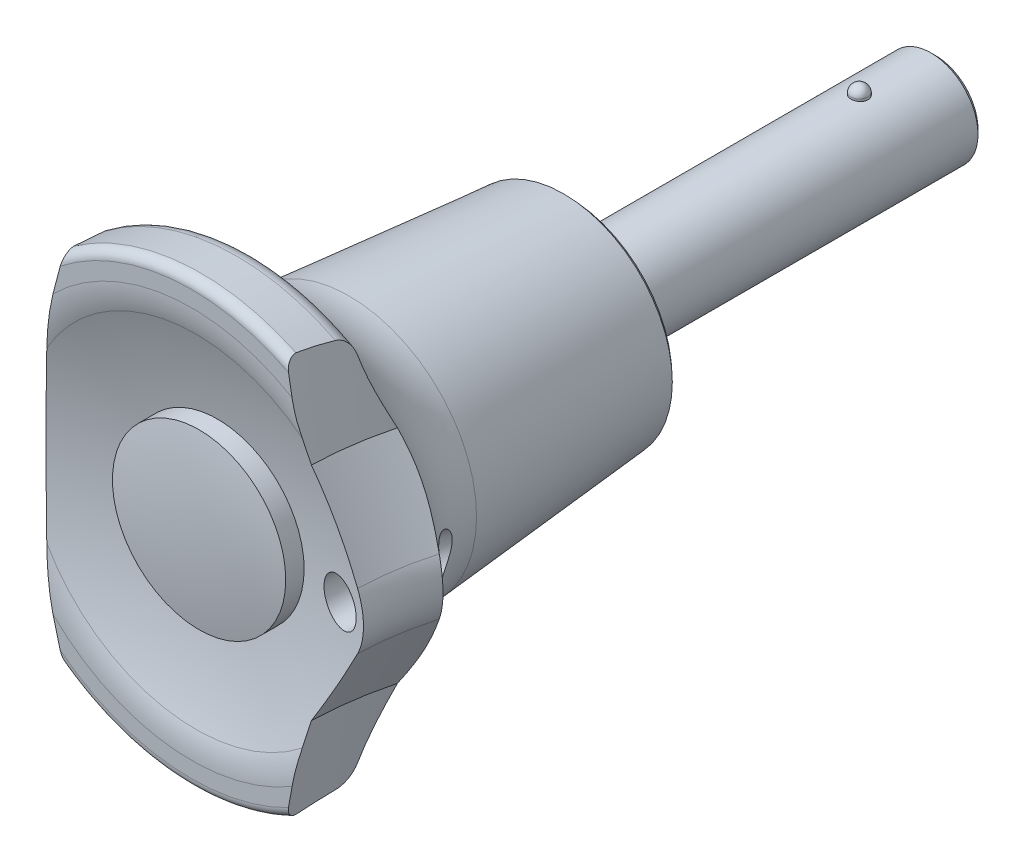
ISO-10303-21;
HEADER;
FILE_DESCRIPTION(('STEP AP214'),'2;1');
FILE_NAME('part.step','',(''),(''),'','','');
FILE_SCHEMA(('AUTOMOTIVE_DESIGN { 1 0 10303 214 1 1 1 1 }'));
ENDSEC;
DATA;
#1=APPLICATION_CONTEXT('core data for automotive mechanical design processes');
#2=APPLICATION_PROTOCOL_DEFINITION('international standard','automotive_design',2000,#1);
#3=PRODUCT_CONTEXT('',#1,'mechanical');
#4=PRODUCT('Part','Part','',(#3));
#5=PRODUCT_RELATED_PRODUCT_CATEGORY('part','',(#4));
#6=PRODUCT_DEFINITION_FORMATION('','',#4);
#7=PRODUCT_DEFINITION_CONTEXT('part definition',#1,'design');
#8=PRODUCT_DEFINITION('design','',#6,#7);
#9=PRODUCT_DEFINITION_SHAPE('','',#8);
#10=(LENGTH_UNIT() NAMED_UNIT(*) SI_UNIT(.MILLI.,.METRE.));
#11=(NAMED_UNIT(*) PLANE_ANGLE_UNIT() SI_UNIT($,.RADIAN.));
#12=(NAMED_UNIT(*) SI_UNIT($,.STERADIAN.) SOLID_ANGLE_UNIT());
#13=UNCERTAINTY_MEASURE_WITH_UNIT(LENGTH_MEASURE(1.E-05),#10,'distance_accuracy_value','');
#14=(GEOMETRIC_REPRESENTATION_CONTEXT(3) GLOBAL_UNCERTAINTY_ASSIGNED_CONTEXT((#13)) GLOBAL_UNIT_ASSIGNED_CONTEXT((#10,
#11,#12)) REPRESENTATION_CONTEXT('',''));
#15=CARTESIAN_POINT('',(0.,0.,0.));
#16=DIRECTION('',(0.,0.,1.));
#17=DIRECTION('',(1.,0.,0.));
#18=AXIS2_PLACEMENT_3D('',#15,#16,#17);
#19=CARTESIAN_POINT('',(0.,-2.65618770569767E-13,-13.3000000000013));
#20=DIRECTION('',(0.235458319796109,0.702179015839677,0.671940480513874));
#21=DIRECTION('',(-0.946090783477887,0.00737532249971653,0.323817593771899));
#22=AXIS2_PLACEMENT_3D('',#19,#20,#21);
#23=SPHERICAL_SURFACE('',#22,53.3000000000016);
#24=CARTESIAN_POINT('',(0.,0.,39.2));
#25=DIRECTION('',(0.,0.,1.));
#26=DIRECTION('',(1.,0.,0.));
#27=AXIS2_PLACEMENT_3D('',#24,#25,#26);
#28=CIRCLE('',#27,9.2);
#29=CARTESIAN_POINT('',(9.2,0.,39.2));
#30=VERTEX_POINT('',#29);
#31=EDGE_CURVE('E580',#30,#30,#28,.F.);
#32=ORIENTED_EDGE('',*,*,#31,.F.);
#33=EDGE_LOOP('',(#32));
#34=FACE_BOUND('',#33,.T.);
#35=ADVANCED_FACE('F14',(#34),#23,.T.);
#36=CARTESIAN_POINT('',(0.,0.,29.6));
#37=DIRECTION('',(0.,0.,1.));
#38=DIRECTION('',(1.,0.,0.));
#39=AXIS2_PLACEMENT_3D('',#36,#37,#38);
#40=CYLINDRICAL_SURFACE('',#39,9.2);
#41=CARTESIAN_POINT('',(9.2,0.,37.2467115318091));
#42=CARTESIAN_POINT('',(9.20000185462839,-0.258477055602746,37.2467115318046));
#43=CARTESIAN_POINT('',(9.18910252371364,-0.516923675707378,37.2467115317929));
#44=CARTESIAN_POINT('',(9.14558128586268,-1.0320661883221,37.2467115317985));
#45=CARTESIAN_POINT('',(9.11295366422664,-1.28876160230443,37.2467115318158));
#46=CARTESIAN_POINT('',(9.02615325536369,-1.79876171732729,37.2467115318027));
#47=CARTESIAN_POINT('',(8.97195747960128,-2.05206250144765,37.2467115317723));
#48=CARTESIAN_POINT('',(8.84240671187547,-2.55319845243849,37.2467115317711));
#49=CARTESIAN_POINT('',(8.76705146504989,-2.80103355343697,37.2467115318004));
#50=CARTESIAN_POINT('',(8.59576047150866,-3.28934916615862,37.2467115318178));
#51=CARTESIAN_POINT('',(8.49983486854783,-3.52983323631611,37.2467115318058));
#52=CARTESIAN_POINT('',(8.28806173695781,-4.00186826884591,37.246711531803));
#53=CARTESIAN_POINT('',(8.17221389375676,-4.23341909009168,37.2467115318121));
#54=CARTESIAN_POINT('',(7.92147515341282,-4.68583944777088,37.2467115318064));
#55=CARTESIAN_POINT('',(7.78659246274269,-4.90671353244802,37.2467115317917));
#56=CARTESIAN_POINT('',(7.49865494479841,-5.33639203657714,37.2467115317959));
#57=CARTESIAN_POINT('',(7.34559384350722,-5.54519225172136,37.2467115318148));
#58=CARTESIAN_POINT('',(7.02243787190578,-5.94913959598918,37.2467115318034));
#59=CARTESIAN_POINT('',(6.85234434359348,-6.14428779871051,37.2467115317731));
#60=CARTESIAN_POINT('',(6.49631888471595,-6.51956588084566,37.246711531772));
#61=CARTESIAN_POINT('',(6.31038662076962,-6.69969544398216,37.2467115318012));
#62=CARTESIAN_POINT('',(5.92400519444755,-7.04365410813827,37.2467115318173));
#63=CARTESIAN_POINT('',(5.72355577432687,-7.20748291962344,37.2467115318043));
#64=CARTESIAN_POINT('',(5.30956347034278,-7.51767513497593,37.2467115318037));
#65=CARTESIAN_POINT('',(5.09602029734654,-7.66403815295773,37.246711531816));
#66=CARTESIAN_POINT('',(4.65736864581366,-7.93825027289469,37.2467115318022));
#67=CARTESIAN_POINT('',(4.43226047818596,-8.06609987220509,37.2467115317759));
#68=CARTESIAN_POINT('',(3.97207525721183,-8.3023802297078,37.2467115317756));
#69=CARTESIAN_POINT('',(3.73699826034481,-8.41081109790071,37.2467115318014));
#70=CARTESIAN_POINT('',(3.25854539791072,-8.60748402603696,37.2467115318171));
#71=CARTESIAN_POINT('',(3.01516953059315,-8.69572608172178,37.2467115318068));
#72=CARTESIAN_POINT('',(2.52184890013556,-8.85139410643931,37.2467115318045));
#73=CARTESIAN_POINT('',(2.27190412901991,-8.91882005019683,37.2467115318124));
#74=CARTESIAN_POINT('',(1.76726641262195,-9.03236657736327,37.2467115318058));
#75=CARTESIAN_POINT('',(1.51257429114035,-9.07849082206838,37.2467115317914));
#76=CARTESIAN_POINT('',(1.00012124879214,-9.14913549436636,37.246711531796));
#77=CARTESIAN_POINT('',(0.742359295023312,-9.17364842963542,37.2467115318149));
#78=CARTESIAN_POINT('',(0.225734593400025,-9.20086637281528,37.2467115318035));
#79=CARTESIAN_POINT('',(-0.0331279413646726,-9.20357542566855,37.2467115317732));
#80=CARTESIAN_POINT('',(-0.550166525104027,-9.1871768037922,37.2467115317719));
#81=CARTESIAN_POINT('',(-0.808342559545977,-9.16806867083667,37.246711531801));
#82=CARTESIAN_POINT('',(-1.32216168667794,-9.10817141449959,37.2467115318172));
#83=CARTESIAN_POINT('',(-1.5778048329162,-9.06738275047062,37.2467115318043));
#84=CARTESIAN_POINT('',(-2.08475193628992,-8.96441355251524,37.2467115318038));
#85=CARTESIAN_POINT('',(-2.33605579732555,-8.90223254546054,37.2467115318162));
#86=CARTESIAN_POINT('',(-2.83253007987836,-8.75692145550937,37.2467115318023));
#87=CARTESIAN_POINT('',(-3.0777005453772,-8.67379152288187,37.246711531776));
#88=CARTESIAN_POINT('',(-3.56016551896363,-8.48717389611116,37.2467115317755));
#89=CARTESIAN_POINT('',(-3.79746007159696,-8.38368631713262,37.2467115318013));
#90=CARTESIAN_POINT('',(-4.26248809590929,-8.15708862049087,37.2467115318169));
#91=CARTESIAN_POINT('',(-4.49022154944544,-8.03397846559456,37.2467115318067));
#92=CARTESIAN_POINT('',(-4.93450813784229,-7.76901081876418,37.2467115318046));
#93=CARTESIAN_POINT('',(-5.15106125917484,-7.62715330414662,37.2467115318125));
#94=CARTESIAN_POINT('',(-5.57141062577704,-7.32572590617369,37.2467115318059));
#95=CARTESIAN_POINT('',(-5.77520908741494,-7.16615911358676,37.2467115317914));
#96=CARTESIAN_POINT('',(-6.16871012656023,-6.83036880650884,37.246711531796));
#97=CARTESIAN_POINT('',(-6.35840779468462,-6.65413953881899,37.2467115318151));
#98=CARTESIAN_POINT('',(-6.72224710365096,-6.28635764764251,37.2467115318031));
#99=CARTESIAN_POINT('',(-6.89639155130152,-6.09480780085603,37.2467115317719));
#100=CARTESIAN_POINT('',(-7.22792754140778,-5.69771568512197,37.2467115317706));
#101=CARTESIAN_POINT('',(-7.38531882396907,-5.49217319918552,37.2467115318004));
#102=CARTESIAN_POINT('',(-7.6822236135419,-5.06856374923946,37.246711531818));
#103=CARTESIAN_POINT('',(-7.82173745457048,-4.85049701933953,37.2467115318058));
#104=CARTESIAN_POINT('',(-8.08190186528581,-4.40338089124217,37.2467115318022));
#105=CARTESIAN_POINT('',(-8.20255201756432,-4.17433125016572,37.246711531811));
#106=CARTESIAN_POINT('',(-8.42410685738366,-3.70692592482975,37.2467115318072));
#107=CARTESIAN_POINT('',(-8.52501522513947,-3.46857198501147,37.2467115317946));
#108=CARTESIAN_POINT('',(-8.70642929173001,-2.98412666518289,37.2467115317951));
#109=CARTESIAN_POINT('',(-8.78692781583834,-2.73803259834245,37.2467115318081));
#110=CARTESIAN_POINT('',(-8.92687528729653,-2.2400372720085,37.2467115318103));
#111=CARTESIAN_POINT('',(-8.98633268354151,-1.98813838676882,37.2467115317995));
#112=CARTESIAN_POINT('',(-9.08384258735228,-1.48011271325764,37.2467115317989));
#113=CARTESIAN_POINT('',(-9.12188538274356,-1.22398406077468,37.2467115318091));
#114=CARTESIAN_POINT('',(-9.17625392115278,-0.709432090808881,37.2467115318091));
#115=CARTESIAN_POINT('',(-9.19257966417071,-0.451008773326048,37.2467115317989));
#116=CARTESIAN_POINT('',(-9.20339556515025,0.0661771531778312,37.2467115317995));
#117=CARTESIAN_POINT('',(-9.19789561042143,0.324939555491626,37.2467115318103));
#118=CARTESIAN_POINT('',(-9.16511481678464,0.8411856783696,37.2467115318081));
#119=CARTESIAN_POINT('',(-9.13782521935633,1.09866884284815,37.2467115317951));
#120=CARTESIAN_POINT('',(-9.06166168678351,1.61033030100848,37.2467115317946));
#121=CARTESIAN_POINT('',(-9.01279532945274,1.864509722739,37.2467115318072));
#122=CARTESIAN_POINT('',(-8.89381622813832,2.36789651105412,37.246711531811));
#123=CARTESIAN_POINT('',(-8.82369952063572,2.61710294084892,37.2467115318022));
#124=CARTESIAN_POINT('',(-8.66272318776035,3.10871759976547,37.2467115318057));
#125=CARTESIAN_POINT('',(-8.57186402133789,3.35112597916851,37.246711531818));
#126=CARTESIAN_POINT('',(-8.37004594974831,3.8274314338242,37.2467115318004));
#127=CARTESIAN_POINT('',(-8.25908666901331,4.06132834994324,37.2467115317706));
#128=CARTESIAN_POINT('',(-8.0178602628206,4.518939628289,37.2467115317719));
#129=CARTESIAN_POINT('',(-7.88759343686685,4.7426541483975,37.2467115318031));
#130=CARTESIAN_POINT('',(-7.60865148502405,5.17835352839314,37.2467115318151));
#131=CARTESIAN_POINT('',(-7.45997303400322,5.39033625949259,37.246711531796));
#132=CARTESIAN_POINT('',(-7.14533841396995,5.80094952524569,37.2467115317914));
#133=CARTESIAN_POINT('',(-6.97938824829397,5.99958466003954,37.2467115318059));
#134=CARTESIAN_POINT('',(-6.63131665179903,6.38220487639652,37.2467115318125));
#135=CARTESIAN_POINT('',(-6.44919240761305,6.5661873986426,37.2467115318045));
#136=CARTESIAN_POINT('',(-6.07009243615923,6.9181556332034,37.2467115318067));
#137=CARTESIAN_POINT('',(-5.87311672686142,7.08614136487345,37.2467115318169));
#138=CARTESIAN_POINT('',(-5.46571438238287,7.40492171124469,37.2467115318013));
#139=CARTESIAN_POINT('',(-5.25528777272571,7.55571635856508,37.2467115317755));
#140=CARTESIAN_POINT('',(-4.82247807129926,7.83904364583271,37.246711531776));
#141=CARTESIAN_POINT('',(-4.60009491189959,7.97157618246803,37.2467115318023));
#142=CARTESIAN_POINT('',(-4.14495258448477,8.21743689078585,37.2467115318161));
#143=CARTESIAN_POINT('',(-3.91219334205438,8.33076492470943,37.2467115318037));
#144=CARTESIAN_POINT('',(-3.43796040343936,8.53740746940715,37.2467115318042));
#145=CARTESIAN_POINT('',(-3.19648690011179,8.63072242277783,37.2467115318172));
#146=CARTESIAN_POINT('',(-2.70653205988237,8.79668034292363,37.246711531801));
#147=CARTESIAN_POINT('',(-2.45805057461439,8.8693228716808,37.2467115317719));
#148=CARTESIAN_POINT('',(-1.95585656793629,8.99341554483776,37.2467115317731));
#149=CARTESIAN_POINT('',(-1.70214415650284,9.04486613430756,37.2467115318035));
#150=CARTESIAN_POINT('',(-1.19123944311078,9.12621890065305,37.2467115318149));
#151=CARTESIAN_POINT('',(-0.934046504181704,9.15611707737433,37.2467115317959));
#152=CARTESIAN_POINT('',(-0.418145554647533,9.19413024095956,37.2467115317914));
#153=CARTESIAN_POINT('',(-0.159438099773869,9.20225277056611,37.2467115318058));
#154=CARTESIAN_POINT('',(0.357786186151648,9.19667812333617,37.2467115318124));
#155=CARTESIAN_POINT('',(0.61630297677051,9.18297719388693,37.2467115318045));
#156=CARTESIAN_POINT('',(1.13126307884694,9.13384602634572,37.2467115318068));
#157=CARTESIAN_POINT('',(1.38770639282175,9.09841581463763,37.246711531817));
#158=CARTESIAN_POINT('',(1.89669667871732,9.00607800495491,37.2467115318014));
#159=CARTESIAN_POINT('',(2.14924365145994,8.94917041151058,37.2467115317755));
#160=CARTESIAN_POINT('',(2.64864726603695,8.81428203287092,37.2467115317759));
#161=CARTESIAN_POINT('',(2.89550387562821,8.73630112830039,37.2467115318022));
#162=CARTESIAN_POINT('',(3.38177681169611,8.55981829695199,37.246711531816));
#163=CARTESIAN_POINT('',(3.62119293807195,8.46131581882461,37.2467115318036));
#164=CARTESIAN_POINT('',(4.09087056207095,8.24449384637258,37.2467115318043));
#165=CARTESIAN_POINT('',(4.3211322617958,8.12617478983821,37.2467115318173));
#166=CARTESIAN_POINT('',(4.77086558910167,7.87056159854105,37.2467115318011));
#167=CARTESIAN_POINT('',(4.99033740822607,7.73326780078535,37.246711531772));
#168=CARTESIAN_POINT('',(5.41693056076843,7.44068268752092,37.2467115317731));
#169=CARTESIAN_POINT('',(5.62405215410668,7.28539175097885,37.2467115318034));
#170=CARTESIAN_POINT('',(6.02449325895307,6.95790104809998,37.2467115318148));
#171=CARTESIAN_POINT('',(6.21781168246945,6.7856999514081,37.2467115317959));
#172=CARTESIAN_POINT('',(6.58918960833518,6.42568596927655,37.2467115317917));
#173=CARTESIAN_POINT('',(6.76725436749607,6.23787850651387,37.2467115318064));
#174=CARTESIAN_POINT('',(7.10700778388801,5.84785067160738,37.246711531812));
#175=CARTESIAN_POINT('',(7.2686893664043,5.64562413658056,37.246711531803));
#176=CARTESIAN_POINT('',(7.57443690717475,5.22827132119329,37.2467115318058));
#177=CARTESIAN_POINT('',(7.71850314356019,5.01314524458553,37.2467115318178));
#178=CARTESIAN_POINT('',(7.98806497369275,4.57141097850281,37.2467115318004));
#179=CARTESIAN_POINT('',(8.11355139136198,4.3447971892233,37.2467115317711));
#180=CARTESIAN_POINT('',(8.34497404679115,3.88180237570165,37.2467115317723));
#181=CARTESIAN_POINT('',(8.45091052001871,3.64542146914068,37.2467115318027));
#182=CARTESIAN_POINT('',(8.64237937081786,3.1648238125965,37.2467115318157));
#183=CARTESIAN_POINT('',(8.72793341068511,2.92061569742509,37.2467115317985));
#184=CARTESIAN_POINT('',(8.87815350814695,2.42594426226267,37.2467115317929));
#185=CARTESIAN_POINT('',(8.94282505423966,2.17548260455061,37.2467115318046));
#186=CARTESIAN_POINT('',(9.06430244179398,1.60704034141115,37.2467115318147));
#187=CARTESIAN_POINT('',(9.11514584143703,1.28776808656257,37.2467115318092));
#188=CARTESIAN_POINT('',(9.18299346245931,0.64564806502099,37.2467115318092));
#189=CARTESIAN_POINT('',(9.19999768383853,0.322800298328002,37.2467115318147));
#190=CARTESIAN_POINT('',(9.2,0.,37.2467115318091));
#191=B_SPLINE_CURVE_WITH_KNOTS('',3,(#41,#42,#43,#44,#45,#46,#47,#48,#49,#50,#51,#52,#53,#54,
#55,#56,#57,#58,#59,#60,#61,#62,#63,#64,#65,#66,#67,#68,#69,#70,#71,#72,#73,#74,#75,#76,#77,#78,
#79,#80,#81,#82,#83,#84,#85,#86,#87,#88,#89,#90,#91,#92,#93,#94,#95,#96,#97,#98,#99,#100,#101,
#102,#103,#104,#105,#106,#107,#108,#109,#110,#111,#112,#113,#114,#115,#116,#117,#118,#119,#120,
#121,#122,#123,#124,#125,#126,#127,#128,#129,#130,#131,#132,#133,#134,#135,#136,#137,#138,#139,
#140,#141,#142,#143,#144,#145,#146,#147,#148,#149,#150,#151,#152,#153,#154,#155,#156,#157,#158,
#159,#160,#161,#162,#163,#164,#165,#166,#167,#168,#169,#170,#171,#172,#173,#174,#175,#176,#177,
#178,#179,#180,#181,#182,#183,#184,#185,#186,#187,#188,#189,#190),.UNSPECIFIED.,.T.,.F.,(4,2,2,
2,2,2,2,2,2,2,2,2,2,2,2,2,2,2,2,2,2,2,2,2,2,2,2,2,2,2,2,2,2,2,2,2,2,2,2,2,2,2,2,2,2,2,2,2,2,2,2,
2,2,2,2,2,2,2,2,2,2,2,2,2,2,2,2,2,2,2,2,2,2,2,4),(0.,0.775149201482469,1.55050235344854,
2.3266841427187,3.10287528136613,3.87868453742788,4.65450604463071,5.42999408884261,
6.20575056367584,6.98144596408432,7.75715769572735,8.53288320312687,9.30862584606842,
10.0843476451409,10.8600650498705,11.6357826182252,12.4115011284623,13.1870862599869,
13.9629401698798,14.738650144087,15.5143764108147,16.2900862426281,17.0658132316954,
17.8415346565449,18.6172516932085,19.3929702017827,20.1686896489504,20.9442739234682,
21.720126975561,22.4958397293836,23.2715645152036,24.0472748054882,24.8230022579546,
25.5985849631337,26.3744399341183,27.1499830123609,27.9258775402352,28.7017720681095,
29.4773151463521,30.2531701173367,31.0287528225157,31.8044802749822,32.5801905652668,
33.3559153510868,34.1316281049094,34.9074811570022,35.6830654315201,36.4587848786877,
37.234503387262,38.0102204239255,38.7859418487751,39.5616688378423,40.3373786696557,
41.1131049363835,41.8888149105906,42.6646688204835,43.4402539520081,44.2159724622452,
44.9916900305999,45.7674074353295,46.543129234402,47.3188718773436,48.0945973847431,
48.8703091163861,49.6460045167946,50.4217609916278,51.1972490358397,51.9730705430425,
52.7488797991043,53.5250709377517,54.3012527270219,55.0766058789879,55.8517550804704,
56.8198038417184,57.7878526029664),.UNSPECIFIED.);
#192=CARTESIAN_POINT('',(9.2,0.,37.2467115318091));
#193=VERTEX_POINT('',#192);
#194=EDGE_CURVE('E585',#193,#193,#191,.T.);
#195=ORIENTED_EDGE('',*,*,#194,.F.);
#196=EDGE_LOOP('',(#195));
#197=FACE_BOUND('',#196,.T.);
#198=ORIENTED_EDGE('',*,*,#31,.T.);
#199=EDGE_LOOP('',(#198));
#200=FACE_BOUND('',#199,.T.);
#201=ADVANCED_FACE('F198',(#197,#200),#40,.T.);
#202=CARTESIAN_POINT('',(0.,2.25,-39.));
#203=DIRECTION('',(0.,0.,-1.));
#204=DIRECTION('',(-1.,0.,0.));
#205=AXIS2_PLACEMENT_3D('',#202,#203,#204);
#206=PLANE('',#205);
#207=CARTESIAN_POINT('',(0.,0.,-38.9999999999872));
#208=DIRECTION('',(0.,0.,1.));
#209=DIRECTION('',(1.,0.,0.));
#210=AXIS2_PLACEMENT_3D('',#207,#208,#209);
#211=CIRCLE('',#210,4.50000000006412);
#212=CARTESIAN_POINT('',(4.50000000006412,0.,-38.9999999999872));
#213=VERTEX_POINT('',#212);
#214=EDGE_CURVE('E568',#213,#213,#211,.T.);
#215=ORIENTED_EDGE('',*,*,#214,.F.);
#216=EDGE_LOOP('',(#215));
#217=FACE_BOUND('',#216,.T.);
#218=ADVANCED_FACE('F510',(#217),#206,.T.);
#219=CARTESIAN_POINT('',(0.,-5.095,-30.9));
#220=DIRECTION('',(0.576433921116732,0.806973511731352,0.12852114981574));
#221=DIRECTION('',(-0.804456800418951,0.532813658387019,0.262600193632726));
#222=AXIS2_PLACEMENT_3D('',#219,#220,#221);
#223=SPHERICAL_SURFACE('',#222,0.905000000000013);
#224=CARTESIAN_POINT('',(-0.52167269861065,-5.82531102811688,-31.0163116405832));
#225=VERTEX_POINT('',#224);
#226=VERTEX_LOOP('',#225);
#227=FACE_BOUND('',#226,.T.);
#228=CARTESIAN_POINT('',(0.,-5.1900000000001,-30.9));
#229=DIRECTION('',(0.,1.,0.));
#230=DIRECTION('',(0.,0.,1.));
#231=AXIS2_PLACEMENT_3D('',#228,#229,#230);
#232=CIRCLE('',#231,0.9);
#233=CARTESIAN_POINT('',(0.,-5.1900000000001,-30.));
#234=VERTEX_POINT('',#233);
#235=EDGE_CURVE('E571',#234,#234,#232,.T.);
#236=ORIENTED_EDGE('',*,*,#235,.F.);
#237=EDGE_LOOP('',(#236));
#238=FACE_BOUND('',#237,.T.);
#239=ADVANCED_FACE('F512',(#227,#238),#223,.T.);
#240=CARTESIAN_POINT('',(0.,5.095,-30.9));
#241=DIRECTION('',(0.576433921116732,0.806973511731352,0.12852114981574));
#242=DIRECTION('',(-0.804456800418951,0.532813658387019,0.262600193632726));
#243=AXIS2_PLACEMENT_3D('',#240,#241,#242);
#244=SPHERICAL_SURFACE('',#243,0.905);
#245=CARTESIAN_POINT('',(0.521672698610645,5.82531102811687,-30.7836883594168));
#246=VERTEX_POINT('',#245);
#247=VERTEX_LOOP('',#246);
#248=FACE_BOUND('',#247,.T.);
#249=CARTESIAN_POINT('',(0.,5.19,-30.9));
#250=DIRECTION('',(0.,1.,0.));
#251=DIRECTION('',(0.,0.,1.));
#252=AXIS2_PLACEMENT_3D('',#249,#250,#251);
#253=CIRCLE('',#252,0.9);
#254=CARTESIAN_POINT('',(0.,5.19,-30.));
#255=VERTEX_POINT('',#254);
#256=EDGE_CURVE('E573',#255,#255,#253,.F.);
#257=ORIENTED_EDGE('',*,*,#256,.F.);
#258=EDGE_LOOP('',(#257));
#259=FACE_BOUND('',#258,.T.);
#260=ADVANCED_FACE('F328',(#248,#259),#244,.T.);
#261=CARTESIAN_POINT('',(0.,0.,-38.5000000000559));
#262=DIRECTION('',(0.,0.,1.));
#263=DIRECTION('',(1.,0.,0.));
#264=AXIS2_PLACEMENT_3D('',#261,#262,#263);
#265=CONICAL_SURFACE('',#264,4.99999999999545,0.785398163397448);
#266=ORIENTED_EDGE('',*,*,#214,.T.);
#267=EDGE_LOOP('',(#266));
#268=FACE_BOUND('',#267,.T.);
#269=CARTESIAN_POINT('',(0.,0.,-38.5));
#270=DIRECTION('',(0.,0.,1.));
#271=DIRECTION('',(1.,0.,0.));
#272=AXIS2_PLACEMENT_3D('',#269,#270,#271);
#273=CIRCLE('',#272,5.);
#274=CARTESIAN_POINT('',(5.,0.,-38.5));
#275=VERTEX_POINT('',#274);
#276=EDGE_CURVE('E530',#275,#275,#273,.T.);
#277=ORIENTED_EDGE('',*,*,#276,.F.);
#278=EDGE_LOOP('',(#277));
#279=FACE_BOUND('',#278,.T.);
#280=ADVANCED_FACE('F556',(#268,#279),#265,.T.);
#281=CARTESIAN_POINT('',(0.,0.,-30.9));
#282=DIRECTION('',(0.,1.,0.));
#283=DIRECTION('',(0.,0.,1.));
#284=AXIS2_PLACEMENT_3D('',#281,#282,#283);
#285=CYLINDRICAL_SURFACE('',#284,0.9);
#286=ORIENTED_EDGE('',*,*,#235,.T.);
#287=EDGE_LOOP('',(#286));
#288=FACE_BOUND('',#287,.T.);
#289=CARTESIAN_POINT('',(0.,-5.,-30.));
#290=CARTESIAN_POINT('',(0.0500692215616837,-4.99999896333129,-30.0000023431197));
#291=CARTESIAN_POINT('',(0.10020166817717,-4.99923945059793,-30.0041960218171));
#292=CARTESIAN_POINT('',(0.19909493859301,-4.99628062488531,-30.0208612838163));
#293=CARTESIAN_POINT('',(0.247852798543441,-4.99407841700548,-30.0333495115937));
#294=CARTESIAN_POINT('',(0.342494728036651,-4.98848086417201,-30.0662123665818));
#295=CARTESIAN_POINT('',(0.388382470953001,-4.98508708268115,-30.0865766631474));
#296=CARTESIAN_POINT('',(0.476071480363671,-4.97747881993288,-30.1345885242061));
#297=CARTESIAN_POINT('',(0.517874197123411,-4.97326463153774,-30.1622334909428));
#298=CARTESIAN_POINT('',(0.596694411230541,-4.96442810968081,-30.2243532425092));
#299=CARTESIAN_POINT('',(0.633659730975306,-4.95980210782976,-30.2588937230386));
#300=CARTESIAN_POINT('',(0.701305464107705,-4.95069071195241,-30.3336842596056));
#301=CARTESIAN_POINT('',(0.731985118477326,-4.94620533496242,-30.3739350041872));
#302=CARTESIAN_POINT('',(0.786397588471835,-4.93784818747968,-30.4593623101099));
#303=CARTESIAN_POINT('',(0.810078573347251,-4.93398108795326,-30.5045723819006));
#304=CARTESIAN_POINT('',(0.849489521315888,-4.92734913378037,-30.5984098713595));
#305=CARTESIAN_POINT('',(0.865220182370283,-4.92458418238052,-30.6470369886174));
#306=CARTESIAN_POINT('',(0.888119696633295,-4.92050592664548,-30.7457780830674));
#307=CARTESIAN_POINT('',(0.895378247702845,-4.9191774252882,-30.7958706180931));
#308=CARTESIAN_POINT('',(0.901405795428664,-4.91807661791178,-30.8965789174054));
#309=CARTESIAN_POINT('',(0.90017547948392,-4.91830418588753,-30.9471946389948));
#310=CARTESIAN_POINT('',(0.889333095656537,-4.92027595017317,-31.0468657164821));
#311=CARTESIAN_POINT('',(0.879822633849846,-4.92200176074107,-31.095932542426));
#312=CARTESIAN_POINT('',(0.852849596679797,-4.92674673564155,-31.1917629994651));
#313=CARTESIAN_POINT('',(0.835386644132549,-4.92976596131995,-31.2385265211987));
#314=CARTESIAN_POINT('',(0.792902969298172,-4.93677714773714,-31.328723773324));
#315=CARTESIAN_POINT('',(0.767840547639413,-4.94077445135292,-31.3721374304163));
#316=CARTESIAN_POINT('',(0.710900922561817,-4.94928741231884,-31.4541781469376));
#317=CARTESIAN_POINT('',(0.679023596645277,-4.95380307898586,-31.4928051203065));
#318=CARTESIAN_POINT('',(0.608815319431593,-4.96292375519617,-31.5647605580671));
#319=CARTESIAN_POINT('',(0.570398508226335,-4.96752911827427,-31.5980052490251));
#320=CARTESIAN_POINT('',(0.488468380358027,-4.97625290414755,-31.6576049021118));
#321=CARTESIAN_POINT('',(0.444952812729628,-4.98037111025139,-31.6839568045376));
#322=CARTESIAN_POINT('',(0.353964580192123,-4.98766435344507,-31.7290314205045));
#323=CARTESIAN_POINT('',(0.306484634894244,-4.99083760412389,-31.7477397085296));
#324=CARTESIAN_POINT('',(0.209048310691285,-4.99586484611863,-31.7768546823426));
#325=CARTESIAN_POINT('',(0.159097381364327,-4.99772161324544,-31.7872788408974));
#326=CARTESIAN_POINT('',(0.090648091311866,-4.99921111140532,-31.7956083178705));
#327=CARTESIAN_POINT('',(0.0725612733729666,-4.99950630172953,-31.7972538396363));
#328=CARTESIAN_POINT('',(0.0363190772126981,-4.99990093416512,-31.7994501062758));
#329=CARTESIAN_POINT('',(0.018163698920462,-5.00000037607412,-31.8000008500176));
#330=CARTESIAN_POINT('',(-0.0500692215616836,-4.99999896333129,-31.7999976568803));
#331=CARTESIAN_POINT('',(-0.100201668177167,-4.99923945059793,-31.7958039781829));
#332=CARTESIAN_POINT('',(-0.199094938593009,-4.99628062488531,-31.7791387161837));
#333=CARTESIAN_POINT('',(-0.247852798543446,-4.99407841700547,-31.7666504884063));
#334=CARTESIAN_POINT('',(-0.342494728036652,-4.98848086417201,-31.7337876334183));
#335=CARTESIAN_POINT('',(-0.388382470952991,-4.98508708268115,-31.7134233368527));
#336=CARTESIAN_POINT('',(-0.47607148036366,-4.97747881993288,-31.6654114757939));
#337=CARTESIAN_POINT('',(-0.517874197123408,-4.97326463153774,-31.6377665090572));
#338=CARTESIAN_POINT('',(-0.596694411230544,-4.96442810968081,-31.5756467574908));
#339=CARTESIAN_POINT('',(-0.633659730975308,-4.95980210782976,-31.5411062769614));
#340=CARTESIAN_POINT('',(-0.701305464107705,-4.95069071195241,-31.4663157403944));
#341=CARTESIAN_POINT('',(-0.731985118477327,-4.94620533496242,-31.4260649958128));
#342=CARTESIAN_POINT('',(-0.786397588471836,-4.93784818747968,-31.3406376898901));
#343=CARTESIAN_POINT('',(-0.810078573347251,-4.93398108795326,-31.2954276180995));
#344=CARTESIAN_POINT('',(-0.849489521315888,-4.92734913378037,-31.2015901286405));
#345=CARTESIAN_POINT('',(-0.865220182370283,-4.92458418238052,-31.1529630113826));
#346=CARTESIAN_POINT('',(-0.888119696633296,-4.92050592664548,-31.0542219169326));
#347=CARTESIAN_POINT('',(-0.895378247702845,-4.9191774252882,-31.0041293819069));
#348=CARTESIAN_POINT('',(-0.901405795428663,-4.91807661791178,-30.9034210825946));
#349=CARTESIAN_POINT('',(-0.90017547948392,-4.91830418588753,-30.8528053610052));
#350=CARTESIAN_POINT('',(-0.889333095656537,-4.92027595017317,-30.7531342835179));
#351=CARTESIAN_POINT('',(-0.879822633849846,-4.92200176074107,-30.704067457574));
#352=CARTESIAN_POINT('',(-0.852849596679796,-4.92674673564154,-30.6082370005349));
#353=CARTESIAN_POINT('',(-0.835386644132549,-4.92976596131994,-30.5614734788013));
#354=CARTESIAN_POINT('',(-0.792902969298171,-4.93677714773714,-30.471276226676));
#355=CARTESIAN_POINT('',(-0.767840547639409,-4.94077445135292,-30.4278625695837));
#356=CARTESIAN_POINT('',(-0.71090092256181,-4.94928741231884,-30.3458218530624));
#357=CARTESIAN_POINT('',(-0.679023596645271,-4.95380307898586,-30.3071948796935));
#358=CARTESIAN_POINT('',(-0.60881531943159,-4.96292375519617,-30.2352394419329));
#359=CARTESIAN_POINT('',(-0.570398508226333,-4.96752911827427,-30.2019947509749));
#360=CARTESIAN_POINT('',(-0.488468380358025,-4.97625290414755,-30.1423950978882));
#361=CARTESIAN_POINT('',(-0.444952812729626,-4.98037111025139,-30.1160431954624));
#362=CARTESIAN_POINT('',(-0.353964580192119,-4.98766435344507,-30.0709685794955));
#363=CARTESIAN_POINT('',(-0.306484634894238,-4.99083760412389,-30.0522602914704));
#364=CARTESIAN_POINT('',(-0.209048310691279,-4.99586484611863,-30.0231453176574));
#365=CARTESIAN_POINT('',(-0.159097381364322,-4.99772161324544,-30.0127211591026));
#366=CARTESIAN_POINT('',(-0.0906480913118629,-4.99921111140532,-30.0043916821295));
#367=CARTESIAN_POINT('',(-0.0725612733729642,-4.99950630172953,-30.0027461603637));
#368=CARTESIAN_POINT('',(-0.0363190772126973,-4.99990093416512,-30.0005498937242));
#369=CARTESIAN_POINT('',(-0.0181636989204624,-5.00000037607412,-29.9999991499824));
#370=CARTESIAN_POINT('',(0.,-5.,-30.));
#371=B_SPLINE_CURVE_WITH_KNOTS('',3,(#289,#290,#291,#292,#293,#294,#295,#296,#297,#298,#299,
#300,#301,#302,#303,#304,#305,#306,#307,#308,#309,#310,#311,#312,#313,#314,#315,#316,#317,#318,
#319,#320,#321,#322,#323,#324,#325,#326,#327,#328,#329,#330,#331,#332,#333,#334,#335,#336,#337,
#338,#339,#340,#341,#342,#343,#344,#345,#346,#347,#348,#349,#350,#351,#352,#353,#354,#355,#356,
#357,#358,#359,#360,#361,#362,#363,#364,#365,#366,#367,#368,#369,#370),.UNSPECIFIED.,.T.,.F.,(4,
2,2,2,2,2,2,2,2,2,2,2,2,2,2,2,2,2,2,2,2,2,2,2,2,2,2,2,2,2,2,2,2,2,2,2,2,2,2,2,4),(0.,
0.150138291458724,0.300578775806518,0.45082260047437,0.601012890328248,0.752708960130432,
0.904423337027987,1.05723463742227,1.21003252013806,1.36119755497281,1.51235034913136,
1.6616740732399,1.81100488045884,1.96117038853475,2.11133859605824,2.26365669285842,
2.41604228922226,2.56871416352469,2.72106316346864,2.77552903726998,2.82999496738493,
2.98013325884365,3.13057374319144,3.2808175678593,3.43100785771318,3.58270392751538,
3.73441830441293,3.88722960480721,4.04002748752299,4.19119252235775,4.3423453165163,
4.49166904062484,4.64099984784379,4.7911653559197,4.94133356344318,5.09365166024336,
5.2460372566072,5.39870913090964,5.55105813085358,5.60552400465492,5.65998993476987),.UNSPECIFIED.);
#372=CARTESIAN_POINT('',(0.,-5.,-30.));
#373=VERTEX_POINT('',#372);
#374=EDGE_CURVE('E534',#373,#373,#371,.T.);
#375=ORIENTED_EDGE('',*,*,#374,.F.);
#376=EDGE_LOOP('',(#375));
#377=FACE_BOUND('',#376,.T.);
#378=ADVANCED_FACE('F547',(#288,#377),#285,.T.);
#379=CARTESIAN_POINT('',(0.,0.,-30.9));
#380=DIRECTION('',(0.,1.,0.));
#381=DIRECTION('',(0.,0.,1.));
#382=AXIS2_PLACEMENT_3D('',#379,#380,#381);
#383=CYLINDRICAL_SURFACE('',#382,0.9);
#384=CARTESIAN_POINT('',(0.,5.,-31.8));
#385=CARTESIAN_POINT('',(0.0501124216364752,4.99999901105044,-31.7999978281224));
#386=CARTESIAN_POINT('',(0.100255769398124,4.99923870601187,-31.7957998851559));
#387=CARTESIAN_POINT('',(0.199137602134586,4.99627847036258,-31.7791264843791));
#388=CARTESIAN_POINT('',(0.247874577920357,4.99407704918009,-31.7666424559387));
#389=CARTESIAN_POINT('',(0.342490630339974,4.9884811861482,-31.7337895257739));
#390=CARTESIAN_POINT('',(0.38837233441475,4.98508786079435,-31.7134280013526));
#391=CARTESIAN_POINT('',(0.476061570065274,4.97747978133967,-31.6654177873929));
#392=CARTESIAN_POINT('',(0.517869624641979,4.97326513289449,-31.6377700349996));
#393=CARTESIAN_POINT('',(0.59669541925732,4.9644280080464,-31.5756460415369));
#394=CARTESIAN_POINT('',(0.633661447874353,4.95980189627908,-31.5411046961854));
#395=CARTESIAN_POINT('',(0.701306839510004,4.95069050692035,-31.4663139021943));
#396=CARTESIAN_POINT('',(0.731985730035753,4.94620523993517,-31.4260640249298));
#397=CARTESIAN_POINT('',(0.786397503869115,4.93784820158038,-31.3406378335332));
#398=CARTESIAN_POINT('',(0.810078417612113,4.93398111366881,-31.2954279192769));
#399=CARTESIAN_POINT('',(0.849489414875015,4.92734915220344,-31.2015904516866));
#400=CARTESIAN_POINT('',(0.865220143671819,4.92458418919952,-31.1529631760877));
#401=CARTESIAN_POINT('',(0.888119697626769,4.92050592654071,-31.0542219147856));
#402=CARTESIAN_POINT('',(0.895378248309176,4.91917742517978,-31.0041293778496));
#403=CARTESIAN_POINT('',(0.901405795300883,4.91807661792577,-30.9034210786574));
#404=CARTESIAN_POINT('',(0.900175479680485,4.91830418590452,-30.8528053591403));
#405=CARTESIAN_POINT('',(0.889333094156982,4.92027595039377,-30.7531342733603));
#406=CARTESIAN_POINT('',(0.879822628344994,4.92200176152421,-30.7040674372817));
#407=CARTESIAN_POINT('',(0.852849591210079,4.92674673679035,-30.608236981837));
#408=CARTESIAN_POINT('',(0.835386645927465,4.92976596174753,-30.5614734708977));
#409=CARTESIAN_POINT('',(0.79290296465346,4.93677714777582,-30.4712762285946));
#410=CARTESIAN_POINT('',(0.767840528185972,4.94077445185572,-30.4278625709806));
#411=CARTESIAN_POINT('',(0.710900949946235,4.94928741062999,-30.3458218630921));
#412=CARTESIAN_POINT('',(0.6790236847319,4.9538030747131,-30.3071948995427));
#413=CARTESIAN_POINT('',(0.608815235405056,4.96292375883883,-30.2352394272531));
#414=CARTESIAN_POINT('',(0.570398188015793,4.96752913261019,-30.2019946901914));
#415=CARTESIAN_POINT('',(0.488468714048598,4.97625288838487,-30.1423951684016));
#416=CARTESIAN_POINT('',(0.444954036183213,4.98037105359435,-30.1160434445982));
#417=CARTESIAN_POINT('',(0.353963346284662,4.98766441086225,-30.0709683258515));
#418=CARTESIAN_POINT('',(0.306480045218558,4.99083781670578,-30.0522593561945));
#419=CARTESIAN_POINT('',(0.209052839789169,4.99586463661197,-30.0231462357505));
#420=CARTESIAN_POINT('',(0.159114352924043,4.99772082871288,-30.0127246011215));
#421=CARTESIAN_POINT('',(0.0726264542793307,4.99960356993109,-30.0021976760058));
#422=CARTESIAN_POINT('',(0.0363222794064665,5.0000010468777,-29.9999973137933));
#423=CARTESIAN_POINT('',(-0.0500858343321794,4.99999855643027,-30.0000037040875));
#424=CARTESIAN_POINT('',(-0.100206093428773,4.99923934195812,-30.0041963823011));
#425=CARTESIAN_POINT('',(-0.199090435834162,4.99628073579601,-30.0208609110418));
#426=CARTESIAN_POINT('',(-0.247851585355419,4.99407844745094,-30.0333494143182));
#427=CARTESIAN_POINT('',(-0.34249665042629,4.98848079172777,-30.0662127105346));
#428=CARTESIAN_POINT('',(-0.38838420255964,4.98508696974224,-30.0865772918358));
#429=CARTESIAN_POINT('',(-0.476072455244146,4.9774786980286,-30.1345893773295));
#430=CARTESIAN_POINT('',(-0.517874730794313,4.97326456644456,-30.1622340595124));
#431=CARTESIAN_POINT('',(-0.596690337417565,4.96442857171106,-30.2243498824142));
#432=CARTESIAN_POINT('',(-0.633651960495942,4.95980307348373,-30.2588861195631));
#433=CARTESIAN_POINT('',(-0.701299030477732,4.95069165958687,-30.3336761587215));
#434=CARTESIAN_POINT('',(-0.731982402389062,4.94620579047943,-30.3739318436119));
#435=CARTESIAN_POINT('',(-0.78641186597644,4.93784595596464,-30.4593836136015));
#436=CARTESIAN_POINT('',(-0.810103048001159,4.93397693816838,-30.5046151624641));
#437=CARTESIAN_POINT('',(-0.849506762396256,4.9273462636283,-30.5984664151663));
#438=CARTESIAN_POINT('',(-0.86522837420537,4.9245833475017,-30.6470821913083));
#439=CARTESIAN_POINT('',(-0.884453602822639,4.92115841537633,-30.7299635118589));
#440=CARTESIAN_POINT('',(-0.890274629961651,4.92010435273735,-30.7636935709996));
#441=CARTESIAN_POINT('',(-0.898048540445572,4.91869131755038,-30.8316109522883));
#442=CARTESIAN_POINT('',(-0.900001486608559,4.91833233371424,-30.8657982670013));
#443=CARTESIAN_POINT('',(-0.899997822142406,4.91833410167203,-30.9501049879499));
#444=CARTESIAN_POINT('',(-0.895801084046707,4.91910713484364,-31.0002409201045));
#445=CARTESIAN_POINT('',(-0.879132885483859,4.92211278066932,-31.0991073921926));
#446=CARTESIAN_POINT('',(-0.866652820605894,4.92434691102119,-31.1478364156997));
#447=CARTESIAN_POINT('',(-0.833811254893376,4.93001364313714,-31.2424363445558));
#448=CARTESIAN_POINT('',(-0.813457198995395,4.93344511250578,-31.2883099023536));
#449=CARTESIAN_POINT('',(-0.765465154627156,4.94111838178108,-31.3759841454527));
#450=CARTESIAN_POINT('',(-0.737828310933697,4.94536005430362,-31.4177854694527));
#451=CARTESIAN_POINT('',(-0.675719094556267,4.95423002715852,-31.49661301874));
#452=CARTESIAN_POINT('',(-0.641179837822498,4.95886183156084,-31.5335861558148));
#453=CARTESIAN_POINT('',(-0.566380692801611,4.9679602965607,-31.6012537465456));
#454=CARTESIAN_POINT('',(-0.526119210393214,4.9724269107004,-31.6319464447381));
#455=CARTESIAN_POINT('',(-0.440662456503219,4.98073004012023,-31.6863859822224));
#456=CARTESIAN_POINT('',(-0.395432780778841,4.98456163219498,-31.7100795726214));
#457=CARTESIAN_POINT('',(-0.301585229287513,4.99111708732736,-31.7494884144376));
#458=CARTESIAN_POINT('',(-0.252971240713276,4.99384219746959,-31.7652126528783));
#459=CARTESIAN_POINT('',(-0.17008293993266,4.99721806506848,-31.7844450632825));
#460=CARTESIAN_POINT('',(-0.136343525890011,4.99825616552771,-31.7902693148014));
#461=CARTESIAN_POINT('',(-0.068407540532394,4.99964746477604,-31.7980474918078));
#462=CARTESIAN_POINT('',(-0.0342109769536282,5.0000006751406,-31.8000014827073));
#463=CARTESIAN_POINT('',(0.,5.,-31.8));
#464=B_SPLINE_CURVE_WITH_KNOTS('',3,(#384,#385,#386,#387,#388,#389,#390,#391,#392,#393,#394,
#395,#396,#397,#398,#399,#400,#401,#402,#403,#404,#405,#406,#407,#408,#409,#410,#411,#412,#413,
#414,#415,#416,#417,#418,#419,#420,#421,#422,#423,#424,#425,#426,#427,#428,#429,#430,#431,#432,
#433,#434,#435,#436,#437,#438,#439,#440,#441,#442,#443,#444,#445,#446,#447,#448,#449,#450,#451,
#452,#453,#454,#455,#456,#457,#458,#459,#460,#461,#462,#463),.UNSPECIFIED.,.T.,.F.,(4,2,2,2,2,2,
2,2,2,2,2,2,2,2,2,2,2,2,2,2,2,2,2,2,2,2,2,2,2,2,2,2,2,2,2,2,2,2,2,4),(0.,0.150211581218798,
0.30057877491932,0.450805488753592,0.601012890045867,0.752712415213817,0.904423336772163,
1.05723413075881,1.210032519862,1.36119756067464,1.51235034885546,1.66167410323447,
1.81100488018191,1.96117037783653,2.11133859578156,2.26365668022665,2.41604228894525,
2.56871420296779,2.72106316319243,2.82994351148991,2.98008175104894,3.13052228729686,
3.2807684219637,3.43095640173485,3.58263659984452,3.73436684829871,3.88725873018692,
4.03997603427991,4.14249708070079,4.24501646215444,4.39520570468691,4.54555120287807,
4.69575489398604,4.84593498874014,4.99764780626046,5.14940297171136,5.30228458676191,
5.45499341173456,5.55754227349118,5.66008940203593),.UNSPECIFIED.);
#465=CARTESIAN_POINT('',(0.,5.,-31.8));
#466=VERTEX_POINT('',#465);
#467=EDGE_CURVE('E542',#466,#466,#464,.T.);
#468=ORIENTED_EDGE('',*,*,#467,.F.);
#469=EDGE_LOOP('',(#468));
#470=FACE_BOUND('',#469,.T.);
#471=ORIENTED_EDGE('',*,*,#256,.T.);
#472=EDGE_LOOP('',(#471));
#473=FACE_BOUND('',#472,.T.);
#474=ADVANCED_FACE('F524',(#470,#473),#383,.T.);
#475=CARTESIAN_POINT('',(0.,0.,-9.25));
#476=DIRECTION('',(0.,0.,1.));
#477=DIRECTION('',(1.,0.,0.));
#478=AXIS2_PLACEMENT_3D('',#475,#476,#477);
#479=CYLINDRICAL_SURFACE('',#478,5.);
#480=CARTESIAN_POINT('',(0.,0.,0.));
#481=DIRECTION('',(0.,0.,-1.));
#482=DIRECTION('',(-1.,0.,0.));
#483=AXIS2_PLACEMENT_3D('',#480,#481,#482);
#484=CIRCLE('',#483,5.);
#485=CARTESIAN_POINT('',(-5.,0.,0.));
#486=VERTEX_POINT('',#485);
#487=EDGE_CURVE('E535',#486,#486,#484,.F.);
#488=ORIENTED_EDGE('',*,*,#487,.F.);
#489=EDGE_LOOP('',(#488));
#490=FACE_BOUND('',#489,.T.);
#491=ORIENTED_EDGE('',*,*,#467,.T.);
#492=EDGE_LOOP('',(#491));
#493=FACE_BOUND('',#492,.T.);
#494=ORIENTED_EDGE('',*,*,#374,.T.);
#495=EDGE_LOOP('',(#494));
#496=FACE_BOUND('',#495,.T.);
#497=ORIENTED_EDGE('',*,*,#276,.T.);
#498=EDGE_LOOP('',(#497));
#499=FACE_BOUND('',#498,.T.);
#500=ADVANCED_FACE('F550',(#490,#493,#496,#499),#479,.T.);
#501=CARTESIAN_POINT('',(0.,5.5,0.));
#502=DIRECTION('',(0.,0.,-1.));
#503=DIRECTION('',(-1.,0.,0.));
#504=AXIS2_PLACEMENT_3D('',#501,#502,#503);
#505=PLANE('',#504);
#506=ORIENTED_EDGE('',*,*,#487,.T.);
#507=EDGE_LOOP('',(#506));
#508=FACE_BOUND('',#507,.T.);
#509=CARTESIAN_POINT('',(0.,0.,0.));
#510=DIRECTION('',(0.,0.,1.));
#511=DIRECTION('',(1.,0.,0.));
#512=AXIS2_PLACEMENT_3D('',#509,#510,#511);
#513=CIRCLE('',#512,11.);
#514=CARTESIAN_POINT('',(11.,0.,0.));
#515=VERTEX_POINT('',#514);
#516=EDGE_CURVE('E9',#515,#515,#513,.T.);
#517=ORIENTED_EDGE('',*,*,#516,.F.);
#518=EDGE_LOOP('',(#517));
#519=FACE_BOUND('',#518,.T.);
#520=ADVANCED_FACE('F16',(#508,#519),#505,.T.);
#521=CARTESIAN_POINT('',(0.,0.,0.498097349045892));
#522=DIRECTION('',(0.,0.,1.));
#523=DIRECTION('',(1.,0.,0.));
#524=AXIS2_PLACEMENT_3D('',#521,#522,#523);
#525=CONICAL_SURFACE('',#524,11.5435778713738,0.829031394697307);
#526=CARTESIAN_POINT('',(0.,0.,0.498097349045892));
#527=DIRECTION('',(0.,0.,1.));
#528=DIRECTION('',(0.,1.,0.));
#529=AXIS2_PLACEMENT_3D('',#526,#527,#528);
#530=CIRCLE('',#529,11.5435778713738);
#531=CARTESIAN_POINT('',(0.,11.5435778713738,0.498097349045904));
#532=VERTEX_POINT('',#531);
#533=EDGE_CURVE('E412',#532,#532,#530,.T.);
#534=ORIENTED_EDGE('',*,*,#533,.F.);
#535=EDGE_LOOP('',(#534));
#536=FACE_BOUND('',#535,.T.);
#537=ORIENTED_EDGE('',*,*,#516,.T.);
#538=EDGE_LOOP('',(#537));
#539=FACE_BOUND('',#538,.T.);
#540=ADVANCED_FACE('F433',(#536,#539),#525,.T.);
#541=CARTESIAN_POINT('',(0.,0.,23.274079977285));
#542=DIRECTION('',(0.,0.,1.));
#543=DIRECTION('',(1.,0.,0.));
#544=AXIS2_PLACEMENT_3D('',#541,#542,#543);
#545=CONICAL_SURFACE('',#544,13.5362181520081,0.0872664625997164);
#546=CARTESIAN_POINT('',(0.,0.,23.274079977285));
#547=DIRECTION('',(0.,0.,1.));
#548=DIRECTION('',(1.,0.,0.));
#549=AXIS2_PLACEMENT_3D('',#546,#547,#548);
#550=CIRCLE('',#549,13.5362181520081);
#551=CARTESIAN_POINT('',(13.5362181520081,0.,23.274079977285));
#552=VERTEX_POINT('',#551);
#553=EDGE_CURVE('E373',#552,#552,#550,.T.);
#554=ORIENTED_EDGE('',*,*,#553,.F.);
#555=EDGE_LOOP('',(#554));
#556=FACE_BOUND('',#555,.T.);
#557=ORIENTED_EDGE('',*,*,#533,.T.);
#558=EDGE_LOOP('',(#557));
#559=FACE_BOUND('',#558,.T.);
#560=ADVANCED_FACE('F326',(#556,#559),#545,.T.);
#561=CARTESIAN_POINT('',(0.,0.,22.25));
#562=DIRECTION('',(0.,0.,1.));
#563=DIRECTION('',(1.,0.,0.));
#564=AXIS2_PLACEMENT_3D('',#561,#562,#563);
#565=TOROIDAL_SURFACE('',#564,25.2415058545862,11.75);
#566=CARTESIAN_POINT('',(12.9058571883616,-11.75,31.0482392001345));
#567=CARTESIAN_POINT('',(12.840210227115,-11.9770448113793,31.140586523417));
#568=CARTESIAN_POINT('',(12.7749820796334,-12.2040717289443,31.233279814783));
#569=CARTESIAN_POINT('',(12.6455401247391,-12.658334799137,31.4183533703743));
#570=CARTESIAN_POINT('',(12.581325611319,-12.8855706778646,31.5107338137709));
#571=CARTESIAN_POINT('',(12.4540382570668,-13.3406595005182,31.6942467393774));
#572=CARTESIAN_POINT('',(12.3909646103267,-13.5685118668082,31.7853800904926));
#573=CARTESIAN_POINT('',(12.2660387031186,-14.0252034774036,31.9655205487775));
#574=CARTESIAN_POINT('',(12.2041856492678,-14.2540419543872,32.0545290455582));
#575=CARTESIAN_POINT('',(12.0817503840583,-14.7130513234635,32.2295825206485));
#576=CARTESIAN_POINT('',(12.0211675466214,-14.9432214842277,32.3156289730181));
#577=CARTESIAN_POINT('',(11.9012297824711,-15.4054591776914,32.4840510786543));
#578=CARTESIAN_POINT('',(11.8418759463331,-15.6375281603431,32.5664235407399));
#579=CARTESIAN_POINT('',(11.724476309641,-16.1035578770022,32.7266138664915));
#580=CARTESIAN_POINT('',(11.6664304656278,-16.3375185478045,32.804431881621));
#581=CARTESIAN_POINT('',(11.5516386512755,-16.8075564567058,32.9547644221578));
#582=CARTESIAN_POINT('',(11.4948931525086,-17.0436344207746,33.0272770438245));
#583=CARTESIAN_POINT('',(11.3826786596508,-17.5181246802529,33.1662757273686));
#584=CARTESIAN_POINT('',(11.3272109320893,-17.756538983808,33.2327559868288));
#585=CARTESIAN_POINT('',(11.2175204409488,-18.2358944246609,33.3589908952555));
#586=CARTESIAN_POINT('',(11.1633000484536,-18.4768392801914,33.4187334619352));
#587=CARTESIAN_POINT('',(11.1097575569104,-18.7188355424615,33.4746771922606));
#588=B_SPLINE_CURVE_WITH_KNOTS('',3,(#566,#567,#568,#569,#570,#571,#572,#573,#574,#575,#576,
#577,#578,#579,#580,#581,#582,#583,#584,#585,#586,#587),.UNSPECIFIED.,.F.,.F.,(4,2,2,2,2,2,2,2,
2,2,4),(0.,0.761239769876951,1.5219235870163,2.2820472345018,3.04165934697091,3.80088780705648,
4.56076336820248,5.32061364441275,6.08073525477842,6.84158042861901,7.60376898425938),.UNSPECIFIED.);
#589=CARTESIAN_POINT('',(12.9058571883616,-11.75,31.0482392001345));
#590=VERTEX_POINT('',#589);
#591=CARTESIAN_POINT('',(11.1097575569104,-18.7188355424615,33.4746771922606));
#592=VERTEX_POINT('',#591);
#593=EDGE_CURVE('E401',#590,#592,#588,.T.);
#594=ORIENTED_EDGE('',*,*,#593,.T.);
#595=CARTESIAN_POINT('',(0.,0.,33.4746771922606));
#596=DIRECTION('',(0.,0.,1.));
#597=DIRECTION('',(1.,0.,0.));
#598=AXIS2_PLACEMENT_3D('',#595,#596,#597);
#599=CIRCLE('',#598,21.767441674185);
#600=CARTESIAN_POINT('',(-15.158887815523,-15.6214479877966,33.4746771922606));
#601=VERTEX_POINT('',#600);
#602=EDGE_CURVE('E340',#592,#601,#599,.F.);
#603=ORIENTED_EDGE('',*,*,#602,.T.);
#604=CARTESIAN_POINT('',(-15.158887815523,-15.6214479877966,33.4746771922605));
#605=CARTESIAN_POINT('',(-15.2716875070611,-15.2349904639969,33.4131707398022));
#606=CARTESIAN_POINT('',(-15.3817142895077,-14.8483655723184,33.3478206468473));
#607=CARTESIAN_POINT('',(-15.5965869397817,-14.072552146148,33.2110359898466));
#608=CARTESIAN_POINT('',(-15.7014033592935,-13.6833606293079,33.1395719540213));
#609=CARTESIAN_POINT('',(-15.9054653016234,-12.9025905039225,32.9925406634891));
#610=CARTESIAN_POINT('',(-16.0046869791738,-12.5110085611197,32.916958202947));
#611=CARTESIAN_POINT('',(-16.197058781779,-11.7255568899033,32.7638202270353));
#612=CARTESIAN_POINT('',(-16.2901914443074,-11.3316838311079,32.6862598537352));
#613=CARTESIAN_POINT('',(-16.4697910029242,-10.5417168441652,32.531376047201));
#614=CARTESIAN_POINT('',(-16.5562475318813,-10.1456204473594,32.4540531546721));
#615=CARTESIAN_POINT('',(-16.7218040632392,-9.35124334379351,32.3018798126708));
#616=CARTESIAN_POINT('',(-16.8009011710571,-8.95296184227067,32.2270303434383));
#617=CARTESIAN_POINT('',(-16.948817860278,-8.16569358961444,32.084073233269));
#618=CARTESIAN_POINT('',(-17.0178701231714,-7.77677506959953,32.0158325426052));
#619=CARTESIAN_POINT('',(-17.1475532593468,-6.99696949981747,31.8856570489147));
#620=CARTESIAN_POINT('',(-17.208194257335,-6.60608541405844,31.8237146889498));
#621=CARTESIAN_POINT('',(-17.3202959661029,-5.82242786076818,31.7078756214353));
#622=CARTESIAN_POINT('',(-17.3717706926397,-5.42965823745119,31.6539666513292));
#623=CARTESIAN_POINT('',(-17.4648160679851,-4.64234344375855,31.5557147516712));
#624=CARTESIAN_POINT('',(-17.5064013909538,-4.24780180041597,31.5113576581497));
#625=CARTESIAN_POINT('',(-17.5790211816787,-3.45709781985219,31.4334693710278));
#626=CARTESIAN_POINT('',(-17.6100669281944,-3.06093767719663,31.3999266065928));
#627=CARTESIAN_POINT('',(-17.6610812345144,-2.26721496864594,31.3446288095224));
#628=CARTESIAN_POINT('',(-17.6810535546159,-1.86965292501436,31.3228697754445));
#629=CARTESIAN_POINT('',(-17.712985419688,-0.976999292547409,31.2880391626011));
#630=CARTESIAN_POINT('',(-17.7218239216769,-0.48165449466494,31.278357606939));
#631=CARTESIAN_POINT('',(-17.7214943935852,0.509723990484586,31.2787173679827));
#632=CARTESIAN_POINT('',(-17.7123004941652,1.0057576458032,31.288787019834));
#633=CARTESIAN_POINT('',(-17.6761333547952,1.99697984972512,31.328235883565));
#634=CARTESIAN_POINT('',(-17.6491390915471,2.49216670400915,31.3576379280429));
#635=CARTESIAN_POINT('',(-17.5781593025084,3.48023633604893,31.4343913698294));
#636=CARTESIAN_POINT('',(-17.5341620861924,3.97311729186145,31.4817551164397));
#637=CARTESIAN_POINT('',(-17.4304352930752,4.9552055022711,31.5921906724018));
#638=CARTESIAN_POINT('',(-17.3707121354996,5.44441417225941,31.6552560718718));
#639=CARTESIAN_POINT('',(-17.2367093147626,6.42094212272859,31.7945338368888));
#640=CARTESIAN_POINT('',(-17.1623724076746,6.9082460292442,31.8707977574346));
#641=CARTESIAN_POINT('',(-17.0008540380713,7.87870362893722,32.0328968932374));
#642=CARTESIAN_POINT('',(-16.9136820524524,8.36186010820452,32.1187250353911));
#643=CARTESIAN_POINT('',(-16.7278385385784,9.32474224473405,32.2963664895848));
#644=CARTESIAN_POINT('',(-16.6291688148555,9.80446842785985,32.3881788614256));
#645=CARTESIAN_POINT('',(-16.4214654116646,10.7611974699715,32.5740441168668));
#646=CARTESIAN_POINT('',(-16.3124321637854,11.2382004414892,32.6680969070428));
#647=CARTESIAN_POINT('',(-16.0848841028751,12.19015939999,32.854655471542));
#648=CARTESIAN_POINT('',(-15.9663709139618,12.6651157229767,32.947161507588));
#649=CARTESIAN_POINT('',(-15.8075268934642,13.2778107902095,33.0632722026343));
#650=CARTESIAN_POINT('',(-15.7712663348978,13.4161575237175,33.0892773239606));
#651=CARTESIAN_POINT('',(-15.6979997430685,13.6927406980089,33.1407489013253));
#652=CARTESIAN_POINT('',(-15.660993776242,13.8309771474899,33.1662154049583));
#653=CARTESIAN_POINT('',(-15.5862452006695,14.1073574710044,33.2165209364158));
#654=CARTESIAN_POINT('',(-15.5485026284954,14.2455013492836,33.2413599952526));
#655=CARTESIAN_POINT('',(-15.4724196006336,14.5212340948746,33.2902382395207));
#656=CARTESIAN_POINT('',(-15.4340816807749,14.658823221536,33.314279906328));
#657=CARTESIAN_POINT('',(-15.3566854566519,14.9339436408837,33.3615679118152));
#658=CARTESIAN_POINT('',(-15.3176271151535,15.0714749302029,33.3848142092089));
#659=CARTESIAN_POINT('',(-15.2387930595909,15.3464953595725,33.4304274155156));
#660=CARTESIAN_POINT('',(-15.1990172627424,15.483984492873,33.4527942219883));
#661=CARTESIAN_POINT('',(-15.1588878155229,15.6214479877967,33.4746771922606));
#662=B_SPLINE_CURVE_WITH_KNOTS('',3,(#604,#605,#606,#607,#608,#609,#610,#611,#612,#613,#614,
#615,#616,#617,#618,#619,#620,#621,#622,#623,#624,#625,#626,#627,#628,#629,#630,#631,#632,#633,
#634,#635,#636,#637,#638,#639,#640,#641,#642,#643,#644,#645,#646,#647,#648,#649,#650,#651,#652,
#653,#654,#655,#656,#657,#658,#659,#660,#661),.UNSPECIFIED.,.F.,.F.,(4,2,2,2,2,2,2,2,2,2,2,2,2,
2,2,2,2,2,2,2,2,2,2,2,2,2,2,2,4),(0.,1.22169561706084,2.4496536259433,3.6825013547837,
4.91874228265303,6.15686585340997,7.39547435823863,8.59791131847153,9.79888809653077,
10.9980124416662,12.1953462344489,13.3913946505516,14.5870366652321,16.0728547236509,
17.5608059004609,19.0505175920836,20.5412553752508,22.0313855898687,23.5274735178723,
25.0224622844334,26.5172167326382,28.0119089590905,29.5063456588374,29.942438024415,
30.3784916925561,30.8145237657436,31.2490394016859,31.6835775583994,32.1181661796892),.UNSPECIFIED.);
#663=CARTESIAN_POINT('',(-15.1588878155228,15.6214479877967,33.4746771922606));
#664=VERTEX_POINT('',#663);
#665=EDGE_CURVE('E375',#601,#664,#662,.T.);
#666=ORIENTED_EDGE('',*,*,#665,.T.);
#667=CARTESIAN_POINT('',(0.,0.,33.4746771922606));
#668=DIRECTION('',(0.,0.,1.));
#669=DIRECTION('',(1.,0.,0.));
#670=AXIS2_PLACEMENT_3D('',#667,#668,#669);
#671=CIRCLE('',#670,21.767441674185);
#672=CARTESIAN_POINT('',(11.1097575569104,18.7188355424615,33.4746771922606));
#673=VERTEX_POINT('',#672);
#674=EDGE_CURVE('E376',#664,#673,#671,.F.);
#675=ORIENTED_EDGE('',*,*,#674,.T.);
#676=CARTESIAN_POINT('',(11.1097575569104,18.7188355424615,33.4746771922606));
#677=CARTESIAN_POINT('',(11.1633000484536,18.4768392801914,33.4187334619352));
#678=CARTESIAN_POINT('',(11.2175204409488,18.2358944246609,33.3589908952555));
#679=CARTESIAN_POINT('',(11.3272109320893,17.756538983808,33.2327559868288));
#680=CARTESIAN_POINT('',(11.3826786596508,17.5181246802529,33.1662757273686));
#681=CARTESIAN_POINT('',(11.4948931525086,17.0436344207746,33.0272770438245));
#682=CARTESIAN_POINT('',(11.5516386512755,16.8075564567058,32.9547644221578));
#683=CARTESIAN_POINT('',(11.6664304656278,16.3375185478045,32.804431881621));
#684=CARTESIAN_POINT('',(11.724476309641,16.1035578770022,32.7266138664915));
#685=CARTESIAN_POINT('',(11.8418759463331,15.6375281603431,32.5664235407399));
#686=CARTESIAN_POINT('',(11.9012297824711,15.4054591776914,32.4840510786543));
#687=CARTESIAN_POINT('',(12.0211675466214,14.9432214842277,32.3156289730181));
#688=CARTESIAN_POINT('',(12.0817503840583,14.7130513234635,32.2295825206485));
#689=CARTESIAN_POINT('',(12.2041856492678,14.2540419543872,32.0545290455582));
#690=CARTESIAN_POINT('',(12.2660387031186,14.0252034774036,31.9655205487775));
#691=CARTESIAN_POINT('',(12.3909646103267,13.5685118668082,31.7853800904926));
#692=CARTESIAN_POINT('',(12.4540382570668,13.3406595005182,31.6942467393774));
#693=CARTESIAN_POINT('',(12.581325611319,12.8855706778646,31.5107338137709));
#694=CARTESIAN_POINT('',(12.6455401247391,12.658334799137,31.4183533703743));
#695=CARTESIAN_POINT('',(12.7749820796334,12.2040717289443,31.233279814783));
#696=CARTESIAN_POINT('',(12.840210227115,11.9770448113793,31.140586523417));
#697=CARTESIAN_POINT('',(12.9058571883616,11.75,31.0482392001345));
#698=B_SPLINE_CURVE_WITH_KNOTS('',3,(#676,#677,#678,#679,#680,#681,#682,#683,#684,#685,#686,
#687,#688,#689,#690,#691,#692,#693,#694,#695,#696,#697),.UNSPECIFIED.,.F.,.F.,(4,2,2,2,2,2,2,2,
2,2,4),(0.,0.762188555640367,1.52303372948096,2.28315533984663,3.0430056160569,3.8028811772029,
4.56210963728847,5.32172174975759,6.08184539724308,6.84252921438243,7.60376898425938),.UNSPECIFIED.);
#699=CARTESIAN_POINT('',(12.9058571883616,11.75,31.0482392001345));
#700=VERTEX_POINT('',#699);
#701=EDGE_CURVE('E308',#673,#700,#698,.T.);
#702=ORIENTED_EDGE('',*,*,#701,.T.);
#703=CARTESIAN_POINT('',(12.9058571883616,11.75,31.0482392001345));
#704=CARTESIAN_POINT('',(12.9925342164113,11.6151801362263,31.0246278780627));
#705=CARTESIAN_POINT('',(13.0791104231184,11.4800458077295,31.0024539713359));
#706=CARTESIAN_POINT('',(13.2519946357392,11.2091338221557,30.9611469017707));
#707=CARTESIAN_POINT('',(13.3383026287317,11.0733561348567,30.9420138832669));
#708=CARTESIAN_POINT('',(13.5964737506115,10.6654322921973,30.8894767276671));
#709=CARTESIAN_POINT('',(13.7678242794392,10.3923223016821,30.8608682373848));
#710=CARTESIAN_POINT('',(14.1083473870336,9.84402903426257,30.8174327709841));
#711=CARTESIAN_POINT('',(14.2775219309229,9.56884804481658,30.8025923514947));
#712=CARTESIAN_POINT('',(14.613238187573,9.01661978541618,30.7870898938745));
#713=CARTESIAN_POINT('',(14.7797808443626,8.73957323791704,30.7864226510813));
#714=CARTESIAN_POINT('',(15.1077193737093,8.18759180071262,30.7990809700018));
#715=CARTESIAN_POINT('',(15.2691539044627,7.91267565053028,30.8122264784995));
#716=CARTESIAN_POINT('',(15.588838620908,7.36188913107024,30.8516570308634));
#717=CARTESIAN_POINT('',(15.7470883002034,7.08601861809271,30.8779441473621));
#718=CARTESIAN_POINT('',(16.0603261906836,6.53381522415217,30.9426671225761));
#719=CARTESIAN_POINT('',(16.2153139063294,6.25748227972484,30.9811048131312));
#720=CARTESIAN_POINT('',(16.5220852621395,5.70486708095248,31.0687995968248));
#721=CARTESIAN_POINT('',(16.6738697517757,5.42858483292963,31.1180537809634));
#722=CARTESIAN_POINT('',(16.8893041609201,5.03289251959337,31.1952845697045));
#723=CARTESIAN_POINT('',(16.9541247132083,4.91336624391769,31.2194889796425));
#724=CARTESIAN_POINT('',(17.0832470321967,4.67440422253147,31.2694996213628));
#725=CARTESIAN_POINT('',(17.147548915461,4.55496846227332,31.2953054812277));
#726=CARTESIAN_POINT('',(17.2756776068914,4.31618446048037,31.348386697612));
#727=CARTESIAN_POINT('',(17.3395044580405,4.19683621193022,31.3756619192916));
#728=CARTESIAN_POINT('',(17.4670162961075,3.95768374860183,31.43167323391));
#729=CARTESIAN_POINT('',(17.5306993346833,3.83787991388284,31.4604153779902));
#730=CARTESIAN_POINT('',(17.657679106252,3.59835181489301,31.519108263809));
#731=CARTESIAN_POINT('',(17.7209758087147,3.47862755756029,31.5490590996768));
#732=CARTESIAN_POINT('',(17.8472301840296,3.2392541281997,31.6100300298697));
#733=CARTESIAN_POINT('',(17.9101878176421,3.1196049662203,31.641050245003));
#734=CARTESIAN_POINT('',(17.972994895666,3.,31.6725331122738));
#735=B_SPLINE_CURVE_WITH_KNOTS('',3,(#703,#704,#705,#706,#707,#708,#709,#710,#711,#712,#713,
#714,#715,#716,#717,#718,#719,#720,#721,#722,#723,#724,#725,#726,#727,#728,#729,#730,#731,#732,
#733,#734),.UNSPECIFIED.,.F.,.F.,(4,2,2,2,2,2,2,2,2,2,2,2,2,2,2,4),(0.,0.486013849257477,
0.972050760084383,1.94277960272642,2.91255960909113,3.88198348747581,4.83892558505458,
5.79601865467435,6.75325608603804,7.7102363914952,8.12455617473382,8.53878009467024,
8.95296606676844,9.36902594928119,9.78511829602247,10.20125780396),.UNSPECIFIED.);
#736=CARTESIAN_POINT('',(17.972994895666,3.,31.6725331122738));
#737=VERTEX_POINT('',#736);
#738=EDGE_CURVE('E299',#700,#737,#735,.T.);
#739=ORIENTED_EDGE('',*,*,#738,.T.);
#740=CARTESIAN_POINT('',(17.972994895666,3.,31.6725331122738));
#741=CARTESIAN_POINT('',(18.0484406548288,2.85638256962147,31.7103304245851));
#742=CARTESIAN_POINT('',(18.1187109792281,2.70917028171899,31.7447562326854));
#743=CARTESIAN_POINT('',(18.2482352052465,2.40867531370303,31.8071509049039));
#744=CARTESIAN_POINT('',(18.3074903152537,2.25539330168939,31.8351204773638));
#745=CARTESIAN_POINT('',(18.4142665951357,1.94404685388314,31.8848648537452));
#746=CARTESIAN_POINT('',(18.4618027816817,1.78598883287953,31.9066475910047));
#747=CARTESIAN_POINT('',(18.544760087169,1.46603555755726,31.9442917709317));
#748=CARTESIAN_POINT('',(18.580181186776,1.30414029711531,31.9601532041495));
#749=CARTESIAN_POINT('',(18.6385523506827,0.977648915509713,31.9861280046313));
#750=CARTESIAN_POINT('',(18.661501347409,0.81305256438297,31.9962408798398));
#751=CARTESIAN_POINT('',(18.6946972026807,0.482332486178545,32.0108282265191));
#752=CARTESIAN_POINT('',(18.7049437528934,0.316208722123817,32.0153025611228));
#753=CARTESIAN_POINT('',(18.7126348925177,-0.0164823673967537,32.0186633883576));
#754=CARTESIAN_POINT('',(18.710072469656,-0.183049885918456,32.0175468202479));
#755=CARTESIAN_POINT('',(18.6921550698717,-0.515356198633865,32.0097063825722));
#756=CARTESIAN_POINT('',(18.6768006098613,-0.681095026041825,32.0029827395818));
#757=CARTESIAN_POINT('',(18.6333461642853,-1.01138037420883,31.9838071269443));
#758=CARTESIAN_POINT('',(18.6051846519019,-1.17591719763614,31.971327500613));
#759=CARTESIAN_POINT('',(18.5363818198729,-1.50179650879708,31.9404927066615));
#760=CARTESIAN_POINT('',(18.4957409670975,-1.66313911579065,31.9221377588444));
#761=CARTESIAN_POINT('',(18.4024876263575,-1.98116729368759,31.879396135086));
#762=CARTESIAN_POINT('',(18.3498976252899,-2.13786099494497,31.8550207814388));
#763=CARTESIAN_POINT('',(18.2332729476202,-2.44570784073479,31.7999777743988));
#764=CARTESIAN_POINT('',(18.1692456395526,-2.59686447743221,31.7693141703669));
#765=CARTESIAN_POINT('',(18.0796096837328,-2.78783957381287,31.725454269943));
#766=CARTESIAN_POINT('',(18.0588991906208,-2.83070825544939,31.7152636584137));
#767=CARTESIAN_POINT('',(18.0166031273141,-2.91581785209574,31.6943225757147));
#768=CARTESIAN_POINT('',(17.9950184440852,-2.95805934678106,31.6835726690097));
#769=CARTESIAN_POINT('',(17.972994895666,-3.,31.6725331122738));
#770=B_SPLINE_CURVE_WITH_KNOTS('',3,(#740,#741,#742,#743,#744,#745,#746,#747,#748,#749,#750,
#751,#752,#753,#754,#755,#756,#757,#758,#759,#760,#761,#762,#763,#764,#765,#766,#767,#768,#769),
.UNSPECIFIED.,.F.,.F.,(4,2,2,2,2,2,2,2,2,2,2,2,2,2,4),(0.,0.499554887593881,0.999054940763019,
1.49791156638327,1.99676898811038,2.49566910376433,2.99458132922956,3.49376671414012,
3.99293192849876,4.49452095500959,4.99609121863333,5.49672529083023,5.99703798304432,
6.14309116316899,6.28899969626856),.UNSPECIFIED.);
#771=CARTESIAN_POINT('',(17.972994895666,-3.,31.6725331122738));
#772=VERTEX_POINT('',#771);
#773=EDGE_CURVE('E309',#737,#772,#770,.T.);
#774=ORIENTED_EDGE('',*,*,#773,.T.);
#775=CARTESIAN_POINT('',(17.972994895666,-3.,31.6725331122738));
#776=CARTESIAN_POINT('',(17.8435226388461,-3.24655938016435,31.6076285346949));
#777=CARTESIAN_POINT('',(17.7133989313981,-3.49332473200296,31.5446926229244));
#778=CARTESIAN_POINT('',(17.4520691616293,-3.98611685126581,31.4242564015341));
#779=CARTESIAN_POINT('',(17.3208705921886,-4.23214195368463,31.3667329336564));
#780=CARTESIAN_POINT('',(17.057014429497,-4.72347721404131,31.2582448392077));
#781=CARTESIAN_POINT('',(16.9243653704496,-4.96878598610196,31.2072534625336));
#782=CARTESIAN_POINT('',(16.6572729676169,-5.45869538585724,31.112873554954));
#783=CARTESIAN_POINT('',(16.5228380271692,-5.70329529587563,31.0694577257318));
#784=CARTESIAN_POINT('',(16.2518792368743,-6.19180147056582,30.9911722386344));
#785=CARTESIAN_POINT('',(16.1153623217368,-6.43570775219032,30.9562788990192));
#786=CARTESIAN_POINT('',(15.8400026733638,-6.9228453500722,30.8958536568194));
#787=CARTESIAN_POINT('',(15.7011641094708,-7.16607711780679,30.8703065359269));
#788=CARTESIAN_POINT('',(15.4206972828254,-7.6524056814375,30.8291897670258));
#789=CARTESIAN_POINT('',(15.2790641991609,-7.89550133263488,30.8136392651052));
#790=CARTESIAN_POINT('',(14.993318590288,-8.38088564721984,30.7930871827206));
#791=CARTESIAN_POINT('',(14.8492045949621,-8.62317372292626,30.788092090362));
#792=CARTESIAN_POINT('',(14.5585309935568,-9.10694457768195,30.7888888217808));
#793=CARTESIAN_POINT('',(14.4119669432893,-9.34842465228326,30.7947029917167));
#794=CARTESIAN_POINT('',(14.1164957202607,-9.83063211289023,30.817111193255));
#795=CARTESIAN_POINT('',(13.967582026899,-10.0713536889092,30.8337438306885));
#796=CARTESIAN_POINT('',(13.6675713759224,-10.5521560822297,30.8775338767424));
#797=CARTESIAN_POINT('',(13.5164672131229,-10.7922276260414,30.9047436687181));
#798=CARTESIAN_POINT('',(13.2885801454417,-11.1515873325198,30.9530175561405));
#799=CARTESIAN_POINT('',(13.2121736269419,-11.2716205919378,30.9704177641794));
#800=CARTESIAN_POINT('',(13.0591567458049,-11.5111845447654,31.0075836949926));
#801=CARTESIAN_POINT('',(12.9825463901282,-11.6307152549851,31.0273493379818));
#802=CARTESIAN_POINT('',(12.9058571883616,-11.75,31.0482392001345));
#803=B_SPLINE_CURVE_WITH_KNOTS('',3,(#775,#776,#777,#778,#779,#780,#781,#782,#783,#784,#785,
#786,#787,#788,#789,#790,#791,#792,#793,#794,#795,#796,#797,#798,#799,#800,#801,#802),
.UNSPECIFIED.,.F.,.F.,(4,2,2,2,2,2,2,2,2,2,2,2,2,4),(0.,0.857880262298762,1.71190490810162,
2.56231204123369,3.4095884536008,4.25448301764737,5.09799566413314,5.94311907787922,
6.78876181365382,7.63615470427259,8.48658824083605,9.34128833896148,9.77131557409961,
10.2013283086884),.UNSPECIFIED.);
#804=EDGE_CURVE('E400',#772,#590,#803,.T.);
#805=ORIENTED_EDGE('',*,*,#804,.T.);
#806=EDGE_LOOP('',(#594,#603,#666,#675,#702,#739,#774,#805));
#807=FACE_BOUND('',#806,.T.);
#808=ORIENTED_EDGE('',*,*,#553,.T.);
#809=EDGE_LOOP('',(#808));
#810=FACE_BOUND('',#809,.T.);
#811=CARTESIAN_POINT('',(14.361260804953,0.,26.6865265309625));
#812=CARTESIAN_POINT('',(14.3612607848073,-0.0505876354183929,26.6865264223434));
#813=CARTESIAN_POINT('',(14.3620101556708,-0.101174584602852,26.6890246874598));
#814=CARTESIAN_POINT('',(14.3649941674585,-0.201818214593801,26.6989258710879));
#815=CARTESIAN_POINT('',(14.3672288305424,-0.25187488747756,26.7063288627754));
#816=CARTESIAN_POINT('',(14.373150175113,-0.351032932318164,26.7257955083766));
#817=CARTESIAN_POINT('',(14.3768383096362,-0.400133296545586,26.7378638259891));
#818=CARTESIAN_POINT('',(14.38561368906,-0.496960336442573,26.766284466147));
#819=CARTESIAN_POINT('',(14.3907017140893,-0.544686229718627,26.782639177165));
#820=CARTESIAN_POINT('',(14.4078408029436,-0.684230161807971,26.8370421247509));
#821=CARTESIAN_POINT('',(14.421843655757,-0.773662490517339,26.880693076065));
#822=CARTESIAN_POINT('',(14.4546320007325,-0.944834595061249,26.9794758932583));
#823=CARTESIAN_POINT('',(14.4734198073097,-1.02657062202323,27.0346133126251));
#824=CARTESIAN_POINT('',(14.5111390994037,-1.16628460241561,27.1411924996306));
#825=CARTESIAN_POINT('',(14.5292510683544,-1.22569737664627,27.1910735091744));
#826=CARTESIAN_POINT('',(14.568205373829,-1.33976099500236,27.2950737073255));
#827=CARTESIAN_POINT('',(14.5890490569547,-1.39440946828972,27.3491949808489));
#828=CARTESIAN_POINT('',(14.633445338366,-1.49916922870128,27.4608322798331));
#829=CARTESIAN_POINT('',(14.6570034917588,-1.5492708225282,27.518355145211));
#830=CARTESIAN_POINT('',(14.7067685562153,-1.6449581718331,27.6359622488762));
#831=CARTESIAN_POINT('',(14.7329760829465,-1.69054287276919,27.6960470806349));
#832=CARTESIAN_POINT('',(14.7956296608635,-1.78926705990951,27.835033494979));
#833=CARTESIAN_POINT('',(14.8329049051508,-1.84101814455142,27.9145506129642));
#834=CARTESIAN_POINT('',(14.9117462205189,-1.93740202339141,28.075757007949));
#835=CARTESIAN_POINT('',(14.9533133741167,-1.98203301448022,28.1574468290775));
#836=CARTESIAN_POINT('',(15.040713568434,-2.06409482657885,28.3221376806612));
#837=CARTESIAN_POINT('',(15.0865461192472,-2.10152647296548,28.4051385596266));
#838=CARTESIAN_POINT('',(15.1824494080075,-2.16900430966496,28.5717545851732));
#839=CARTESIAN_POINT('',(15.232522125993,-2.19904702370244,28.6553700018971));
#840=CARTESIAN_POINT('',(15.336915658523,-2.2514649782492,28.8227189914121));
#841=CARTESIAN_POINT('',(15.3912482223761,-2.27381802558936,28.9064522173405));
#842=CARTESIAN_POINT('',(15.5037759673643,-2.3102797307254,29.0730516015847));
#843=CARTESIAN_POINT('',(15.5619688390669,-2.3243932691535,29.1559182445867));
#844=CARTESIAN_POINT('',(15.6818161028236,-2.34385352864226,29.3200307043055));
#845=CARTESIAN_POINT('',(15.7434660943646,-2.34921114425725,29.4012784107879));
#846=CARTESIAN_POINT('',(15.8697152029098,-2.3506276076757,29.5614767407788));
#847=CARTESIAN_POINT('',(15.9343132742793,-2.34668972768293,29.6404281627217));
#848=CARTESIAN_POINT('',(16.0982146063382,-2.32455685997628,29.8335331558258));
#849=CARTESIAN_POINT('',(16.1989412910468,-2.30029532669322,29.9458733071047));
#850=CARTESIAN_POINT('',(16.4019995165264,-2.22818808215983,30.1611213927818));
#851=CARTESIAN_POINT('',(16.5043302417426,-2.18035400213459,30.2640339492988));
#852=CARTESIAN_POINT('',(16.7067180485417,-2.06007658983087,30.4584884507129));
#853=CARTESIAN_POINT('',(16.8067595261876,-1.98749932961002,30.5499647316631));
#854=CARTESIAN_POINT('',(16.9985420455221,-1.81851199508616,30.7185276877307));
#855=CARTESIAN_POINT('',(17.0902870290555,-1.72211332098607,30.7956212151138));
#856=CARTESIAN_POINT('',(17.2513792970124,-1.51873164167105,30.9267322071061));
#857=CARTESIAN_POINT('',(17.3220509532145,-1.41378639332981,30.9822902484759));
#858=CARTESIAN_POINT('',(17.4485354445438,-1.18941552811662,31.0795500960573));
#859=CARTESIAN_POINT('',(17.5043463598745,-1.06998804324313,31.1212501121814));
#860=CARTESIAN_POINT('',(17.5951824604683,-0.828215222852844,31.1881255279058));
#861=CARTESIAN_POINT('',(17.6312799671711,-0.706507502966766,31.2141636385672));
#862=CARTESIAN_POINT('',(17.6859847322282,-0.457430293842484,31.2533443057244));
#863=CARTESIAN_POINT('',(17.7046354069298,-0.330075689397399,31.2665188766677));
#864=CARTESIAN_POINT('',(17.7166662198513,-0.168338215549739,31.275011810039));
#865=CARTESIAN_POINT('',(17.7185378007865,-0.134715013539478,31.276332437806));
#866=CARTESIAN_POINT('',(17.7210361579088,-0.0673989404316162,31.2780941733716));
#867=CARTESIAN_POINT('',(17.7216629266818,-0.0337060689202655,31.2785352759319));
#868=CARTESIAN_POINT('',(17.721656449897,0.125807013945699,31.2785333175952));
#869=CARTESIAN_POINT('',(17.7129005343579,0.251797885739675,31.2723808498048));
#870=CARTESIAN_POINT('',(17.6782186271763,0.500352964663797,31.2477726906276));
#871=CARTESIAN_POINT('',(17.6522538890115,0.622908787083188,31.2292892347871));
#872=CARTESIAN_POINT('',(17.5843427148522,0.860778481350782,31.1801472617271));
#873=CARTESIAN_POINT('',(17.5424179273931,0.976101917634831,31.1495052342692));
#874=CARTESIAN_POINT('',(17.4445014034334,1.19644721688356,31.0763260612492));
#875=CARTESIAN_POINT('',(17.3885169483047,1.30147437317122,31.0337950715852));
#876=CARTESIAN_POINT('',(17.2643024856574,1.49971340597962,30.9367781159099));
#877=CARTESIAN_POINT('',(17.1959475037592,1.59278638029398,30.8821687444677));
#878=CARTESIAN_POINT('',(17.0504237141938,1.76372607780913,30.7620212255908));
#879=CARTESIAN_POINT('',(16.9732532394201,1.84158991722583,30.6964810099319));
#880=CARTESIAN_POINT('',(16.8101161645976,1.98361277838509,30.5527050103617));
#881=CARTESIAN_POINT('',(16.7239214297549,2.04710082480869,30.4740669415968));
#882=CARTESIAN_POINT('',(16.5489648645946,2.15575197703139,30.3075812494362));
#883=CARTESIAN_POINT('',(16.4602023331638,2.20091002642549,30.2197310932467));
#884=CARTESIAN_POINT('',(16.2760319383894,2.27612864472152,30.029073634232));
#885=CARTESIAN_POINT('',(16.1806663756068,2.30467525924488,29.9256313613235));
#886=CARTESIAN_POINT('',(15.9936100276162,2.34187337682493,29.7121159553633));
#887=CARTESIAN_POINT('',(15.9019208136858,2.35051646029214,29.6020400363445));
#888=CARTESIAN_POINT('',(15.7128910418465,2.34936584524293,29.3627999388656));
#889=CARTESIAN_POINT('',(15.6163592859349,2.3370362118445,29.2330113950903));
#890=CARTESIAN_POINT('',(15.432717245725,2.2911906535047,28.9705691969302));
#891=CARTESIAN_POINT('',(15.3456137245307,2.25765963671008,28.8379135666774));
#892=CARTESIAN_POINT('',(15.1688289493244,2.16437422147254,28.5514260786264));
#893=CARTESIAN_POINT('',(15.0809166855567,2.10131245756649,28.3975615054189));
#894=CARTESIAN_POINT('',(14.9599612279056,1.98852420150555,28.17013033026));
#895=CARTESIAN_POINT('',(14.9214366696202,1.94785801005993,28.0948254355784));
#896=CARTESIAN_POINT('',(14.8480228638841,1.86048633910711,27.945991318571));
#897=CARTESIAN_POINT('',(14.8131329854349,1.81378191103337,27.8724617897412));
#898=CARTESIAN_POINT('',(14.7236659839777,1.67919025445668,27.676908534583));
#899=CARTESIAN_POINT('',(14.6725206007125,1.5854574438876,27.5571865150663));
#900=CARTESIAN_POINT('',(14.6039115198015,1.43113067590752,27.3871045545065));
#901=CARTESIAN_POINT('',(14.5824017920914,1.37742985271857,27.3320184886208));
#902=CARTESIAN_POINT('',(14.5421065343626,1.26525375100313,27.2258680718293));
#903=CARTESIAN_POINT('',(14.5233198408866,1.20678052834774,27.1748020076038));
#904=CARTESIAN_POINT('',(14.4825704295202,1.0639457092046,27.0610811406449));
#905=CARTESIAN_POINT('',(14.4617361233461,0.977594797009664,27.0004775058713));
#906=CARTESIAN_POINT('',(14.4255164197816,0.796015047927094,26.8920565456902));
#907=CARTESIAN_POINT('',(14.4101262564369,0.70079406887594,26.8442280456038));
#908=CARTESIAN_POINT('',(14.3917697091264,0.554218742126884,26.7860572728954));
#909=CARTESIAN_POINT('',(14.3864988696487,0.505715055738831,26.7691358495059));
#910=CARTESIAN_POINT('',(14.3774066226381,0.407263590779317,26.7397175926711));
#911=CARTESIAN_POINT('',(14.3735843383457,0.357316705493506,26.7272180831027));
#912=CARTESIAN_POINT('',(14.3674473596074,0.256419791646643,26.7070515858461));
#913=CARTESIAN_POINT('',(14.3651309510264,0.205470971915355,26.6993791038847));
#914=CARTESIAN_POINT('',(14.3620377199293,0.103014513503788,26.6891167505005));
#915=CARTESIAN_POINT('',(14.3612608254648,0.0515069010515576,26.6865266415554));
#916=CARTESIAN_POINT('',(14.361260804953,0.,26.6865265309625));
#917=B_SPLINE_CURVE_WITH_KNOTS('',3,(#811,#812,#813,#814,#815,#816,#817,#818,#819,#820,#821,
#822,#823,#824,#825,#826,#827,#828,#829,#830,#831,#832,#833,#834,#835,#836,#837,#838,#839,#840,
#841,#842,#843,#844,#845,#846,#847,#848,#849,#850,#851,#852,#853,#854,#855,#856,#857,#858,#859,
#860,#861,#862,#863,#864,#865,#866,#867,#868,#869,#870,#871,#872,#873,#874,#875,#876,#877,#878,
#879,#880,#881,#882,#883,#884,#885,#886,#887,#888,#889,#890,#891,#892,#893,#894,#895,#896,#897,
#898,#899,#900,#901,#902,#903,#904,#905,#906,#907,#908,#909,#910,#911,#912,#913,#914,#915,#916),
.UNSPECIFIED.,.T.,.F.,(4,2,2,2,2,2,2,2,2,2,2,2,2,2,2,2,2,2,2,2,2,2,2,2,2,2,2,2,2,2,2,2,2,2,2,2,
2,2,2,2,2,2,2,2,2,2,2,2,2,2,2,2,4),(0.,0.151695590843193,0.303393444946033,0.455243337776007,
0.607178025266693,0.907268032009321,1.20750346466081,1.44617132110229,1.68495727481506,
1.92424088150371,2.16358022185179,2.46899165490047,2.77448030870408,3.07993391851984,
3.38553096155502,3.69200273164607,3.9982927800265,4.30420143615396,4.61000242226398,
5.06641267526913,5.52259795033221,5.98129269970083,6.43976835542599,6.85216137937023,
7.26460765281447,7.65153745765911,8.03750180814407,8.13858430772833,8.23966740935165,
8.61695742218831,8.99509982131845,9.3727311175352,9.75016724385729,10.1316541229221,
10.5132132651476,10.9100003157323,11.3068967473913,11.7358492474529,12.164983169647,
12.6497610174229,13.1348843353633,13.6966925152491,13.9780207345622,14.2593000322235,
14.7385959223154,14.9780118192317,15.2173251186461,15.5389087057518,15.8602100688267,
16.0149395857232,16.1695753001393,16.3240346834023,16.4784868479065),.UNSPECIFIED.);
#918=CARTESIAN_POINT('',(14.361260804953,0.,26.6865265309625));
#919=VERTEX_POINT('',#918);
#920=EDGE_CURVE('E345',#919,#919,#917,.T.);
#921=ORIENTED_EDGE('',*,*,#920,.T.);
#922=EDGE_LOOP('',(#921));
#923=FACE_BOUND('',#922,.T.);
#924=ADVANCED_FACE('F320',(#807,#810,#923),#565,.F.);
#925=CARTESIAN_POINT('',(0.,0.,35.3852605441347));
#926=DIRECTION('',(0.,0.,1.));
#927=DIRECTION('',(1.,0.,0.));
#928=AXIS2_PLACEMENT_3D('',#925,#926,#927);
#929=TOROIDAL_SURFACE('',#928,21.1761116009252,2.);
#930=CARTESIAN_POINT('',(10.4924614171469,20.6564201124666,35.2109490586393));
#931=CARTESIAN_POINT('',(10.5011199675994,20.6468306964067,35.1579468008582));
#932=CARTESIAN_POINT('',(10.510288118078,20.6346204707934,35.1055315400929));
#933=CARTESIAN_POINT('',(10.5294960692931,20.6053463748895,35.0023077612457));
#934=CARTESIAN_POINT('',(10.5395347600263,20.5882886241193,34.9514973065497));
#935=CARTESIAN_POINT('',(10.5602688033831,20.5498481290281,34.8522112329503));
#936=CARTESIAN_POINT('',(10.5709577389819,20.5285039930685,34.8037192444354));
#937=CARTESIAN_POINT('',(10.5929404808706,20.4817948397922,34.7088553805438));
#938=CARTESIAN_POINT('',(10.6042344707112,20.4564285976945,34.6624841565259));
#939=CARTESIAN_POINT('',(10.6387192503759,20.3751593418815,34.5273301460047));
#940=CARTESIAN_POINT('',(10.6626361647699,20.3138534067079,34.4419255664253));
#941=CARTESIAN_POINT('',(10.7115845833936,20.1796053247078,34.2809886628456));
#942=CARTESIAN_POINT('',(10.736618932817,20.1066320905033,34.2054837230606));
#943=CARTESIAN_POINT('',(10.7990247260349,19.9149245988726,34.0314978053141));
#944=CARTESIAN_POINT('',(10.8366457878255,19.790840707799,33.9389773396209));
#945=CARTESIAN_POINT('',(10.9112507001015,19.5288653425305,33.7758056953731));
#946=CARTESIAN_POINT('',(10.9482335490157,19.3909541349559,33.7051863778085));
#947=CARTESIAN_POINT('',(11.0060334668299,19.1628104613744,33.6091390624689));
#948=CARTESIAN_POINT('',(11.0274165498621,19.0754930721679,33.5769194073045));
#949=CARTESIAN_POINT('',(11.0692740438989,18.8987051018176,33.5201666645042));
#950=CARTESIAN_POINT('',(11.0897526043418,18.8092480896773,33.4955944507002));
#951=CARTESIAN_POINT('',(11.1097575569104,18.7188355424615,33.4746771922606));
#952=B_SPLINE_CURVE_WITH_KNOTS('',3,(#930,#931,#932,#933,#934,#935,#936,#937,#938,#939,#940,
#941,#942,#943,#944,#945,#946,#947,#948,#949,#950,#951),.UNSPECIFIED.,.F.,.F.,(4,2,2,2,2,2,2,2,
2,2,4),(0.,0.163552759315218,0.32689995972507,0.488837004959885,0.65082345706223,
0.972904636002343,1.29585875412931,1.7711395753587,2.24710860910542,2.53329356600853,
2.81798930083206),.UNSPECIFIED.);
#953=CARTESIAN_POINT('',(10.4924614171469,20.6564201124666,35.2109490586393));
#954=VERTEX_POINT('',#953);
#955=EDGE_CURVE('E389',#954,#673,#952,.T.);
#956=ORIENTED_EDGE('',*,*,#955,.T.);
#957=ORIENTED_EDGE('',*,*,#674,.F.);
#958=CARTESIAN_POINT('',(-15.1588878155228,15.6214479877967,33.4746771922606));
#959=CARTESIAN_POINT('',(-15.1279706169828,15.7273536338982,33.4915536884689));
#960=CARTESIAN_POINT('',(-15.0964148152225,15.8327034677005,33.5108857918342));
#961=CARTESIAN_POINT('',(-15.0319348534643,16.0425460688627,33.5549205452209));
#962=CARTESIAN_POINT('',(-14.9990037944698,16.1470302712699,33.5796538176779));
#963=CARTESIAN_POINT('',(-14.9319690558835,16.3543875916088,33.6348236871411));
#964=CARTESIAN_POINT('',(-14.8978629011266,16.4572565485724,33.6652730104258));
#965=CARTESIAN_POINT('',(-14.8280038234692,16.6626489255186,33.7329624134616));
#966=CARTESIAN_POINT('',(-14.7922317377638,16.765126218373,33.7703236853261));
#967=CARTESIAN_POINT('',(-14.7199370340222,16.9667864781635,33.8519742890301));
#968=CARTESIAN_POINT('',(-14.6834159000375,17.0659750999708,33.8962508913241));
#969=CARTESIAN_POINT('',(-14.6098795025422,17.2601849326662,33.9925119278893));
#970=CARTESIAN_POINT('',(-14.5728651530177,17.3552127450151,34.0444835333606));
#971=CARTESIAN_POINT('',(-14.515583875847,17.4978475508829,34.1315240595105));
#972=CARTESIAN_POINT('',(-14.4953606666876,17.5473558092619,34.1635226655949));
#973=CARTESIAN_POINT('',(-14.4549619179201,17.6444855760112,34.2303206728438));
#974=CARTESIAN_POINT('',(-14.4347863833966,17.6921068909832,34.2651203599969));
#975=CARTESIAN_POINT('',(-14.3946416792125,17.7849950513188,34.3376537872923));
#976=CARTESIAN_POINT('',(-14.3746721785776,17.8302663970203,34.3753815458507));
#977=CARTESIAN_POINT('',(-14.3350588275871,17.9180699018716,34.454039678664));
#978=CARTESIAN_POINT('',(-14.3154149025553,17.9606026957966,34.4949693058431));
#979=CARTESIAN_POINT('',(-14.2654136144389,18.0660375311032,34.6049528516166));
#980=CARTESIAN_POINT('',(-14.2354317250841,18.1264911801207,34.6765804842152));
#981=CARTESIAN_POINT('',(-14.1779453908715,18.2358138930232,34.8288878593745));
#982=CARTESIAN_POINT('',(-14.1504311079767,18.284730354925,34.909528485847));
#983=CARTESIAN_POINT('',(-14.1042235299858,18.3591512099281,35.0638231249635));
#984=CARTESIAN_POINT('',(-14.0848398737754,18.3873120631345,35.1360123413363));
#985=CARTESIAN_POINT('',(-14.0673042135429,18.4089758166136,35.2109490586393));
#986=B_SPLINE_CURVE_WITH_KNOTS('',3,(#958,#959,#960,#961,#962,#963,#964,#965,#966,#967,#968,
#969,#970,#971,#972,#973,#974,#975,#976,#977,#978,#979,#980,#981,#982,#983,#984,#985),
.UNSPECIFIED.,.F.,.F.,(4,2,2,2,2,2,2,2,2,2,2,2,2,4),(0.,0.334829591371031,0.671609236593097,
1.00914778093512,1.35328946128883,1.69680496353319,2.03975408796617,2.22664314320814,
2.41355130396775,2.60008721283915,2.78657972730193,3.08094446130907,3.37407793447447,
3.61301515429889),.UNSPECIFIED.);
#987=CARTESIAN_POINT('',(-14.0673042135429,18.4089758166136,35.2109490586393));
#988=VERTEX_POINT('',#987);
#989=EDGE_CURVE('E469',#664,#988,#986,.T.);
#990=ORIENTED_EDGE('',*,*,#989,.T.);
#991=CARTESIAN_POINT('',(0.,0.,35.2109490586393));
#992=DIRECTION('',(0.,0.,1.));
#993=DIRECTION('',(1.,0.,0.));
#994=AXIS2_PLACEMENT_3D('',#991,#992,#993);
#995=CIRCLE('',#994,23.1685009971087);
#996=EDGE_CURVE('E466',#988,#954,#995,.F.);
#997=ORIENTED_EDGE('',*,*,#996,.T.);
#998=EDGE_LOOP('',(#956,#957,#990,#997));
#999=FACE_BOUND('',#998,.T.);
#1000=ADVANCED_FACE('F325',(#999),#929,.T.);
#1001=CARTESIAN_POINT('',(0.,0.,39.));
#1002=DIRECTION('',(0.,0.,1.));
#1003=DIRECTION('',(1.,0.,0.));
#1004=AXIS2_PLACEMENT_3D('',#1001,#1002,#1003);
#1005=CONICAL_SURFACE('',#1004,23.5,0.0872664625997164);
#1006=CARTESIAN_POINT('',(10.0934034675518,21.2219982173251,39.0000004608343));
#1007=CARTESIAN_POINT('',(10.108782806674,21.1838002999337,38.681298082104));
#1008=CARTESIAN_POINT('',(10.1286690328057,21.1434548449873,38.3630688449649));
#1009=CARTESIAN_POINT('',(10.1773853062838,21.0583796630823,37.7282087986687));
#1010=CARTESIAN_POINT('',(10.2062064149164,21.0136543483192,37.4115767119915));
#1011=CARTESIAN_POINT('',(10.2727535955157,20.9196542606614,36.7799239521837));
#1012=CARTESIAN_POINT('',(10.3104797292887,20.8703794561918,36.4649032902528));
#1013=CARTESIAN_POINT('',(10.3948183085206,20.7670369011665,35.8365157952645));
#1014=CARTESIAN_POINT('',(10.4414395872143,20.7129644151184,35.5231509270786));
#1015=CARTESIAN_POINT('',(10.4924614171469,20.6564201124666,35.2109490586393));
#1016=B_SPLINE_CURVE_WITH_KNOTS('',3,(#1006,#1007,#1008,#1009,#1010,#1011,#1012,#1013,#1014,
#1015),.UNSPECIFIED.,.F.,.F.,(4,2,2,2,4),(0.,0.964017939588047,1.92707454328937,
2.89013783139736,3.85416250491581),.UNSPECIFIED.);
#1017=CARTESIAN_POINT('',(10.0934034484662,21.2219981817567,39.0000002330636));
#1018=VERTEX_POINT('',#1017);
#1019=EDGE_CURVE('E830',#1018,#954,#1016,.T.);
#1020=ORIENTED_EDGE('',*,*,#1019,.T.);
#1021=ORIENTED_EDGE('',*,*,#996,.F.);
#1022=CARTESIAN_POINT('',(-14.0673042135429,18.4089758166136,35.2109490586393));
#1023=CARTESIAN_POINT('',(-14.0384975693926,18.4445454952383,35.3340774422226));
#1024=CARTESIAN_POINT('',(-14.0105554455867,18.4793411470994,35.4576313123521));
#1025=CARTESIAN_POINT('',(-13.9564585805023,18.5473642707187,35.7053725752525));
#1026=CARTESIAN_POINT('',(-13.9303014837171,18.580593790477,35.8295588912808));
#1027=CARTESIAN_POINT('',(-13.8797805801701,18.6455277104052,36.0785549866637));
#1028=CARTESIAN_POINT('',(-13.8554150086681,18.6772336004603,36.2033640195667));
#1029=CARTESIAN_POINT('',(-13.8084834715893,18.7391589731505,36.4535969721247));
#1030=CARTESIAN_POINT('',(-13.7859163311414,18.7693794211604,36.5790204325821));
#1031=CARTESIAN_POINT('',(-13.7425890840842,18.8283688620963,36.8304747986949));
#1032=CARTESIAN_POINT('',(-13.721828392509,18.8571383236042,36.9565054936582));
#1033=CARTESIAN_POINT('',(-13.6821230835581,18.913256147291,37.2091644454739));
#1034=CARTESIAN_POINT('',(-13.663178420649,18.9406045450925,37.3357926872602));
#1035=CARTESIAN_POINT('',(-13.6271139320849,18.993908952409,37.5896467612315));
#1036=CARTESIAN_POINT('',(-13.6099947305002,19.0198644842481,37.7168727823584));
#1037=CARTESIAN_POINT('',(-13.5775920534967,19.0704070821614,37.9719191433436));
#1038=CARTESIAN_POINT('',(-13.5623098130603,19.0949932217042,38.0997398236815));
#1039=CARTESIAN_POINT('',(-13.5335934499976,19.1428174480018,38.3559730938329));
#1040=CARTESIAN_POINT('',(-13.5201611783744,19.1660541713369,38.4843861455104));
#1041=CARTESIAN_POINT('',(-13.4951584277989,19.2111958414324,38.7418028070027));
#1042=CARTESIAN_POINT('',(-13.4835904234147,19.2330989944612,38.8708069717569));
#1043=CARTESIAN_POINT('',(-13.4729701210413,19.2543261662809,39.));
#1044=B_SPLINE_CURVE_WITH_KNOTS('',3,(#1022,#1023,#1024,#1025,#1026,#1027,#1028,#1029,#1030,
#1031,#1032,#1033,#1034,#1035,#1036,#1037,#1038,#1039,#1040,#1041,#1042,#1043),.UNSPECIFIED.,
.F.,.F.,(4,2,2,2,2,2,2,2,2,2,4),(0.,0.394075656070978,0.78762081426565,1.18077296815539,
1.57366614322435,1.96643161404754,2.35918723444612,2.75207669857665,3.14522884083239,
3.53877154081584,3.9328323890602),.UNSPECIFIED.);
#1045=CARTESIAN_POINT('',(-13.4729701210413,19.2543261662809,39.));
#1046=VERTEX_POINT('',#1045);
#1047=EDGE_CURVE('E415',#988,#1046,#1044,.T.);
#1048=ORIENTED_EDGE('',*,*,#1047,.T.);
#1049=CARTESIAN_POINT('',(0.,0.,39.));
#1050=DIRECTION('',(0.,0.,1.));
#1051=DIRECTION('',(0.,1.,0.));
#1052=AXIS2_PLACEMENT_3D('',#1049,#1050,#1051);
#1053=CIRCLE('',#1052,23.5);
#1054=EDGE_CURVE('E33',#1046,#1018,#1053,.F.);
#1055=ORIENTED_EDGE('',*,*,#1054,.T.);
#1056=EDGE_LOOP('',(#1020,#1021,#1048,#1055));
#1057=FACE_BOUND('',#1056,.T.);
#1058=ADVANCED_FACE('F248',(#1057),#1005,.T.);
#1059=CARTESIAN_POINT('',(0.,0.,39.));
#1060=DIRECTION('',(0.,0.,1.));
#1061=DIRECTION('',(1.,0.,0.));
#1062=AXIS2_PLACEMENT_3D('',#1059,#1060,#1061);
#1063=TOROIDAL_SURFACE('',#1062,22.5,1.);
#1064=CARTESIAN_POINT('',(10.2940578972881,20.0070580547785,40.));
#1065=CARTESIAN_POINT('',(10.2793938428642,20.0902734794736,39.9999779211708));
#1066=CARTESIAN_POINT('',(10.2646799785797,20.1736727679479,39.9932001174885));
#1067=CARTESIAN_POINT('',(10.2355887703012,20.3387204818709,39.9655896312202));
#1068=CARTESIAN_POINT('',(10.2212142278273,20.4203540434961,39.9446660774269));
#1069=CARTESIAN_POINT('',(10.1959951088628,20.5640544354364,39.8933989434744));
#1070=CARTESIAN_POINT('',(10.1849874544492,20.6269591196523,39.8654948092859));
#1071=CARTESIAN_POINT('',(10.1640511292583,20.7473976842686,39.7997325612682));
#1072=CARTESIAN_POINT('',(10.1541194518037,20.804946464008,39.7619032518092));
#1073=CARTESIAN_POINT('',(10.1375570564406,20.9022392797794,39.6843523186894));
#1074=CARTESIAN_POINT('',(10.1306571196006,20.9432936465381,39.6463358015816));
#1075=CARTESIAN_POINT('',(10.1182248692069,21.0188116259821,39.5639605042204));
#1076=CARTESIAN_POINT('',(10.112692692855,21.0532745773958,39.5196010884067));
#1077=CARTESIAN_POINT('',(10.1033263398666,21.1140867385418,39.4248545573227));
#1078=CARTESIAN_POINT('',(10.0995076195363,21.1403614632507,39.3744175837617));
#1079=CARTESIAN_POINT('',(10.0940012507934,21.1825571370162,39.2693054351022));
#1080=CARTESIAN_POINT('',(10.0923087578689,21.1985015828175,39.2146401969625));
#1081=CARTESIAN_POINT('',(10.0915342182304,21.2134808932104,39.1327704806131));
#1082=CARTESIAN_POINT('',(10.091544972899,21.2169990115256,39.1063331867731));
#1083=CARTESIAN_POINT('',(10.0920852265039,21.2214458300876,39.0532615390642));
#1084=CARTESIAN_POINT('',(10.0926144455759,21.2223759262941,39.0266272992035));
#1085=CARTESIAN_POINT('',(10.0934034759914,21.2219981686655,39.0000004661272));
#1086=B_SPLINE_CURVE_WITH_KNOTS('',3,(#1064,#1065,#1066,#1067,#1068,#1069,#1070,#1071,#1072,
#1073,#1074,#1075,#1076,#1077,#1078,#1079,#1080,#1081,#1082,#1083,#1084,#1085),.UNSPECIFIED.,
.F.,.F.,(4,2,2,2,2,2,2,2,2,2,4),(0.,0.253544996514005,0.508734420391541,0.717002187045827,
0.924672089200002,1.09314167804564,1.2616281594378,1.43160534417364,1.60119453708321,
1.68109142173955,1.76094520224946),.UNSPECIFIED.);
#1087=CARTESIAN_POINT('',(10.2940578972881,20.0070580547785,40.));
#1088=VERTEX_POINT('',#1087);
#1089=EDGE_CURVE('E483',#1088,#1018,#1086,.T.);
#1090=ORIENTED_EDGE('',*,*,#1089,.T.);
#1091=ORIENTED_EDGE('',*,*,#1054,.F.);
#1092=CARTESIAN_POINT('',(-13.4729701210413,19.2543261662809,39.));
#1093=CARTESIAN_POINT('',(-13.4722059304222,19.2548679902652,39.0198018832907));
#1094=CARTESIAN_POINT('',(-13.4717639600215,19.2544524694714,39.0396385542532));
#1095=CARTESIAN_POINT('',(-13.4715143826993,19.2517517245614,39.0791693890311));
#1096=CARTESIAN_POINT('',(-13.4717061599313,19.2494683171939,39.0988636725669));
#1097=CARTESIAN_POINT('',(-13.4727069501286,19.2431132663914,39.137719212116));
#1098=CARTESIAN_POINT('',(-13.4735090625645,19.2390618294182,39.1568839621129));
#1099=CARTESIAN_POINT('',(-13.4756900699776,19.2292792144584,39.1947424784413));
#1100=CARTESIAN_POINT('',(-13.4770690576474,19.2235477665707,39.2134361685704));
#1101=CARTESIAN_POINT('',(-13.4819990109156,19.2040669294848,39.2684652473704));
#1102=CARTESIAN_POINT('',(-13.4863482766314,19.187999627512,39.3039299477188));
#1103=CARTESIAN_POINT('',(-13.4967843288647,19.1508343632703,39.3718825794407));
#1104=CARTESIAN_POINT('',(-13.5028762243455,19.1297216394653,39.4043613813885));
#1105=CARTESIAN_POINT('',(-13.5196912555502,19.0723735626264,39.4811414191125));
#1106=CARTESIAN_POINT('',(-13.5312250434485,19.0337805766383,39.5234979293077));
#1107=CARTESIAN_POINT('',(-13.5562206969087,18.950853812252,39.6014346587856));
#1108=CARTESIAN_POINT('',(-13.5696863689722,18.9065087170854,39.6370011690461));
#1109=CARTESIAN_POINT('',(-13.5950695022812,18.8231111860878,39.6956170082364));
#1110=CARTESIAN_POINT('',(-13.6067683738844,18.7847403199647,39.7197515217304));
#1111=CARTESIAN_POINT('',(-13.6307295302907,18.7061377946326,39.7644676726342));
#1112=CARTESIAN_POINT('',(-13.6429921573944,18.6659050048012,39.7850471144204));
#1113=CARTESIAN_POINT('',(-13.6804390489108,18.5428556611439,39.8420713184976));
#1114=CARTESIAN_POINT('',(-13.7062079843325,18.4579308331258,39.8736401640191));
#1115=CARTESIAN_POINT('',(-13.7497954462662,18.3134076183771,39.9171455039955));
#1116=CARTESIAN_POINT('',(-13.7674559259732,18.2546165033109,39.9321258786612));
#1117=CARTESIAN_POINT('',(-13.802907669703,18.1360390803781,39.9574787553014));
#1118=CARTESIAN_POINT('',(-13.8206990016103,18.0762522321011,39.9678486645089));
#1119=CARTESIAN_POINT('',(-13.8560038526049,17.9569903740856,39.98413651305));
#1120=CARTESIAN_POINT('',(-13.8735175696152,17.8975239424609,39.9901183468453));
#1121=CARTESIAN_POINT('',(-13.9084222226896,17.7783711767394,39.9980400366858));
#1122=CARTESIAN_POINT('',(-13.9258132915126,17.7186852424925,39.9999852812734));
#1123=CARTESIAN_POINT('',(-13.9431117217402,17.658981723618,40.));
#1124=B_SPLINE_CURVE_WITH_KNOTS('',3,(#1092,#1093,#1094,#1095,#1096,#1097,#1098,#1099,#1100,
#1101,#1102,#1103,#1104,#1105,#1106,#1107,#1108,#1109,#1110,#1111,#1112,#1113,#1114,#1115,#1116,
#1117,#1118,#1119,#1120,#1121,#1122,#1123),.UNSPECIFIED.,.F.,.F.,(4,2,2,2,2,2,2,2,2,2,2,2,2,2,2,
4),(0.,0.0594411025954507,0.118824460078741,0.177546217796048,0.236277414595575,
0.353195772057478,0.470460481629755,0.644828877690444,0.819545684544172,0.95979692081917,
1.10013446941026,1.38170264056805,1.57112267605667,1.76064910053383,1.94735787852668,
2.13381725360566),.UNSPECIFIED.);
#1125=CARTESIAN_POINT('',(-13.9431117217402,17.658981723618,40.));
#1126=VERTEX_POINT('',#1125);
#1127=EDGE_CURVE('E914',#1046,#1126,#1124,.T.);
#1128=ORIENTED_EDGE('',*,*,#1127,.T.);
#1129=CARTESIAN_POINT('',(0.,0.,40.));
#1130=DIRECTION('',(0.,0.,-1.));
#1131=DIRECTION('',(-0.619693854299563,0.784843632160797,0.));
#1132=AXIS2_PLACEMENT_3D('',#1129,#1130,#1131);
#1133=CIRCLE('',#1132,22.5);
#1134=EDGE_CURVE('E484',#1126,#1088,#1133,.T.);
#1135=ORIENTED_EDGE('',*,*,#1134,.T.);
#1136=EDGE_LOOP('',(#1090,#1091,#1128,#1135));
#1137=FACE_BOUND('',#1136,.T.);
#1138=ADVANCED_FACE('F226',(#1137),#1063,.T.);
#1139=CARTESIAN_POINT('',(0.,21.6580572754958,40.));
#1140=DIRECTION('',(0.,0.,1.));
#1141=DIRECTION('',(1.,0.,0.));
#1142=AXIS2_PLACEMENT_3D('',#1139,#1140,#1141);
#1143=PLANE('',#1142);
#1144=CARTESIAN_POINT('',(10.2940578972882,-20.0070580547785,40.));
#1145=CARTESIAN_POINT('',(10.3097344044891,-19.9181521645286,39.9999999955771));
#1146=CARTESIAN_POINT('',(10.32541091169,-19.8292462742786,39.999999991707));
#1147=CARTESIAN_POINT('',(10.3567639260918,-19.6514344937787,39.9999999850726));
#1148=CARTESIAN_POINT('',(10.3724404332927,-19.5625286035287,39.9999999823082));
#1149=CARTESIAN_POINT('',(10.4037934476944,-19.3847168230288,39.9999999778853));
#1150=CARTESIAN_POINT('',(10.4194699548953,-19.2958109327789,39.9999999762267));
#1151=CARTESIAN_POINT('',(10.450822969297,-19.117999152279,39.9999999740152));
#1152=CARTESIAN_POINT('',(10.4664994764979,-19.029093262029,39.9999999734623));
#1153=CARTESIAN_POINT('',(10.4978524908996,-18.8512814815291,39.9999999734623));
#1154=CARTESIAN_POINT('',(10.5135289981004,-18.7623755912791,39.9999999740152));
#1155=CARTESIAN_POINT('',(10.5448820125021,-18.5845638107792,39.9999999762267));
#1156=CARTESIAN_POINT('',(10.5605585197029,-18.4956579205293,39.9999999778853));
#1157=CARTESIAN_POINT('',(10.5919115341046,-18.3178461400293,39.9999999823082));
#1158=CARTESIAN_POINT('',(10.6075880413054,-18.2289402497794,39.9999999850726));
#1159=CARTESIAN_POINT('',(10.638941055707,-18.0511284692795,39.999999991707));
#1160=CARTESIAN_POINT('',(10.6546175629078,-17.9622225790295,39.999999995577));
#1161=CARTESIAN_POINT('',(10.6702940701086,-17.8733166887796,40.));
#1162=B_SPLINE_CURVE_WITH_KNOTS('',3,(#1144,#1145,#1146,#1147,#1148,#1149,#1150,#1151,#1152,
#1153,#1154,#1155,#1156,#1157,#1158,#1159,#1160,#1161),.UNSPECIFIED.,.F.,.F.,(4,2,2,2,2,2,2,2,
4),(0.,0.27083222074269,0.541664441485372,0.812496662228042,1.08332888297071,1.35416110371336,
1.62499332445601,1.89582554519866,2.16665776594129),.UNSPECIFIED.);
#1163=CARTESIAN_POINT('',(10.2940578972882,-20.0070580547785,40.));
#1164=VERTEX_POINT('',#1163);
#1165=CARTESIAN_POINT('',(10.6702940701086,-17.8733166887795,40.));
#1166=VERTEX_POINT('',#1165);
#1167=EDGE_CURVE('E145',#1164,#1166,#1162,.T.);
#1168=ORIENTED_EDGE('',*,*,#1167,.T.);
#1169=CARTESIAN_POINT('',(0.,0.,40.0000000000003));
#1170=DIRECTION('',(0.,0.,1.));
#1171=DIRECTION('',(-0.707099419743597,-0.707114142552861,0.));
#1172=AXIS2_PLACEMENT_3D('',#1169,#1170,#1171);
#1173=CIRCLE('',#1172,20.8161145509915);
#1174=CARTESIAN_POINT('',(-14.7190625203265,-14.7193689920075,40.));
#1175=VERTEX_POINT('',#1174);
#1176=EDGE_CURVE('E121',#1175,#1166,#1173,.T.);
#1177=ORIENTED_EDGE('',*,*,#1176,.F.);
#1178=CARTESIAN_POINT('',(-14.7190625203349,-14.7193689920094,40.));
#1179=CARTESIAN_POINT('',(-14.6014770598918,-15.2124032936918,40.));
#1180=CARTESIAN_POINT('',(-14.4780217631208,-15.703888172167,40.));
#1181=CARTESIAN_POINT('',(-14.2193714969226,-16.6837590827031,40.));
#1182=CARTESIAN_POINT('',(-14.0841765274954,-17.1721451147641,40.));
#1183=CARTESIAN_POINT('',(-13.9431117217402,-17.6589817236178,40.));
#1184=B_SPLINE_CURVE_WITH_KNOTS('',3,(#1178,#1179,#1180,#1181,#1182,#1183),.UNSPECIFIED.,.F.,
.F.,(4,2,4),(0.,1.52025897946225,3.04051795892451),.UNSPECIFIED.);
#1185=CARTESIAN_POINT('',(-13.9431117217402,-17.6589817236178,40.));
#1186=VERTEX_POINT('',#1185);
#1187=EDGE_CURVE('E877',#1175,#1186,#1184,.T.);
#1188=ORIENTED_EDGE('',*,*,#1187,.T.);
#1189=CARTESIAN_POINT('',(0.,0.,40.));
#1190=DIRECTION('',(0.,0.,-1.));
#1191=DIRECTION('',(0.457513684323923,-0.889202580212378,0.));
#1192=AXIS2_PLACEMENT_3D('',#1189,#1190,#1191);
#1193=CIRCLE('',#1192,22.5);
#1194=EDGE_CURVE('E147',#1186,#1164,#1193,.F.);
#1195=ORIENTED_EDGE('',*,*,#1194,.T.);
#1196=EDGE_LOOP('',(#1168,#1177,#1188,#1195));
#1197=FACE_BOUND('',#1196,.T.);
#1198=ADVANCED_FACE('F146',(#1197),#1143,.T.);
#1199=CARTESIAN_POINT('',(0.,0.,39.));
#1200=DIRECTION('',(0.,0.,1.));
#1201=DIRECTION('',(1.,0.,0.));
#1202=AXIS2_PLACEMENT_3D('',#1199,#1200,#1201);
#1203=TOROIDAL_SURFACE('',#1202,22.5,1.);
#1204=CARTESIAN_POINT('',(10.0934035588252,-21.2219981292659,38.9999976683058));
#1205=CARTESIAN_POINT('',(10.0926974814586,-21.222336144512,39.0238266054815));
#1206=CARTESIAN_POINT('',(10.0921993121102,-21.2216269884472,39.0476642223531));
#1207=CARTESIAN_POINT('',(10.0916184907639,-21.2181348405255,39.0951833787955));
#1208=CARTESIAN_POINT('',(10.0915356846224,-21.2153526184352,39.1188649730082));
#1209=CARTESIAN_POINT('',(10.0919077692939,-21.2039733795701,39.1891515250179));
#1210=CARTESIAN_POINT('',(10.0929744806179,-21.1923473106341,39.2352967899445));
#1211=CARTESIAN_POINT('',(10.0966377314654,-21.1616534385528,39.3248704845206));
#1212=CARTESIAN_POINT('',(10.0992327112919,-21.1425932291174,39.3683016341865));
#1213=CARTESIAN_POINT('',(10.105768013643,-21.0979672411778,39.451603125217));
#1214=CARTESIAN_POINT('',(10.1097097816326,-21.0723944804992,39.4914695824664));
#1215=CARTESIAN_POINT('',(10.1189779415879,-21.0142035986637,39.569123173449));
#1216=CARTESIAN_POINT('',(10.1243705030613,-20.9812667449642,39.6066618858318));
#1217=CARTESIAN_POINT('',(10.1361594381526,-20.9105436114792,39.6766362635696));
#1218=CARTESIAN_POINT('',(10.1425561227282,-20.8727558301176,39.7090703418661));
#1219=CARTESIAN_POINT('',(10.157340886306,-20.7862876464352,39.774053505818));
#1220=CARTESIAN_POINT('',(10.1658804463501,-20.7368684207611,39.8055830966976));
#1221=CARTESIAN_POINT('',(10.1837264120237,-20.6342194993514,39.8614255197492));
#1222=CARTESIAN_POINT('',(10.1930336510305,-20.580985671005,39.8857303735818));
#1223=CARTESIAN_POINT('',(10.2141045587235,-20.4608201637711,39.9314812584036));
#1224=CARTESIAN_POINT('',(10.225982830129,-20.3933045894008,39.9513404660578));
#1225=CARTESIAN_POINT('',(10.2501156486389,-20.256279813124,39.9810869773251));
#1226=CARTESIAN_POINT('',(10.2623697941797,-20.1867727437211,39.9909845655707));
#1227=CARTESIAN_POINT('',(10.2811304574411,-20.0803746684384,39.9986819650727));
#1228=CARTESIAN_POINT('',(10.2875964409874,-20.0437065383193,39.9999977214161));
#1229=CARTESIAN_POINT('',(10.2940578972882,-20.0070580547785,40.));
#1230=B_SPLINE_CURVE_WITH_KNOTS('',3,(#1204,#1205,#1206,#1207,#1208,#1209,#1210,#1211,#1212,
#1213,#1214,#1215,#1216,#1217,#1218,#1219,#1220,#1221,#1222,#1223,#1224,#1225,#1226,#1227,#1228,
#1229),.UNSPECIFIED.,.F.,.F.,(4,2,2,2,2,2,2,2,2,2,2,2,4),(0.,0.0714775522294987,
0.142928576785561,0.284947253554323,0.426821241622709,0.568847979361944,0.718978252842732,
0.86915511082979,1.04622486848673,1.22348944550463,1.43680698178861,1.64990405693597,
1.76157017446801),.UNSPECIFIED.);
#1231=CARTESIAN_POINT('',(10.093403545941,-21.2219980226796,38.9999988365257));
#1232=VERTEX_POINT('',#1231);
#1233=EDGE_CURVE('E151',#1232,#1164,#1230,.T.);
#1234=ORIENTED_EDGE('',*,*,#1233,.T.);
#1235=ORIENTED_EDGE('',*,*,#1194,.F.);
#1236=CARTESIAN_POINT('',(-13.9431117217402,-17.6589817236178,40.));
#1237=CARTESIAN_POINT('',(-13.9212260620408,-17.734524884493,39.9999616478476));
#1238=CARTESIAN_POINT('',(-13.8991827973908,-17.8100608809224,39.9968601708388));
#1239=CARTESIAN_POINT('',(-13.8548856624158,-17.9608438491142,39.9841122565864));
#1240=CARTESIAN_POINT('',(-13.8326313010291,-18.0360884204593,39.9744394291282));
#1241=CARTESIAN_POINT('',(-13.7880153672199,-18.1860028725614,39.9480166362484));
#1242=CARTESIAN_POINT('',(-13.7656544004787,-18.2606630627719,39.9312096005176));
#1243=CARTESIAN_POINT('',(-13.7213540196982,-18.4078058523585,39.8898069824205));
#1244=CARTESIAN_POINT('',(-13.6994138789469,-18.4802923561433,39.8652264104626));
#1245=CARTESIAN_POINT('',(-13.6601195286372,-18.6096737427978,39.8122243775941));
#1246=CARTESIAN_POINT('',(-13.642628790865,-18.6670959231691,39.7852038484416));
#1247=CARTESIAN_POINT('',(-13.6086489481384,-18.778576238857,39.7242319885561));
#1248=CARTESIAN_POINT('',(-13.5921603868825,-18.8326325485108,39.6902769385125));
#1249=CARTESIAN_POINT('',(-13.5606346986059,-18.9363074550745,39.6138719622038));
#1250=CARTESIAN_POINT('',(-13.5456231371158,-18.9858470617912,39.5713019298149));
#1251=CARTESIAN_POINT('',(-13.5185368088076,-19.0762606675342,39.4770145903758));
#1252=CARTESIAN_POINT('',(-13.5064477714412,-19.1171766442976,39.4253439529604));
#1253=CARTESIAN_POINT('',(-13.4913170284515,-19.1701450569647,39.338296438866));
#1254=CARTESIAN_POINT('',(-13.4866524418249,-19.1868989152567,39.306057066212));
#1255=CARTESIAN_POINT('',(-13.4790691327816,-19.2153487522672,39.2392532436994));
#1256=CARTESIAN_POINT('',(-13.4761465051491,-19.2270560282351,39.204694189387));
#1257=CARTESIAN_POINT('',(-13.4727516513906,-19.2426274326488,39.1417946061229));
#1258=CARTESIAN_POINT('',(-13.4718815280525,-19.2476510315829,39.1137607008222));
#1259=CARTESIAN_POINT('',(-13.4714330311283,-19.2539108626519,39.0571357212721));
#1260=CARTESIAN_POINT('',(-13.4718606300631,-19.2551295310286,39.0285426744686));
#1261=CARTESIAN_POINT('',(-13.4729701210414,-19.2543261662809,39.));
#1262=B_SPLINE_CURVE_WITH_KNOTS('',3,(#1236,#1237,#1238,#1239,#1240,#1241,#1242,#1243,#1244,
#1245,#1246,#1247,#1248,#1249,#1250,#1251,#1252,#1253,#1254,#1255,#1256,#1257,#1258,#1259,#1260,
#1261),.UNSPECIFIED.,.F.,.F.,(4,2,2,2,2,2,2,2,2,2,2,2,4),(0.,0.23594647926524,0.472846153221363,
0.71167772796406,0.95005091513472,1.14717036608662,1.3443958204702,1.54458817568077,
1.7437823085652,1.8532969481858,1.96256513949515,2.04776953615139,2.13336666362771),.UNSPECIFIED.);
#1263=CARTESIAN_POINT('',(-13.4729701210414,-19.2543261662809,39.));
#1264=VERTEX_POINT('',#1263);
#1265=EDGE_CURVE('E876',#1186,#1264,#1262,.T.);
#1266=ORIENTED_EDGE('',*,*,#1265,.T.);
#1267=CARTESIAN_POINT('',(0.,0.,39.));
#1268=DIRECTION('',(0.,0.,1.));
#1269=DIRECTION('',(0.,1.,0.));
#1270=AXIS2_PLACEMENT_3D('',#1267,#1268,#1269);
#1271=CIRCLE('',#1270,23.5);
#1272=EDGE_CURVE('E357',#1232,#1264,#1271,.F.);
#1273=ORIENTED_EDGE('',*,*,#1272,.F.);
#1274=EDGE_LOOP('',(#1234,#1235,#1266,#1273));
#1275=FACE_BOUND('',#1274,.T.);
#1276=ADVANCED_FACE('F225',(#1275),#1203,.T.);
#1277=CARTESIAN_POINT('',(0.,0.,39.));
#1278=DIRECTION('',(0.,0.,1.));
#1279=DIRECTION('',(1.,0.,0.));
#1280=AXIS2_PLACEMENT_3D('',#1277,#1278,#1279);
#1281=CONICAL_SURFACE('',#1280,23.5,0.0872664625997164);
#1282=CARTESIAN_POINT('',(10.4924614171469,-20.6564201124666,35.2109490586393));
#1283=CARTESIAN_POINT('',(10.4414396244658,-20.7129643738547,35.5231506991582));
#1284=CARTESIAN_POINT('',(10.3948183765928,-20.7670368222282,35.8365153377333));
#1285=CARTESIAN_POINT('',(10.3104798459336,-20.8703793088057,36.4649023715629));
#1286=CARTESIAN_POINT('',(10.2727537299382,-20.9196540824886,36.7799228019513));
#1287=CARTESIAN_POINT('',(10.2062065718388,-21.0136541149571,37.4115750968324));
#1288=CARTESIAN_POINT('',(10.1773854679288,-21.0583794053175,37.7282069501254));
#1289=CARTESIAN_POINT('',(10.1286691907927,-21.1434545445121,38.3630665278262));
#1290=CARTESIAN_POINT('',(10.1087829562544,-21.1837999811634,38.6812955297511));
#1291=CARTESIAN_POINT('',(10.0934036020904,-21.2219978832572,38.9999976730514));
#1292=B_SPLINE_CURVE_WITH_KNOTS('',3,(#1282,#1283,#1284,#1285,#1286,#1287,#1288,#1289,#1290,
#1291),.UNSPECIFIED.,.F.,.F.,(4,2,2,2,4),(0.,0.964023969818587,1.92708655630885,
2.89014245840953,3.85415969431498),.UNSPECIFIED.);
#1293=CARTESIAN_POINT('',(10.4924614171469,-20.6564201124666,35.2109490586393));
#1294=VERTEX_POINT('',#1293);
#1295=EDGE_CURVE('E372',#1294,#1232,#1292,.T.);
#1296=ORIENTED_EDGE('',*,*,#1295,.T.);
#1297=ORIENTED_EDGE('',*,*,#1272,.T.);
#1298=CARTESIAN_POINT('',(-13.4729701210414,-19.2543261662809,39.));
#1299=CARTESIAN_POINT('',(-13.4835904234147,-19.2330989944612,38.8708069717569));
#1300=CARTESIAN_POINT('',(-13.495158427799,-19.2111958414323,38.7418028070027));
#1301=CARTESIAN_POINT('',(-13.5201611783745,-19.1660541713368,38.4843861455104));
#1302=CARTESIAN_POINT('',(-13.5335934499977,-19.1428174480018,38.3559730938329));
#1303=CARTESIAN_POINT('',(-13.5623098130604,-19.0949932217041,38.0997398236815));
#1304=CARTESIAN_POINT('',(-13.5775920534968,-19.0704070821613,37.9719191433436));
#1305=CARTESIAN_POINT('',(-13.6099947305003,-19.0198644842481,37.7168727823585));
#1306=CARTESIAN_POINT('',(-13.627113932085,-18.9939089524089,37.5896467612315));
#1307=CARTESIAN_POINT('',(-13.6631784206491,-18.9406045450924,37.3357926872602));
#1308=CARTESIAN_POINT('',(-13.6821230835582,-18.9132561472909,37.2091644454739));
#1309=CARTESIAN_POINT('',(-13.7218283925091,-18.8571383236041,36.9565054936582));
#1310=CARTESIAN_POINT('',(-13.7425890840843,-18.8283688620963,36.8304747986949));
#1311=CARTESIAN_POINT('',(-13.7859163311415,-18.7693794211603,36.5790204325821));
#1312=CARTESIAN_POINT('',(-13.8084834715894,-18.7391589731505,36.4535969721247));
#1313=CARTESIAN_POINT('',(-13.8554150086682,-18.6772336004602,36.2033640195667));
#1314=CARTESIAN_POINT('',(-13.8797805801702,-18.6455277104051,36.0785549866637));
#1315=CARTESIAN_POINT('',(-13.9303014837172,-18.580593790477,35.8295588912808));
#1316=CARTESIAN_POINT('',(-13.9564585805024,-18.5473642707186,35.7053725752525));
#1317=CARTESIAN_POINT('',(-14.0105554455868,-18.4793411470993,35.4576313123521));
#1318=CARTESIAN_POINT('',(-14.0384975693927,-18.4445454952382,35.3340774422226));
#1319=CARTESIAN_POINT('',(-14.067304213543,-18.4089758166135,35.2109490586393));
#1320=B_SPLINE_CURVE_WITH_KNOTS('',3,(#1298,#1299,#1300,#1301,#1302,#1303,#1304,#1305,#1306,
#1307,#1308,#1309,#1310,#1311,#1312,#1313,#1314,#1315,#1316,#1317,#1318,#1319),.UNSPECIFIED.,
.F.,.F.,(4,2,2,2,2,2,2,2,2,2,4),(0.,0.39406084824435,0.787603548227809,1.18075569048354,
1.57364515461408,1.96640077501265,2.35916624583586,2.7520594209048,3.14521157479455,
3.53875673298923,3.93283238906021),.UNSPECIFIED.);
#1321=CARTESIAN_POINT('',(-14.067304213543,-18.4089758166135,35.2109490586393));
#1322=VERTEX_POINT('',#1321);
#1323=EDGE_CURVE('E826',#1264,#1322,#1320,.T.);
#1324=ORIENTED_EDGE('',*,*,#1323,.T.);
#1325=CARTESIAN_POINT('',(0.,0.,35.2109490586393));
#1326=DIRECTION('',(0.,0.,1.));
#1327=DIRECTION('',(1.,0.,0.));
#1328=AXIS2_PLACEMENT_3D('',#1325,#1326,#1327);
#1329=CIRCLE('',#1328,23.1685009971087);
#1330=EDGE_CURVE('E342',#1294,#1322,#1329,.F.);
#1331=ORIENTED_EDGE('',*,*,#1330,.F.);
#1332=EDGE_LOOP('',(#1296,#1297,#1324,#1331));
#1333=FACE_BOUND('',#1332,.T.);
#1334=ADVANCED_FACE('F199',(#1333),#1281,.T.);
#1335=CARTESIAN_POINT('',(0.,0.,35.3852605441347));
#1336=DIRECTION('',(0.,0.,1.));
#1337=DIRECTION('',(1.,0.,0.));
#1338=AXIS2_PLACEMENT_3D('',#1335,#1336,#1337);
#1339=TOROIDAL_SURFACE('',#1338,21.1761116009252,2.);
#1340=CARTESIAN_POINT('',(11.1097575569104,-18.7188355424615,33.4746771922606));
#1341=CARTESIAN_POINT('',(11.0920010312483,-18.7990818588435,33.4932434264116));
#1342=CARTESIAN_POINT('',(11.0738788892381,-18.8785496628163,33.5146790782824));
#1343=CARTESIAN_POINT('',(11.0369777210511,-19.035592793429,33.5634392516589));
#1344=CARTESIAN_POINT('',(11.0181980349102,-19.1131660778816,33.5907698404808));
#1345=CARTESIAN_POINT('',(10.9607754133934,-19.3433565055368,33.682185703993));
#1346=CARTESIAN_POINT('',(10.9212990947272,-19.4923132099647,33.7554403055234));
#1347=CARTESIAN_POINT('',(10.8488620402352,-19.7487801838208,33.9111951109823));
#1348=CARTESIAN_POINT('',(10.8160377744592,-19.8588754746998,33.9895193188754));
#1349=CARTESIAN_POINT('',(10.7508551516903,-20.0647915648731,34.1630770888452));
#1350=CARTESIAN_POINT('',(10.7184957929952,-20.1606493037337,34.2582654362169));
#1351=CARTESIAN_POINT('',(10.6620985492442,-20.3153287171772,34.4436931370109));
#1352=CARTESIAN_POINT('',(10.6377272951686,-20.3777080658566,34.5308605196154));
#1353=CARTESIAN_POINT('',(10.5910233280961,-20.487339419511,34.7146400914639));
#1354=CARTESIAN_POINT('',(10.5686854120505,-20.5346308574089,34.811226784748));
#1355=CARTESIAN_POINT('',(10.5378648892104,-20.5911680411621,34.9598745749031));
#1356=CARTESIAN_POINT('',(10.5281981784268,-20.6074330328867,35.0090885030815));
#1357=CARTESIAN_POINT('',(10.509683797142,-20.6354208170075,35.1089951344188));
#1358=CARTESIAN_POINT('',(10.5008369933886,-20.6471388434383,35.1596893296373));
#1359=CARTESIAN_POINT('',(10.4924614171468,-20.6564201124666,35.2109490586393));
#1360=B_SPLINE_CURVE_WITH_KNOTS('',3,(#1340,#1341,#1342,#1343,#1344,#1345,#1346,#1347,#1348,
#1349,#1350,#1351,#1352,#1353,#1354,#1355,#1356,#1357,#1358,#1359),.UNSPECIFIED.,.F.,.F.,(4,2,2,
2,2,2,2,2,2,4),(0.,0.252647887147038,0.505557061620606,1.01489883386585,1.43059634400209,
1.84519573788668,2.17376055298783,2.50145947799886,2.65944045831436,2.8175865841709),.UNSPECIFIED.);
#1361=EDGE_CURVE('E344',#592,#1294,#1360,.T.);
#1362=ORIENTED_EDGE('',*,*,#1361,.T.);
#1363=ORIENTED_EDGE('',*,*,#1330,.T.);
#1364=CARTESIAN_POINT('',(-14.067304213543,-18.4089758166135,35.2109490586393));
#1365=CARTESIAN_POINT('',(-14.079028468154,-18.3944996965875,35.1608279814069));
#1366=CARTESIAN_POINT('',(-14.0916022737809,-18.3770753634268,35.1118712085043));
#1367=CARTESIAN_POINT('',(-14.1180892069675,-18.3371841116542,35.0166231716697));
#1368=CARTESIAN_POINT('',(-14.1319978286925,-18.3147338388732,34.9703237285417));
#1369=CARTESIAN_POINT('',(-14.1748444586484,-18.2417425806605,34.8368969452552));
#1370=CARTESIAN_POINT('',(-14.2053043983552,-18.1850382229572,34.753606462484));
#1371=CARTESIAN_POINT('',(-14.2586388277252,-18.0794474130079,34.6216330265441));
#1372=CARTESIAN_POINT('',(-14.2809525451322,-18.0335505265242,34.5702035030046));
#1373=CARTESIAN_POINT('',(-14.326252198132,-17.9373597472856,34.4719293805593));
#1374=CARTESIAN_POINT('',(-14.3492382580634,-17.8870650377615,34.4250856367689));
#1375=CARTESIAN_POINT('',(-14.3957574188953,-17.7825792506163,34.335312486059));
#1376=CARTESIAN_POINT('',(-14.4192934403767,-17.7283599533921,34.2924177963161));
#1377=CARTESIAN_POINT('',(-14.4665209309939,-17.6170540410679,34.2106020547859));
#1378=CARTESIAN_POINT('',(-14.4902124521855,-17.5599664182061,34.1716824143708));
#1379=CARTESIAN_POINT('',(-14.5549125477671,-17.400836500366,34.070358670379));
#1380=CARTESIAN_POINT('',(-14.5959105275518,-17.2964589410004,34.0116029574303));
#1381=CARTESIAN_POINT('',(-14.6772925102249,-17.0826298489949,33.9036379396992));
#1382=CARTESIAN_POINT('',(-14.7176760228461,-16.973174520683,33.854435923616));
#1383=CARTESIAN_POINT('',(-14.7974013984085,-16.7506217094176,33.7645803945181));
#1384=CARTESIAN_POINT('',(-14.836744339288,-16.6375282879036,33.7239177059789));
#1385=CARTESIAN_POINT('',(-14.9141674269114,-16.4085272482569,33.6502650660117));
#1386=CARTESIAN_POINT('',(-14.952248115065,-16.2926208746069,33.6172717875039));
#1387=CARTESIAN_POINT('',(-15.018784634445,-16.0842806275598,33.5647786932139));
#1388=CARTESIAN_POINT('',(-15.0475190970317,-15.9922761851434,33.5439065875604));
#1389=CARTESIAN_POINT('',(-15.1039601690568,-15.8074746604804,33.5062887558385));
#1390=CARTESIAN_POINT('',(-15.1316699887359,-15.7146814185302,33.4895290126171));
#1391=CARTESIAN_POINT('',(-15.158887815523,-15.6214479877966,33.4746771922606));
#1392=B_SPLINE_CURVE_WITH_KNOTS('',3,(#1364,#1365,#1366,#1367,#1368,#1369,#1370,#1371,#1372,
#1373,#1374,#1375,#1376,#1377,#1378,#1379,#1380,#1381,#1382,#1383,#1384,#1385,#1386,#1387,#1388,
#1389,#1390,#1391),.UNSPECIFIED.,.F.,.F.,(4,2,2,2,2,2,2,2,2,2,2,2,2,4),(0.,0.160145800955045,
0.319768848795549,0.633823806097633,0.850938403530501,1.06809340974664,1.28700447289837,
1.50599299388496,1.88518259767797,2.26466036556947,2.64372827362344,3.02263142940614,
3.31840341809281,3.61315279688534),.UNSPECIFIED.);
#1393=EDGE_CURVE('E165',#1322,#601,#1392,.T.);
#1394=ORIENTED_EDGE('',*,*,#1393,.T.);
#1395=ORIENTED_EDGE('',*,*,#602,.F.);
#1396=EDGE_LOOP('',(#1362,#1363,#1394,#1395));
#1397=FACE_BOUND('',#1396,.T.);
#1398=ADVANCED_FACE('F331',(#1397),#1339,.T.);
#1399=CARTESIAN_POINT('',(0.,21.6580572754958,40.));
#1400=DIRECTION('',(0.,0.,1.));
#1401=DIRECTION('',(1.,0.,0.));
#1402=AXIS2_PLACEMENT_3D('',#1399,#1400,#1401);
#1403=PLANE('',#1402);
#1404=CARTESIAN_POINT('',(10.6702940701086,17.8733166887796,40.0000000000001));
#1405=CARTESIAN_POINT('',(10.6546175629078,17.9622225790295,39.9999999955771));
#1406=CARTESIAN_POINT('',(10.638941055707,18.0511284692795,39.9999999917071));
#1407=CARTESIAN_POINT('',(10.6075880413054,18.2289402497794,39.9999999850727));
#1408=CARTESIAN_POINT('',(10.5919115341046,18.3178461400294,39.9999999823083));
#1409=CARTESIAN_POINT('',(10.5605585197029,18.4956579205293,39.9999999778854));
#1410=CARTESIAN_POINT('',(10.5448820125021,18.5845638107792,39.9999999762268));
#1411=CARTESIAN_POINT('',(10.5135289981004,18.7623755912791,39.9999999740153));
#1412=CARTESIAN_POINT('',(10.4978524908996,18.8512814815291,39.9999999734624));
#1413=CARTESIAN_POINT('',(10.4664994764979,19.029093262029,39.9999999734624));
#1414=CARTESIAN_POINT('',(10.450822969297,19.117999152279,39.9999999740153));
#1415=CARTESIAN_POINT('',(10.4194699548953,19.2958109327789,39.9999999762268));
#1416=CARTESIAN_POINT('',(10.4037934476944,19.3847168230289,39.9999999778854));
#1417=CARTESIAN_POINT('',(10.3724404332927,19.5625286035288,39.9999999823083));
#1418=CARTESIAN_POINT('',(10.3567639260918,19.6514344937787,39.9999999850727));
#1419=CARTESIAN_POINT('',(10.32541091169,19.8292462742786,39.9999999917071));
#1420=CARTESIAN_POINT('',(10.3097344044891,19.9181521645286,39.9999999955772));
#1421=CARTESIAN_POINT('',(10.2940578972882,20.0070580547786,40.0000000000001));
#1422=B_SPLINE_CURVE_WITH_KNOTS('',3,(#1404,#1405,#1406,#1407,#1408,#1409,#1410,#1411,#1412,
#1413,#1414,#1415,#1416,#1417,#1418,#1419,#1420,#1421),.UNSPECIFIED.,.F.,.F.,(4,2,2,2,2,2,2,2,
4),(0.,0.270832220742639,0.541664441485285,0.812496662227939,1.0833288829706,1.35416110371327,
1.62499332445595,1.89582554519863,2.16665776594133),.UNSPECIFIED.);
#1423=CARTESIAN_POINT('',(10.6702940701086,17.8733166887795,40.));
#1424=VERTEX_POINT('',#1423);
#1425=EDGE_CURVE('E477',#1424,#1088,#1422,.T.);
#1426=ORIENTED_EDGE('',*,*,#1425,.T.);
#1427=ORIENTED_EDGE('',*,*,#1134,.F.);
#1428=CARTESIAN_POINT('',(-13.9431117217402,17.658981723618,40.));
#1429=CARTESIAN_POINT('',(-14.0841765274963,17.1721451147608,40.));
#1430=CARTESIAN_POINT('',(-14.2193714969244,16.6837590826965,40.));
#1431=CARTESIAN_POINT('',(-14.4780217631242,15.7038881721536,40.));
#1432=CARTESIAN_POINT('',(-14.601477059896,15.212403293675,40.));
#1433=CARTESIAN_POINT('',(-14.7190625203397,14.7193689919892,40.));
#1434=B_SPLINE_CURVE_WITH_KNOTS('',3,(#1428,#1429,#1430,#1431,#1432,#1433),.UNSPECIFIED.,.F.,
.F.,(4,2,4),(0.,1.52025897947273,3.04051795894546),.UNSPECIFIED.);
#1435=CARTESIAN_POINT('',(-14.7190625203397,14.7193689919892,40.));
#1436=VERTEX_POINT('',#1435);
#1437=EDGE_CURVE('E452',#1126,#1436,#1434,.T.);
#1438=ORIENTED_EDGE('',*,*,#1437,.T.);
#1439=CARTESIAN_POINT('',(0.,0.,40.0000000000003));
#1440=DIRECTION('',(0.,0.,1.));
#1441=DIRECTION('',(0.512597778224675,0.858628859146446,0.));
#1442=AXIS2_PLACEMENT_3D('',#1439,#1440,#1441);
#1443=CIRCLE('',#1442,20.8161145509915);
#1444=EDGE_CURVE('E24',#1436,#1424,#1443,.F.);
#1445=ORIENTED_EDGE('',*,*,#1444,.T.);
#1446=EDGE_LOOP('',(#1426,#1427,#1438,#1445));
#1447=FACE_BOUND('',#1446,.T.);
#1448=ADVANCED_FACE('F431',(#1447),#1403,.T.);
#1449=CARTESIAN_POINT('',(47.,0.,40.001));
#1450=DIRECTION('',(0.,-1.,0.));
#1451=DIRECTION('',(0.,0.,-1.));
#1452=AXIS2_PLACEMENT_3D('',#1449,#1450,#1451);
#1453=TOROIDAL_SURFACE('',#1452,32.9,2.35);
#1454=ORIENTED_EDGE('',*,*,#920,.F.);
#1455=EDGE_LOOP('',(#1454));
#1456=FACE_BOUND('',#1455,.T.);
#1457=CARTESIAN_POINT('',(11.8216184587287,0.,37.7551210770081));
#1458=CARTESIAN_POINT('',(11.8216188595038,0.0650462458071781,37.7551211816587));
#1459=CARTESIAN_POINT('',(11.8242824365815,0.13010465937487,37.7558226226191));
#1460=CARTESIAN_POINT('',(11.8349173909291,0.259768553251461,37.7586233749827));
#1461=CARTESIAN_POINT('',(11.8428904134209,0.324373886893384,37.760723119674));
#1462=CARTESIAN_POINT('',(11.8641022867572,0.452766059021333,37.7663096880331));
#1463=CARTESIAN_POINT('',(11.8773495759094,0.5165514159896,37.7697987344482));
#1464=CARTESIAN_POINT('',(11.9090078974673,0.642771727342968,37.7781374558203));
#1465=CARTESIAN_POINT('',(11.9274228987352,0.70520560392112,37.7829881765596));
#1466=CARTESIAN_POINT('',(11.9901303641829,0.889503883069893,37.7995075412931));
#1467=CARTESIAN_POINT('',(12.0419454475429,1.00872581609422,37.8131592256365));
#1468=CARTESIAN_POINT('',(12.1640767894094,1.23656817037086,37.8453462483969));
#1469=CARTESIAN_POINT('',(12.2343956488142,1.34518709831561,37.8638822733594));
#1470=CARTESIAN_POINT('',(12.3523806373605,1.49833046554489,37.894994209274));
#1471=CARTESIAN_POINT('',(12.3940078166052,1.54794680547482,37.9059727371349));
#1472=CARTESIAN_POINT('',(12.4810701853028,1.64339485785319,37.9289384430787));
#1473=CARTESIAN_POINT('',(12.5265016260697,1.68923020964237,37.9409246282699));
#1474=CARTESIAN_POINT('',(12.6208963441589,1.77688045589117,37.9658339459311));
#1475=CARTESIAN_POINT('',(12.6698614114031,1.81869328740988,37.9787575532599));
#1476=CARTESIAN_POINT('',(12.7709473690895,1.89801425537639,38.0054436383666));
#1477=CARTESIAN_POINT('',(12.8230690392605,1.9355213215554,38.0192063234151));
#1478=CARTESIAN_POINT('',(12.9855172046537,2.04245229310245,38.0621109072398));
#1479=CARTESIAN_POINT('',(13.1003157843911,2.10479064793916,38.0924442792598));
#1480=CARTESIAN_POINT('',(13.3381963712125,2.20903738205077,38.1553347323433));
#1481=CARTESIAN_POINT('',(13.4612791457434,2.25094386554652,38.1878920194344));
#1482=CARTESIAN_POINT('',(13.7148056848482,2.31399584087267,38.2549939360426));
#1483=CARTESIAN_POINT('',(13.8453449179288,2.33473139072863,38.2895645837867));
#1484=CARTESIAN_POINT('',(14.1079320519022,2.35354258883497,38.3591502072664));
#1485=CARTESIAN_POINT('',(14.2399800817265,2.35161628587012,38.3941652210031));
#1486=CARTESIAN_POINT('',(14.503581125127,2.3250375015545,38.464110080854));
#1487=CARTESIAN_POINT('',(14.6351069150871,2.30009884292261,38.499033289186));
#1488=CARTESIAN_POINT('',(14.8923057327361,2.22768762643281,38.567371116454));
#1489=CARTESIAN_POINT('',(15.0179785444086,2.18021423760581,38.6007856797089));
#1490=CARTESIAN_POINT('',(15.1991889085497,2.0931304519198,38.6489975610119));
#1491=CARTESIAN_POINT('',(15.2583966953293,2.06144205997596,38.6647554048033));
#1492=CARTESIAN_POINT('',(15.3739899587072,1.9929663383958,38.6955295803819));
#1493=CARTESIAN_POINT('',(15.4303761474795,1.95618030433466,38.7105460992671));
#1494=CARTESIAN_POINT('',(15.5398667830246,1.87776738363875,38.7397139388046));
#1495=CARTESIAN_POINT('',(15.5929729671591,1.83614309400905,38.7538657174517));
#1496=CARTESIAN_POINT('',(15.6955719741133,1.74828752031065,38.7812141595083));
#1497=CARTESIAN_POINT('',(15.7450609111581,1.70205140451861,38.7944097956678));
#1498=CARTESIAN_POINT('',(15.8859279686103,1.55845743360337,38.8319803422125));
#1499=CARTESIAN_POINT('',(15.9715372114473,1.45489914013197,38.8548267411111));
#1500=CARTESIAN_POINT('',(16.1242010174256,1.2340568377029,38.8955845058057));
#1501=CARTESIAN_POINT('',(16.1912604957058,1.11677647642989,38.9134971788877));
#1502=CARTESIAN_POINT('',(16.2755994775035,0.934657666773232,38.9360320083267));
#1503=CARTESIAN_POINT('',(16.3008080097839,0.873638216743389,38.9427688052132));
#1504=CARTESIAN_POINT('',(16.3460578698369,0.749616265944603,38.9548630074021));
#1505=CARTESIAN_POINT('',(16.3661033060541,0.686615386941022,38.9602215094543));
#1506=CARTESIAN_POINT('',(16.4008388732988,0.559177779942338,38.9695077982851));
#1507=CARTESIAN_POINT('',(16.4155384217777,0.494743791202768,38.9734381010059));
#1508=CARTESIAN_POINT('',(16.4395051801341,0.364815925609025,38.9798466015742));
#1509=CARTESIAN_POINT('',(16.4487742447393,0.299322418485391,38.9823252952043));
#1510=CARTESIAN_POINT('',(16.4591322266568,0.194757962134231,38.9850952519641));
#1511=CARTESIAN_POINT('',(16.4620169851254,0.155868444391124,38.9858667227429));
#1512=CARTESIAN_POINT('',(16.4658648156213,0.0779874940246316,38.9868957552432));
#1513=CARTESIAN_POINT('',(16.4668278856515,0.0389960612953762,38.9871533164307));
#1514=CARTESIAN_POINT('',(16.4668272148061,-0.0647438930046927,38.9871531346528));
#1515=CARTESIAN_POINT('',(16.4641714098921,-0.129500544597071,38.9864428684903));
#1516=CARTESIAN_POINT('',(16.4535686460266,-0.258561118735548,38.9836074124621));
#1517=CARTESIAN_POINT('',(16.4456199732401,-0.322864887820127,38.9814817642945));
#1518=CARTESIAN_POINT('',(16.4244766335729,-0.45065565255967,38.9758280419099));
#1519=CARTESIAN_POINT('',(16.4112734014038,-0.514141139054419,38.9722976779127));
#1520=CARTESIAN_POINT('',(16.37972863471,-0.639762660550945,38.9638640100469));
#1521=CARTESIAN_POINT('',(16.3613832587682,-0.701897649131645,38.9589596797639));
#1522=CARTESIAN_POINT('',(16.2989411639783,-0.885282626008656,38.9422692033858));
#1523=CARTESIAN_POINT('',(16.2473736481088,-1.00390044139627,38.9284882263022));
#1524=CARTESIAN_POINT('',(16.1259192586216,-1.23063020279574,38.8960445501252));
#1525=CARTESIAN_POINT('',(16.0560289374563,-1.33874016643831,38.8773809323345));
#1526=CARTESIAN_POINT('',(15.938678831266,-1.49146304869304,38.8460597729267));
#1527=CARTESIAN_POINT('',(15.8971685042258,-1.54108456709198,38.8349829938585));
#1528=CARTESIAN_POINT('',(15.8103591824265,-1.63657029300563,38.8118246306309));
#1529=CARTESIAN_POINT('',(15.7650639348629,-1.68243812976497,38.7997440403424));
#1530=CARTESIAN_POINT('',(15.670958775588,-1.77019062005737,38.7746525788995));
#1531=CARTESIAN_POINT('',(15.6221469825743,-1.812073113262,38.7616412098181));
#1532=CARTESIAN_POINT('',(15.5213819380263,-1.89157618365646,38.7347890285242));
#1533=CARTESIAN_POINT('',(15.4694278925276,-1.92919567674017,38.7209480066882));
#1534=CARTESIAN_POINT('',(15.3068333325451,-2.03698440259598,38.677644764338));
#1535=CARTESIAN_POINT('',(15.1916629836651,-2.10002907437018,38.6469897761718));
#1536=CARTESIAN_POINT('',(14.9529247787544,-2.20563856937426,38.5834875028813));
#1537=CARTESIAN_POINT('',(14.82935602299,-2.248201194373,38.5506399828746));
#1538=CARTESIAN_POINT('',(14.574567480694,-2.31250774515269,38.4829568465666));
#1539=CARTESIAN_POINT('',(14.4432433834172,-2.33381222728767,38.4480944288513));
#1540=CARTESIAN_POINT('',(14.1789834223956,-2.35349867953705,38.3779887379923));
#1541=CARTESIAN_POINT('',(14.046047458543,-2.35187921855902,38.3427454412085));
#1542=CARTESIAN_POINT('',(13.7812791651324,-2.32562687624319,38.2725958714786));
#1543=CARTESIAN_POINT('',(13.6494632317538,-2.30081676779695,38.2376942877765));
#1544=CARTESIAN_POINT('',(13.3917024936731,-2.22845649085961,38.169485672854));
#1545=CARTESIAN_POINT('',(13.2657576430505,-2.18090650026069,38.1361786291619));
#1546=CARTESIAN_POINT('',(13.0846192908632,-2.09373606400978,38.0883001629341));
#1547=CARTESIAN_POINT('',(13.0256989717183,-2.06215472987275,38.07273063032));
#1548=CARTESIAN_POINT('',(12.9106748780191,-1.99390826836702,38.0423432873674));
#1549=CARTESIAN_POINT('',(12.854570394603,-1.95724442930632,38.0275252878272));
#1550=CARTESIAN_POINT('',(12.7456381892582,-1.879093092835,37.9987612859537));
#1551=CARTESIAN_POINT('',(12.692808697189,-1.83760823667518,37.9848148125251));
#1552=CARTESIAN_POINT('',(12.5907562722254,-1.75005315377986,37.9578795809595));
#1553=CARTESIAN_POINT('',(12.5415371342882,-1.70397821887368,37.9448918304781));
#1554=CARTESIAN_POINT('',(12.401639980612,-1.56109285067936,37.9079833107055));
#1555=CARTESIAN_POINT('',(12.3166817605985,-1.45815287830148,37.8855785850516));
#1556=CARTESIAN_POINT('',(12.1651158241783,-1.23872556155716,37.8456193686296));
#1557=CARTESIAN_POINT('',(12.0985042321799,-1.12224108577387,37.8280638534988));
#1558=CARTESIAN_POINT('',(12.0144658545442,-0.941135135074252,37.805919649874));
#1559=CARTESIAN_POINT('',(11.9892536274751,-0.880265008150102,37.7992769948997));
#1560=CARTESIAN_POINT('',(11.9439582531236,-0.756553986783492,37.7873439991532));
#1561=CARTESIAN_POINT('',(11.9238709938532,-0.693714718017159,37.7820525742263));
#1562=CARTESIAN_POINT('',(11.8890027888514,-0.566602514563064,37.7728680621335));
#1563=CARTESIAN_POINT('',(11.8742128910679,-0.502332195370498,37.7689726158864));
#1564=CARTESIAN_POINT('',(11.8500111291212,-0.372730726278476,37.7625984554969));
#1565=CARTESIAN_POINT('',(11.840597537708,-0.307399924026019,37.7601192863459));
#1566=CARTESIAN_POINT('',(11.829815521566,-0.201632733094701,37.7572797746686));
#1567=CARTESIAN_POINT('',(11.8267426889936,-0.161373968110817,37.7564705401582));
#1568=CARTESIAN_POINT('',(11.822644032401,-0.080745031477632,37.7553911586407));
#1569=CARTESIAN_POINT('',(11.8216182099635,-0.0403748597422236,37.7551210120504));
#1570=CARTESIAN_POINT('',(11.8216184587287,0.,37.7551210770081));
#1571=B_SPLINE_CURVE_WITH_KNOTS('',3,(#1457,#1458,#1459,#1460,#1461,#1462,#1463,#1464,#1465,
#1466,#1467,#1468,#1469,#1470,#1471,#1472,#1473,#1474,#1475,#1476,#1477,#1478,#1479,#1480,#1481,
#1482,#1483,#1484,#1485,#1486,#1487,#1488,#1489,#1490,#1491,#1492,#1493,#1494,#1495,#1496,#1497,
#1498,#1499,#1500,#1501,#1502,#1503,#1504,#1505,#1506,#1507,#1508,#1509,#1510,#1511,#1512,#1513,
#1514,#1515,#1516,#1517,#1518,#1519,#1520,#1521,#1522,#1523,#1524,#1525,#1526,#1527,#1528,#1529,
#1530,#1531,#1532,#1533,#1534,#1535,#1536,#1537,#1538,#1539,#1540,#1541,#1542,#1543,#1544,#1545,
#1546,#1547,#1548,#1549,#1550,#1551,#1552,#1553,#1554,#1555,#1556,#1557,#1558,#1559,#1560,#1561,
#1562,#1563,#1564,#1565,#1566,#1567,#1568,#1569,#1570),.UNSPECIFIED.,.T.,.F.,(4,2,2,2,2,2,2,2,2,
2,2,2,2,2,2,2,2,2,2,2,2,2,2,2,2,2,2,2,2,2,2,2,2,2,2,2,2,2,2,2,2,2,2,2,2,2,2,2,2,2,2,2,2,2,2,2,
4),(0.,0.195101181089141,0.390262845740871,0.585738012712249,0.781363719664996,1.17153053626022,
1.56175222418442,1.7586300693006,1.95531614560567,2.15210256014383,2.34893778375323,
2.74924308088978,3.14958551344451,3.55754080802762,3.96553122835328,4.37866472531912,
4.79181345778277,4.99854274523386,5.20521958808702,5.41178600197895,5.6185711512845,
6.02531430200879,6.43194957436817,6.63083976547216,6.82957120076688,7.0279508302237,
7.22626266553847,7.34322870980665,7.46019487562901,7.65438999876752,7.8486480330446,
8.04322402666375,8.23794576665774,8.62622356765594,9.01457447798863,9.21129355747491,
9.40782013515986,9.60445264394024,9.80113504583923,10.2035962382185,10.6061006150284,
11.0167630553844,11.4274511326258,11.8413036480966,12.2551529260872,12.4608661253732,
12.6665272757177,12.8720762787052,13.077838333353,13.4817507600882,13.885577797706,
14.0840343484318,14.2823311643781,14.4802912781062,14.678187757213,14.7992889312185,
14.9203901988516),.UNSPECIFIED.);
#1572=CARTESIAN_POINT('',(11.8216184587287,0.,37.7551210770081));
#1573=VERTEX_POINT('',#1572);
#1574=EDGE_CURVE('E254',#1573,#1573,#1571,.T.);
#1575=ORIENTED_EDGE('',*,*,#1574,.F.);
#1576=EDGE_LOOP('',(#1575));
#1577=FACE_BOUND('',#1576,.T.);
#1578=ADVANCED_FACE('F499',(#1456,#1577),#1453,.F.);
#1579=CARTESIAN_POINT('',(47.,21.2819269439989,40.001));
#1580=DIRECTION('',(0.,1.,0.));
#1581=DIRECTION('',(0.,0.,1.));
#1582=AXIS2_PLACEMENT_3D('',#1579,#1580,#1581);
#1583=CONICAL_SURFACE('',#1582,36.930735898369,0.174532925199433);
#1584=CARTESIAN_POINT('',(47.,11.75,40.001));
#1585=DIRECTION('',(0.,1.,0.));
#1586=DIRECTION('',(-1.,0.,0.));
#1587=AXIS2_PLACEMENT_3D('',#1584,#1585,#1586);
#1588=CIRCLE('',#1587,35.25);
#1589=CARTESIAN_POINT('',(11.7631772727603,11.75,39.0372447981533));
#1590=VERTEX_POINT('',#1589);
#1591=EDGE_CURVE('E270',#1590,#700,#1588,.F.);
#1592=ORIENTED_EDGE('',*,*,#1591,.T.);
#1593=ORIENTED_EDGE('',*,*,#701,.F.);
#1594=ORIENTED_EDGE('',*,*,#955,.F.);
#1595=ORIENTED_EDGE('',*,*,#1019,.F.);
#1596=ORIENTED_EDGE('',*,*,#1089,.F.);
#1597=ORIENTED_EDGE('',*,*,#1425,.F.);
#1598=CARTESIAN_POINT('',(11.3150842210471,14.23240866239,39.5539739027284));
#1599=CARTESIAN_POINT('',(11.2936300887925,14.3520823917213,39.5819821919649));
#1600=CARTESIAN_POINT('',(11.2721765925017,14.4720220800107,39.6088646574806));
#1601=CARTESIAN_POINT('',(11.2293015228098,14.712180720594,39.6602145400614));
#1602=CARTESIAN_POINT('',(11.2078799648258,14.8323987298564,39.684686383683));
#1603=CARTESIAN_POINT('',(11.1650513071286,15.0731289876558,39.731122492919));
#1604=CARTESIAN_POINT('',(11.1436442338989,15.1936405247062,39.7530904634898));
#1605=CARTESIAN_POINT('',(11.1008284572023,15.4349712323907,39.7944268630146));
#1606=CARTESIAN_POINT('',(11.0794197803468,15.5557899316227,39.8137980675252));
#1607=CARTESIAN_POINT('',(11.0365856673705,15.7977492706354,39.8498477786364));
#1608=CARTESIAN_POINT('',(11.0151602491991,15.9188896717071,39.8665279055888));
#1609=CARTESIAN_POINT('',(10.9722707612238,16.1615526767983,39.8971058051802));
#1610=CARTESIAN_POINT('',(10.9508066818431,16.2830753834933,39.9110027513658));
#1611=CARTESIAN_POINT('',(10.90783718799,16.52646324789,39.9359063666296));
#1612=CARTESIAN_POINT('',(10.8863317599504,16.6483285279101,39.9469118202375));
#1613=CARTESIAN_POINT('',(10.8432707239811,16.8924066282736,39.9659283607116));
#1614=CARTESIAN_POINT('',(10.8217150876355,17.0146196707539,39.9739365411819));
#1615=CARTESIAN_POINT('',(10.7785463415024,17.2593996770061,39.9868490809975));
#1616=CARTESIAN_POINT('',(10.7569331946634,17.3819668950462,39.9917485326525));
#1617=CARTESIAN_POINT('',(10.7136451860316,17.6274605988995,39.9983277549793));
#1618=CARTESIAN_POINT('',(10.6919702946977,17.7503872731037,40.0000002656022));
#1619=CARTESIAN_POINT('',(10.6702940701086,17.8733166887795,40.));
#1620=B_SPLINE_CURVE_WITH_KNOTS('',3,(#1598,#1599,#1600,#1601,#1602,#1603,#1604,#1605,#1606,
#1607,#1608,#1609,#1610,#1611,#1612,#1613,#1614,#1615,#1616,#1617,#1618,#1619),.UNSPECIFIED.,
.F.,.F.,(4,2,2,2,2,2,2,2,2,2,4),(0.,0.374295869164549,0.747891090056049,1.12092612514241,
1.49355920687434,1.86596707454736,2.23848536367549,2.61115999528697,2.98419507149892,
3.35781759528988,3.73227972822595),.UNSPECIFIED.);
#1621=CARTESIAN_POINT('',(11.3150842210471,14.23240866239,39.5539739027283));
#1622=VERTEX_POINT('',#1621);
#1623=EDGE_CURVE('E470',#1622,#1424,#1620,.T.);
#1624=ORIENTED_EDGE('',*,*,#1623,.F.);
#1625=CARTESIAN_POINT('',(11.7631772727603,11.75,39.0372447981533));
#1626=CARTESIAN_POINT('',(11.7380435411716,11.888564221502,39.0625468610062));
#1627=CARTESIAN_POINT('',(11.7129402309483,12.0270302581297,39.0884169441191));
#1628=CARTESIAN_POINT('',(11.6628066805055,12.3037396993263,39.1412897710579));
#1629=CARTESIAN_POINT('',(11.6377764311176,12.4419831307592,39.1682923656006));
#1630=CARTESIAN_POINT('',(11.5877962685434,12.7182484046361,39.2234316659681));
#1631=CARTESIAN_POINT('',(11.5628463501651,12.8562702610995,39.2515682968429));
#1632=CARTESIAN_POINT('',(11.513034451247,13.1320934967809,39.3089774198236));
#1633=CARTESIAN_POINT('',(11.488172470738,13.2698948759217,39.3382499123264));
#1634=CARTESIAN_POINT('',(11.4385443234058,13.5452780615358,39.3979327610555));
#1635=CARTESIAN_POINT('',(11.4137781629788,13.682859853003,39.4283431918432));
#1636=CARTESIAN_POINT('',(11.3643498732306,13.9578048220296,39.4903042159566));
#1637=CARTESIAN_POINT('',(11.3396877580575,14.0951679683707,39.5218549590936));
#1638=CARTESIAN_POINT('',(11.3150842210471,14.23240866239,39.5539739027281));
#1639=B_SPLINE_CURVE_WITH_KNOTS('',3,(#1625,#1626,#1627,#1628,#1629,#1630,#1631,#1632,#1633,
#1634,#1635,#1636,#1637,#1638),.UNSPECIFIED.,.F.,.F.,(4,2,2,2,2,2,4),(0.,0.429239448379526,
0.858422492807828,1.28757721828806,1.71673209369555,2.14591513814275,2.57515477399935),.UNSPECIFIED.);
#1640=EDGE_CURVE('E272',#1590,#1622,#1639,.T.);
#1641=ORIENTED_EDGE('',*,*,#1640,.F.);
#1642=EDGE_LOOP('',(#1592,#1593,#1594,#1595,#1596,#1597,#1624,#1641));
#1643=FACE_BOUND('',#1642,.T.);
#1644=ADVANCED_FACE('F290',(#1643),#1583,.F.);
#1645=CARTESIAN_POINT('',(47.,11.75,40.001));
#1646=DIRECTION('',(0.,1.,0.));
#1647=DIRECTION('',(0.,0.,1.));
#1648=AXIS2_PLACEMENT_3D('',#1645,#1646,#1647);
#1649=CONICAL_SURFACE('',#1648,35.25,0.523598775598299);
#1650=CARTESIAN_POINT('',(47.,3.,40.001));
#1651=DIRECTION('',(0.,-1.,0.));
#1652=DIRECTION('',(0.,0.,-1.));
#1653=AXIS2_PLACEMENT_3D('',#1650,#1651,#1652);
#1654=CIRCLE('',#1653,30.1981851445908);
#1655=CARTESIAN_POINT('',(16.8129192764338,3.,39.1821328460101));
#1656=VERTEX_POINT('',#1655);
#1657=EDGE_CURVE('E271',#1656,#737,#1654,.T.);
#1658=ORIENTED_EDGE('',*,*,#1657,.T.);
#1659=ORIENTED_EDGE('',*,*,#738,.F.);
#1660=ORIENTED_EDGE('',*,*,#1591,.F.);
#1661=CARTESIAN_POINT('',(16.8129192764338,3.,39.1821328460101));
#1662=CARTESIAN_POINT('',(16.6734874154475,3.24286154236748,39.1513684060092));
#1663=CARTESIAN_POINT('',(16.5339125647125,3.48592369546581,39.1228369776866));
#1664=CARTESIAN_POINT('',(16.2546662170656,3.97206964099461,39.0702719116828));
#1665=CARTESIAN_POINT('',(16.1149950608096,4.21515302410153,39.0462326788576));
#1666=CARTESIAN_POINT('',(15.8355356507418,4.70132779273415,39.0026284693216));
#1667=CARTESIAN_POINT('',(15.6957476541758,4.94441892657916,38.9830590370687));
#1668=CARTESIAN_POINT('',(15.4160407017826,5.4305999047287,38.9483764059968));
#1669=CARTESIAN_POINT('',(15.2761219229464,5.67368961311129,38.9332598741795));
#1670=CARTESIAN_POINT('',(14.9961438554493,6.1598612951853,38.9074700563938));
#1671=CARTESIAN_POINT('',(14.8560846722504,6.40294321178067,38.896794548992));
#1672=CARTESIAN_POINT('',(14.575820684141,6.889095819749,38.879878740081));
#1673=CARTESIAN_POINT('',(14.4356159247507,7.13216649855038,38.8736373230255));
#1674=CARTESIAN_POINT('',(14.1550593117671,7.61829641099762,38.8655864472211));
#1675=CARTESIAN_POINT('',(14.0147074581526,7.86135564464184,38.8637769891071));
#1676=CARTESIAN_POINT('',(13.7338591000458,8.34746469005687,38.8645915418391));
#1677=CARTESIAN_POINT('',(13.5933625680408,8.59051448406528,38.8672166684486));
#1678=CARTESIAN_POINT('',(13.3122312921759,9.07660816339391,38.8769065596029));
#1679=CARTESIAN_POINT('',(13.1715965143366,9.31965198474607,38.8839735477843));
#1680=CARTESIAN_POINT('',(12.8901987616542,9.80573916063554,38.9025578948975));
#1681=CARTESIAN_POINT('',(12.7494357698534,10.0487823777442,38.9140785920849));
#1682=CARTESIAN_POINT('',(12.4677947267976,10.53487548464,38.9415856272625));
#1683=CARTESIAN_POINT('',(12.3269167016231,10.7779251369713,38.9575764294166));
#1684=CARTESIAN_POINT('',(12.0450627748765,11.2640403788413,38.9940434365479));
#1685=CARTESIAN_POINT('',(11.9040869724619,11.5071056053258,39.0145252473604));
#1686=CARTESIAN_POINT('',(11.7631772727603,11.75,39.0372447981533));
#1687=B_SPLINE_CURVE_WITH_KNOTS('',3,(#1661,#1662,#1663,#1664,#1665,#1666,#1667,#1668,#1669,
#1670,#1671,#1672,#1673,#1674,#1675,#1676,#1677,#1678,#1679,#1680,#1681,#1682,#1683,#1684,#1685,
#1686),.UNSPECIFIED.,.F.,.F.,(4,2,2,2,2,2,2,2,2,2,2,2,4),(0.,0.845168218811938,1.68927663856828,
2.53253993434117,3.37517043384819,4.21737893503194,5.05937547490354,5.90137213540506,
6.74358067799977,7.5862111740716,8.42947448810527,9.27358297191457,10.1187511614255),.UNSPECIFIED.);
#1688=EDGE_CURVE('E262',#1656,#1590,#1687,.T.);
#1689=ORIENTED_EDGE('',*,*,#1688,.F.);
#1690=EDGE_LOOP('',(#1658,#1659,#1660,#1689));
#1691=FACE_BOUND('',#1690,.T.);
#1692=ADVANCED_FACE('F286',(#1691),#1649,.F.);
#1693=CARTESIAN_POINT('',(47.,0.,40.001));
#1694=DIRECTION('',(0.,-1.,0.));
#1695=DIRECTION('',(0.,0.,-1.));
#1696=AXIS2_PLACEMENT_3D('',#1693,#1694,#1695);
#1697=TOROIDAL_SURFACE('',#1696,35.3943375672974,6.);
#1698=CARTESIAN_POINT('',(47.,-3.,40.001));
#1699=DIRECTION('',(0.,-1.,0.));
#1700=DIRECTION('',(-1.,0.,0.));
#1701=AXIS2_PLACEMENT_3D('',#1698,#1699,#1700);
#1702=CIRCLE('',#1701,30.1981851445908);
#1703=CARTESIAN_POINT('',(16.8129192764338,-3.,39.1821328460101));
#1704=VERTEX_POINT('',#1703);
#1705=EDGE_CURVE('E366',#1704,#772,#1702,.T.);
#1706=ORIENTED_EDGE('',*,*,#1705,.T.);
#1707=ORIENTED_EDGE('',*,*,#773,.F.);
#1708=ORIENTED_EDGE('',*,*,#1657,.F.);
#1709=CARTESIAN_POINT('',(16.8129192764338,-3.,39.1821328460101));
#1710=CARTESIAN_POINT('',(16.8954851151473,-2.85622539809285,39.2003503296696));
#1711=CARTESIAN_POINT('',(16.9721498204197,-2.70889622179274,39.2172741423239));
#1712=CARTESIAN_POINT('',(17.1131813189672,-2.40812369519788,39.2484187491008));
#1713=CARTESIAN_POINT('',(17.1775435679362,-2.25467811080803,39.2626385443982));
#1714=CARTESIAN_POINT('',(17.2931543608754,-1.94347113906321,39.2881886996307));
#1715=CARTESIAN_POINT('',(17.3444601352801,-1.785732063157,39.2995316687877));
#1716=CARTESIAN_POINT('',(17.43391210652,-1.46646254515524,39.3193127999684));
#1717=CARTESIAN_POINT('',(17.4720636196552,-1.3049336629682,39.3277521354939));
#1718=CARTESIAN_POINT('',(17.5397451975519,-0.954187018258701,39.3427259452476));
#1719=CARTESIAN_POINT('',(17.5670606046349,-0.764516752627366,39.3487708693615));
#1720=CARTESIAN_POINT('',(17.6035321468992,-0.383226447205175,39.3568425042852));
#1721=CARTESIAN_POINT('',(17.6126763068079,-0.191605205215,39.3588665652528));
#1722=CARTESIAN_POINT('',(17.6126778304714,0.166352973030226,39.3588669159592));
#1723=CARTESIAN_POINT('',(17.6057864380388,0.332693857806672,39.3573415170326));
#1724=CARTESIAN_POINT('',(17.5782742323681,0.664248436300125,39.3512525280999));
#1725=CARTESIAN_POINT('',(17.5576483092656,0.829461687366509,39.3466878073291));
#1726=CARTESIAN_POINT('',(17.5028067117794,1.15763275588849,39.3345533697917));
#1727=CARTESIAN_POINT('',(17.4685807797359,1.32058877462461,39.3269813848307));
#1728=CARTESIAN_POINT('',(17.3868364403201,1.64289538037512,39.3089018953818));
#1729=CARTESIAN_POINT('',(17.3393228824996,1.80224725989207,39.2983954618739));
#1730=CARTESIAN_POINT('',(17.2231366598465,2.14021789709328,39.2727130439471));
#1731=CARTESIAN_POINT('',(17.1523438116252,2.3180759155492,39.2570696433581));
#1732=CARTESIAN_POINT('',(16.9945683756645,2.66550889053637,39.2222232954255));
#1733=CARTESIAN_POINT('',(16.9076302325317,2.83510501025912,39.2030301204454));
#1734=CARTESIAN_POINT('',(16.8129192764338,3.,39.1821328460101));
#1735=B_SPLINE_CURVE_WITH_KNOTS('',3,(#1709,#1710,#1711,#1712,#1713,#1714,#1715,#1716,#1717,
#1718,#1719,#1720,#1721,#1722,#1723,#1724,#1725,#1726,#1727,#1728,#1729,#1730,#1731,#1732,#1733,
#1734),.UNSPECIFIED.,.F.,.F.,(4,2,2,2,2,2,2,2,2,2,2,2,4),(0.,0.500237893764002,1.0006602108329,
1.49884970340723,1.99683761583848,2.57107869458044,3.14569808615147,3.6445866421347,
4.1436609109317,4.64311231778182,5.14238167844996,5.71767051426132,6.29139856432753),.UNSPECIFIED.);
#1736=EDGE_CURVE('E368',#1704,#1656,#1735,.T.);
#1737=ORIENTED_EDGE('',*,*,#1736,.F.);
#1738=EDGE_LOOP('',(#1706,#1707,#1708,#1737));
#1739=FACE_BOUND('',#1738,.T.);
#1740=ADVANCED_FACE('F289',(#1739),#1697,.T.);
#1741=CARTESIAN_POINT('',(47.,-11.75,40.001));
#1742=DIRECTION('',(0.,-1.,0.));
#1743=DIRECTION('',(0.,0.,-1.));
#1744=AXIS2_PLACEMENT_3D('',#1741,#1742,#1743);
#1745=CONICAL_SURFACE('',#1744,35.25,0.523598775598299);
#1746=CARTESIAN_POINT('',(47.,-11.75,40.001));
#1747=DIRECTION('',(0.,-1.,0.));
#1748=DIRECTION('',(-1.,0.,0.));
#1749=AXIS2_PLACEMENT_3D('',#1746,#1747,#1748);
#1750=CIRCLE('',#1749,35.25);
#1751=CARTESIAN_POINT('',(11.7631772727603,-11.75,39.0372447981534));
#1752=VERTEX_POINT('',#1751);
#1753=EDGE_CURVE('E370',#1752,#590,#1750,.T.);
#1754=ORIENTED_EDGE('',*,*,#1753,.T.);
#1755=ORIENTED_EDGE('',*,*,#804,.F.);
#1756=ORIENTED_EDGE('',*,*,#1705,.F.);
#1757=CARTESIAN_POINT('',(11.7631772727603,-11.75,39.0372447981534));
#1758=CARTESIAN_POINT('',(11.9040869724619,-11.5071056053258,39.0145252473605));
#1759=CARTESIAN_POINT('',(12.0450627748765,-11.2640403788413,38.9940434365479));
#1760=CARTESIAN_POINT('',(12.3269167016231,-10.7779251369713,38.9575764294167));
#1761=CARTESIAN_POINT('',(12.4677947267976,-10.53487548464,38.9415856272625));
#1762=CARTESIAN_POINT('',(12.7494357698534,-10.0487823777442,38.9140785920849));
#1763=CARTESIAN_POINT('',(12.8901987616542,-9.80573916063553,38.9025578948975));
#1764=CARTESIAN_POINT('',(13.1715965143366,-9.31965198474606,38.8839735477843));
#1765=CARTESIAN_POINT('',(13.3122312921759,-9.07660816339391,38.876906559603));
#1766=CARTESIAN_POINT('',(13.5933625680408,-8.59051448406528,38.8672166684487));
#1767=CARTESIAN_POINT('',(13.7338591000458,-8.34746469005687,38.8645915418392));
#1768=CARTESIAN_POINT('',(14.0147074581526,-7.86135564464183,38.8637769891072));
#1769=CARTESIAN_POINT('',(14.1550593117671,-7.61829641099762,38.8655864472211));
#1770=CARTESIAN_POINT('',(14.4356159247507,-7.13216649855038,38.8736373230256));
#1771=CARTESIAN_POINT('',(14.575820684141,-6.889095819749,38.879878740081));
#1772=CARTESIAN_POINT('',(14.8560846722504,-6.40294321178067,38.896794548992));
#1773=CARTESIAN_POINT('',(14.9961438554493,-6.1598612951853,38.9074700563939));
#1774=CARTESIAN_POINT('',(15.2761219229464,-5.67368961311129,38.9332598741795));
#1775=CARTESIAN_POINT('',(15.4160407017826,-5.43059990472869,38.9483764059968));
#1776=CARTESIAN_POINT('',(15.6957476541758,-4.94441892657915,38.9830590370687));
#1777=CARTESIAN_POINT('',(15.8355356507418,-4.70132779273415,39.0026284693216));
#1778=CARTESIAN_POINT('',(16.1149950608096,-4.21515302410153,39.0462326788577));
#1779=CARTESIAN_POINT('',(16.2546662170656,-3.97206964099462,39.0702719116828));
#1780=CARTESIAN_POINT('',(16.5339125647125,-3.48592369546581,39.1228369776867));
#1781=CARTESIAN_POINT('',(16.6734874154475,-3.24286154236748,39.1513684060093));
#1782=CARTESIAN_POINT('',(16.8129192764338,-3.,39.1821328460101));
#1783=B_SPLINE_CURVE_WITH_KNOTS('',3,(#1757,#1758,#1759,#1760,#1761,#1762,#1763,#1764,#1765,
#1766,#1767,#1768,#1769,#1770,#1771,#1772,#1773,#1774,#1775,#1776,#1777,#1778,#1779,#1780,#1781,
#1782),.UNSPECIFIED.,.F.,.F.,(4,2,2,2,2,2,2,2,2,2,2,2,4),(0.,0.845168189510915,1.68927667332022,
2.53253998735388,3.37517048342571,4.21737902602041,5.05937568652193,5.90137222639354,
6.74358072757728,7.5862112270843,8.42947452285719,9.27358294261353,10.1187511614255),.UNSPECIFIED.);
#1784=EDGE_CURVE('E369',#1752,#1704,#1783,.T.);
#1785=ORIENTED_EDGE('',*,*,#1784,.F.);
#1786=EDGE_LOOP('',(#1754,#1755,#1756,#1785));
#1787=FACE_BOUND('',#1786,.T.);
#1788=ADVANCED_FACE('F351',(#1787),#1745,.F.);
#1789=CARTESIAN_POINT('',(47.,-21.2803324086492,40.001));
#1790=DIRECTION('',(0.,-1.,0.));
#1791=DIRECTION('',(0.,0.,-1.));
#1792=AXIS2_PLACEMENT_3D('',#1789,#1790,#1791);
#1793=CONICAL_SURFACE('',#1792,36.9304547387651,0.174532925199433);
#1794=CARTESIAN_POINT('',(10.6702940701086,-17.8733166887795,40.));
#1795=CARTESIAN_POINT('',(10.6919702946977,-17.7503872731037,40.0000002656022));
#1796=CARTESIAN_POINT('',(10.7136451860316,-17.6274605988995,39.9983277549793));
#1797=CARTESIAN_POINT('',(10.7569331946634,-17.3819668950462,39.9917485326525));
#1798=CARTESIAN_POINT('',(10.7785463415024,-17.2593996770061,39.9868490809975));
#1799=CARTESIAN_POINT('',(10.8217150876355,-17.0146196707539,39.9739365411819));
#1800=CARTESIAN_POINT('',(10.8432707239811,-16.8924066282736,39.9659283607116));
#1801=CARTESIAN_POINT('',(10.8863317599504,-16.6483285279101,39.9469118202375));
#1802=CARTESIAN_POINT('',(10.9078371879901,-16.52646324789,39.9359063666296));
#1803=CARTESIAN_POINT('',(10.9508066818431,-16.2830753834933,39.9110027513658));
#1804=CARTESIAN_POINT('',(10.9722707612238,-16.1615526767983,39.8971058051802));
#1805=CARTESIAN_POINT('',(11.0151602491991,-15.9188896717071,39.8665279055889));
#1806=CARTESIAN_POINT('',(11.0365856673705,-15.7977492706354,39.8498477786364));
#1807=CARTESIAN_POINT('',(11.0794197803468,-15.5557899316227,39.8137980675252));
#1808=CARTESIAN_POINT('',(11.1008284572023,-15.4349712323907,39.7944268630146));
#1809=CARTESIAN_POINT('',(11.1436442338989,-15.1936405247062,39.7530904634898));
#1810=CARTESIAN_POINT('',(11.1650513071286,-15.0731289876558,39.731122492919));
#1811=CARTESIAN_POINT('',(11.2078799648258,-14.8323987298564,39.684686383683));
#1812=CARTESIAN_POINT('',(11.2293015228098,-14.712180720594,39.6602145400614));
#1813=CARTESIAN_POINT('',(11.2721765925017,-14.4720220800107,39.6088646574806));
#1814=CARTESIAN_POINT('',(11.2936300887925,-14.3520823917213,39.5819821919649));
#1815=CARTESIAN_POINT('',(11.3150842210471,-14.23240866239,39.5539739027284));
#1816=B_SPLINE_CURVE_WITH_KNOTS('',3,(#1794,#1795,#1796,#1797,#1798,#1799,#1800,#1801,#1802,
#1803,#1804,#1805,#1806,#1807,#1808,#1809,#1810,#1811,#1812,#1813,#1814,#1815),.UNSPECIFIED.,
.F.,.F.,(4,2,2,2,2,2,2,2,2,2,4),(0.,0.37446213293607,0.748084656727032,1.12111973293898,
1.49379436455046,1.86631265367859,2.23872052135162,2.61135360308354,2.9843886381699,
3.35798385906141,3.73227972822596),.UNSPECIFIED.);
#1817=CARTESIAN_POINT('',(11.3150842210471,-14.23240866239,39.5539739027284));
#1818=VERTEX_POINT('',#1817);
#1819=EDGE_CURVE('E142',#1166,#1818,#1816,.T.);
#1820=ORIENTED_EDGE('',*,*,#1819,.F.);
#1821=ORIENTED_EDGE('',*,*,#1167,.F.);
#1822=ORIENTED_EDGE('',*,*,#1233,.F.);
#1823=ORIENTED_EDGE('',*,*,#1295,.F.);
#1824=ORIENTED_EDGE('',*,*,#1361,.F.);
#1825=ORIENTED_EDGE('',*,*,#593,.F.);
#1826=ORIENTED_EDGE('',*,*,#1753,.F.);
#1827=CARTESIAN_POINT('',(11.3150842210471,-14.23240866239,39.5539739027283));
#1828=CARTESIAN_POINT('',(11.3396877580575,-14.0951679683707,39.5218549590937));
#1829=CARTESIAN_POINT('',(11.3643498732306,-13.9578048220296,39.4903042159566));
#1830=CARTESIAN_POINT('',(11.4137781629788,-13.682859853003,39.4283431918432));
#1831=CARTESIAN_POINT('',(11.4385443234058,-13.5452780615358,39.3979327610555));
#1832=CARTESIAN_POINT('',(11.488172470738,-13.2698948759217,39.3382499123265));
#1833=CARTESIAN_POINT('',(11.513034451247,-13.1320934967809,39.3089774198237));
#1834=CARTESIAN_POINT('',(11.5628463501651,-12.8562702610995,39.251568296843));
#1835=CARTESIAN_POINT('',(11.5877962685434,-12.7182484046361,39.2234316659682));
#1836=CARTESIAN_POINT('',(11.6377764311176,-12.4419831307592,39.1682923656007));
#1837=CARTESIAN_POINT('',(11.6628066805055,-12.3037396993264,39.141289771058));
#1838=CARTESIAN_POINT('',(11.7129402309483,-12.0270302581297,39.0884169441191));
#1839=CARTESIAN_POINT('',(11.7380435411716,-11.888564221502,39.0625468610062));
#1840=CARTESIAN_POINT('',(11.7631772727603,-11.75,39.0372447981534));
#1841=B_SPLINE_CURVE_WITH_KNOTS('',3,(#1827,#1828,#1829,#1830,#1831,#1832,#1833,#1834,#1835,
#1836,#1837,#1838,#1839,#1840),.UNSPECIFIED.,.F.,.F.,(4,2,2,2,2,2,4),(0.,0.429239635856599,
0.858422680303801,1.28757755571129,1.71673228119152,2.14591532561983,2.57515477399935),.UNSPECIFIED.);
#1842=EDGE_CURVE('E163',#1818,#1752,#1841,.T.);
#1843=ORIENTED_EDGE('',*,*,#1842,.F.);
#1844=EDGE_LOOP('',(#1820,#1821,#1822,#1823,#1824,#1825,#1826,#1843));
#1845=FACE_BOUND('',#1844,.T.);
#1846=ADVANCED_FACE('F160',(#1845),#1793,.F.);
#1847=CARTESIAN_POINT('',(0.,0.,32.));
#1848=DIRECTION('',(0.,0.,1.));
#1849=DIRECTION('',(1.,0.,0.));
#1850=AXIS2_PLACEMENT_3D('',#1847,#1848,#1849);
#1851=TOROIDAL_SURFACE('',#1850,20.8161145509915,8.00000000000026);
#1852=ORIENTED_EDGE('',*,*,#1819,.T.);
#1853=CARTESIAN_POINT('',(0.,0.,39.5539739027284));
#1854=DIRECTION('',(0.,0.,1.));
#1855=DIRECTION('',(1.,0.,0.));
#1856=AXIS2_PLACEMENT_3D('',#1853,#1854,#1855);
#1857=CIRCLE('',#1856,18.1822052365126);
#1858=CARTESIAN_POINT('',(-15.8160895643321,-8.96905224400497,39.5539739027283));
#1859=VERTEX_POINT('',#1858);
#1860=EDGE_CURVE('E128',#1859,#1818,#1857,.T.);
#1861=ORIENTED_EDGE('',*,*,#1860,.F.);
#1862=CARTESIAN_POINT('',(-15.8160895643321,-8.96905224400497,39.5539739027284));
#1863=CARTESIAN_POINT('',(-15.7882342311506,-9.16162957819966,39.578650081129));
#1864=CARTESIAN_POINT('',(-15.7595222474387,-9.35414230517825,39.6028816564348));
#1865=CARTESIAN_POINT('',(-15.7003964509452,-9.73889803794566,39.6501045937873));
#1866=CARTESIAN_POINT('',(-15.6699840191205,-9.93114113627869,39.6730969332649));
#1867=CARTESIAN_POINT('',(-15.6074457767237,-10.3153930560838,39.7175156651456));
#1868=CARTESIAN_POINT('',(-15.5753211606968,-10.5074019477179,39.7389431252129));
#1869=CARTESIAN_POINT('',(-15.5093428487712,-10.8912171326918,39.7799176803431));
#1870=CARTESIAN_POINT('',(-15.4754900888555,-11.0830234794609,39.7994657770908));
#1871=CARTESIAN_POINT('',(-15.4060371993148,-11.4664644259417,39.8363750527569));
#1872=CARTESIAN_POINT('',(-15.3704376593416,-11.6580990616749,39.8537369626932));
#1873=CARTESIAN_POINT('',(-15.2974560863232,-12.0413035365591,39.885980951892));
#1874=CARTESIAN_POINT('',(-15.2600734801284,-12.2328733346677,39.9008622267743));
#1875=CARTESIAN_POINT('',(-15.1835212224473,-12.6158799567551,39.9278402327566));
#1876=CARTESIAN_POINT('',(-15.1443513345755,-12.8073167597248,39.9399365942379));
#1877=CARTESIAN_POINT('',(-15.0642068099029,-13.1900667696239,39.9610524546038));
#1878=CARTESIAN_POINT('',(-15.0232314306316,-13.3813798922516,39.9700706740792));
#1879=CARTESIAN_POINT('',(-14.9394583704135,-13.7638931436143,39.9847387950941));
#1880=CARTESIAN_POINT('',(-14.8966593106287,-13.9550930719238,39.9903860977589));
#1881=CARTESIAN_POINT('',(-14.8092254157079,-14.3373871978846,39.998019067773));
#1882=CARTESIAN_POINT('',(-14.764588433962,-14.5284809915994,40.0000003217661));
#1883=CARTESIAN_POINT('',(-14.7190625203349,-14.7193689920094,40.));
#1884=B_SPLINE_CURVE_WITH_KNOTS('',3,(#1862,#1863,#1864,#1865,#1866,#1867,#1868,#1869,#1870,
#1871,#1872,#1873,#1874,#1875,#1876,#1877,#1878,#1879,#1880,#1881,#1882,#1883),.UNSPECIFIED.,
.F.,.F.,(4,2,2,2,2,2,2,2,2,2,4),(0.,0.588420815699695,1.17637051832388,1.76391526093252,
2.35114509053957,2.93817803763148,3.52540096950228,4.11270179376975,4.70024642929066,
5.28824346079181,5.87694789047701),.UNSPECIFIED.);
#1885=EDGE_CURVE('E155',#1859,#1175,#1884,.T.);
#1886=ORIENTED_EDGE('',*,*,#1885,.T.);
#1887=ORIENTED_EDGE('',*,*,#1176,.T.);
#1888=EDGE_LOOP('',(#1852,#1861,#1886,#1887));
#1889=FACE_BOUND('',#1888,.T.);
#1890=ADVANCED_FACE('F154',(#1889),#1851,.T.);
#1891=CARTESIAN_POINT('',(-47.,0.,40.001));
#1892=DIRECTION('',(0.,1.,0.));
#1893=DIRECTION('',(0.,0.,1.));
#1894=AXIS2_PLACEMENT_3D('',#1891,#1892,#1893);
#1895=TOROIDAL_SURFACE('',#1894,94.,63.45);
#1896=ORIENTED_EDGE('',*,*,#1393,.F.);
#1897=ORIENTED_EDGE('',*,*,#1323,.F.);
#1898=ORIENTED_EDGE('',*,*,#1265,.F.);
#1899=ORIENTED_EDGE('',*,*,#1187,.F.);
#1900=ORIENTED_EDGE('',*,*,#1885,.F.);
#1901=CARTESIAN_POINT('',(-15.8160895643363,8.96905224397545,39.5539739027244));
#1902=CARTESIAN_POINT('',(-15.8697339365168,8.59818518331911,39.5064558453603));
#1903=CARTESIAN_POINT('',(-15.9202101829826,8.22648927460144,39.4619385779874));
#1904=CARTESIAN_POINT('',(-16.0146983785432,7.48160677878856,39.3788923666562));
#1905=CARTESIAN_POINT('',(-16.0587102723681,7.10842017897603,39.3403634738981));
#1906=CARTESIAN_POINT('',(-16.1808532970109,5.98690974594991,39.2337430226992));
#1907=CARTESIAN_POINT('',(-16.2490954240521,5.2366101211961,39.1746144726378));
#1908=CARTESIAN_POINT('',(-16.357899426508,3.73942120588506,39.0806410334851));
#1909=CARTESIAN_POINT('',(-16.3987079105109,2.99256315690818,39.0455797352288));
#1910=CARTESIAN_POINT('',(-16.4531716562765,1.49713670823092,38.9988361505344));
#1911=CARTESIAN_POINT('',(-16.4668276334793,0.748568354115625,38.9871532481));
#1912=CARTESIAN_POINT('',(-16.4668276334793,-0.748568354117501,38.9871532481));
#1913=CARTESIAN_POINT('',(-16.4531716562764,-1.49713670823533,38.9988361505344));
#1914=CARTESIAN_POINT('',(-16.3987079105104,-2.99256315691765,39.0455797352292));
#1915=CARTESIAN_POINT('',(-16.3578994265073,-3.73942120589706,39.0806410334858));
#1916=CARTESIAN_POINT('',(-16.2490954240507,-5.23661012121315,39.1746144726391));
#1917=CARTESIAN_POINT('',(-16.1808532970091,-5.9869097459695,39.2337430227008));
#1918=CARTESIAN_POINT('',(-16.0587102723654,-7.10842017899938,39.3403634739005));
#1919=CARTESIAN_POINT('',(-16.0146983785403,-7.48160677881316,39.3788923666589));
#1920=CARTESIAN_POINT('',(-15.9202101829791,-8.22648927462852,39.4619385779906));
#1921=CARTESIAN_POINT('',(-15.8697339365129,-8.59818518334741,39.5064558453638));
#1922=CARTESIAN_POINT('',(-15.8160895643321,-8.96905224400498,39.5539739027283));
#1923=B_SPLINE_CURVE_WITH_KNOTS('',3,(#1901,#1902,#1903,#1904,#1905,#1906,#1907,#1908,#1909,
#1910,#1911,#1912,#1913,#1914,#1915,#1916,#1917,#1918,#1919,#1920,#1921,#1922),.UNSPECIFIED.,
.F.,.F.,(4,2,2,2,2,2,2,2,2,2,4),(0.,1.1331283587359,2.26626640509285,4.53246570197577,
6.77801091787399,9.02349696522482,11.2689830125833,13.5145282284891,15.7807275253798,
16.9138655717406,18.0469939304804),.UNSPECIFIED.);
#1924=CARTESIAN_POINT('',(-15.8160895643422,8.96905224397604,39.5539739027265));
#1925=VERTEX_POINT('',#1924);
#1926=EDGE_CURVE('E135',#1925,#1859,#1923,.T.);
#1927=ORIENTED_EDGE('',*,*,#1926,.F.);
#1928=CARTESIAN_POINT('',(-14.7190625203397,14.7193689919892,40.));
#1929=CARTESIAN_POINT('',(-14.7645884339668,14.5284809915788,40.000000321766));
#1930=CARTESIAN_POINT('',(-14.8092254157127,14.3373871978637,39.9980190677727));
#1931=CARTESIAN_POINT('',(-14.8966593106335,13.9550930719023,39.9903860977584));
#1932=CARTESIAN_POINT('',(-14.9394583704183,13.7638931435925,39.9847387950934));
#1933=CARTESIAN_POINT('',(-15.0232314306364,13.3813798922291,39.9700706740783));
#1934=CARTESIAN_POINT('',(-15.0642068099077,13.1900667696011,39.9610524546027));
#1935=CARTESIAN_POINT('',(-15.1443513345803,12.8073167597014,39.9399365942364));
#1936=CARTESIAN_POINT('',(-15.1835212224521,12.6158799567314,39.927840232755));
#1937=CARTESIAN_POINT('',(-15.2600734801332,12.2328733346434,39.9008622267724));
#1938=CARTESIAN_POINT('',(-15.297456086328,12.0413035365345,39.88598095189));
#1939=CARTESIAN_POINT('',(-15.3704376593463,11.6580990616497,39.853736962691));
#1940=CARTESIAN_POINT('',(-15.4060371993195,11.4664644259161,39.8363750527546));
#1941=CARTESIAN_POINT('',(-15.4754900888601,11.0830234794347,39.7994657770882));
#1942=CARTESIAN_POINT('',(-15.5093428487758,10.8912171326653,39.7799176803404));
#1943=CARTESIAN_POINT('',(-15.5753211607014,10.5074019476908,39.73894312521));
#1944=CARTESIAN_POINT('',(-15.6074457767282,10.3153930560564,39.7175156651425));
#1945=CARTESIAN_POINT('',(-15.669984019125,9.93114113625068,39.6730969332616));
#1946=CARTESIAN_POINT('',(-15.7003964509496,9.73889803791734,39.6501045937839));
#1947=CARTESIAN_POINT('',(-15.759522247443,9.35414230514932,39.6028816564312));
#1948=CARTESIAN_POINT('',(-15.7882342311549,9.16162957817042,39.5786500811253));
#1949=CARTESIAN_POINT('',(-15.8160895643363,8.96905224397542,39.5539739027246));
#1950=B_SPLINE_CURVE_WITH_KNOTS('',3,(#1928,#1929,#1930,#1931,#1932,#1933,#1934,#1935,#1936,
#1937,#1938,#1939,#1940,#1941,#1942,#1943,#1944,#1945,#1946,#1947,#1948,#1949),.UNSPECIFIED.,
.F.,.F.,(4,2,2,2,2,2,2,2,2,2,4),(0.,0.588704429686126,1.1767014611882,1.76424609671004,
2.35154692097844,2.93876985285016,3.52580279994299,4.11303262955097,4.70057737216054,
5.28852707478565,5.87694789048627),.UNSPECIFIED.);
#1951=EDGE_CURVE('E454',#1436,#1925,#1950,.T.);
#1952=ORIENTED_EDGE('',*,*,#1951,.F.);
#1953=ORIENTED_EDGE('',*,*,#1437,.F.);
#1954=ORIENTED_EDGE('',*,*,#1127,.F.);
#1955=ORIENTED_EDGE('',*,*,#1047,.F.);
#1956=ORIENTED_EDGE('',*,*,#989,.F.);
#1957=ORIENTED_EDGE('',*,*,#665,.F.);
#1958=EDGE_LOOP('',(#1896,#1897,#1898,#1899,#1900,#1927,#1952,#1953,#1954,#1955,#1956,#1957));
#1959=FACE_BOUND('',#1958,.T.);
#1960=ADVANCED_FACE('F429',(#1959),#1895,.T.);
#1961=CARTESIAN_POINT('',(0.,0.,32.));
#1962=DIRECTION('',(0.,0.,1.));
#1963=DIRECTION('',(1.,0.,0.));
#1964=AXIS2_PLACEMENT_3D('',#1961,#1962,#1963);
#1965=TOROIDAL_SURFACE('',#1964,20.8161145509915,8.00000000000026);
#1966=ORIENTED_EDGE('',*,*,#1623,.T.);
#1967=ORIENTED_EDGE('',*,*,#1444,.F.);
#1968=ORIENTED_EDGE('',*,*,#1951,.T.);
#1969=CARTESIAN_POINT('',(0.,0.,39.5539739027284));
#1970=DIRECTION('',(0.,0.,1.));
#1971=DIRECTION('',(1.,0.,0.));
#1972=AXIS2_PLACEMENT_3D('',#1969,#1970,#1971);
#1973=CIRCLE('',#1972,18.1822052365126);
#1974=EDGE_CURVE('E485',#1622,#1925,#1973,.T.);
#1975=ORIENTED_EDGE('',*,*,#1974,.F.);
#1976=EDGE_LOOP('',(#1966,#1967,#1968,#1975));
#1977=FACE_BOUND('',#1976,.T.);
#1978=ADVANCED_FACE('F196',(#1977),#1965,.T.);
#1979=CARTESIAN_POINT('',(0.,1.42419277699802E-13,91.7));
#1980=DIRECTION('',(0.374462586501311,0.553901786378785,0.743619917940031));
#1981=DIRECTION('',(-0.715323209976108,-0.337715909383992,0.611768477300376));
#1982=AXIS2_PLACEMENT_3D('',#1979,#1980,#1981);
#1983=SPHERICAL_SURFACE('',#1982,55.225);
#1984=ORIENTED_EDGE('',*,*,#194,.T.);
#1985=EDGE_LOOP('',(#1984));
#1986=FACE_BOUND('',#1985,.T.);
#1987=ORIENTED_EDGE('',*,*,#1974,.T.);
#1988=ORIENTED_EDGE('',*,*,#1926,.T.);
#1989=ORIENTED_EDGE('',*,*,#1860,.T.);
#1990=ORIENTED_EDGE('',*,*,#1842,.T.);
#1991=ORIENTED_EDGE('',*,*,#1784,.T.);
#1992=ORIENTED_EDGE('',*,*,#1736,.T.);
#1993=ORIENTED_EDGE('',*,*,#1688,.T.);
#1994=ORIENTED_EDGE('',*,*,#1640,.T.);
#1995=EDGE_LOOP('',(#1987,#1988,#1989,#1990,#1991,#1992,#1993,#1994));
#1996=FACE_BOUND('',#1995,.T.);
#1997=ORIENTED_EDGE('',*,*,#1574,.T.);
#1998=EDGE_LOOP('',(#1997));
#1999=FACE_BOUND('',#1998,.T.);
#2000=ADVANCED_FACE('F191',(#1986,#1996,#1999),#1983,.F.);
#2001=CLOSED_SHELL('',(#35,#201,#218,#239,#260,#280,#378,#474,#500,#520,#540,#560,#924,#1000,
#1058,#1138,#1198,#1276,#1334,#1398,#1448,#1578,#1644,#1692,#1740,#1788,#1846,#1890,#1960,#1978,#2000));
#2002=MANIFOLD_SOLID_BREP('B1',#2001);
#2003=ADVANCED_BREP_SHAPE_REPRESENTATION('',(#18,#2002),#14);
#2004=SHAPE_DEFINITION_REPRESENTATION(#9,#2003);
ENDSEC;
END-ISO-10303-21;
